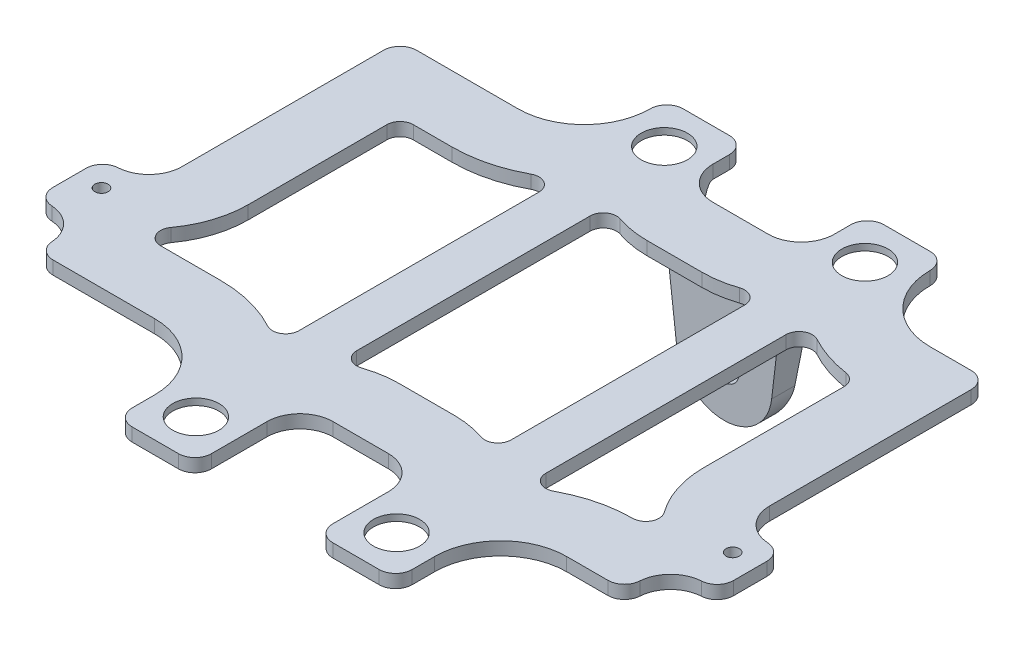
ISO-10303-21;
HEADER;
FILE_DESCRIPTION(('STEP AP214'),'2;1');
FILE_NAME('part.step','',(''),(''),'','','');
FILE_SCHEMA(('AUTOMOTIVE_DESIGN { 1 0 10303 214 1 1 1 1 }'));
ENDSEC;
DATA;
#1=APPLICATION_CONTEXT('core data for automotive mechanical design processes');
#2=APPLICATION_PROTOCOL_DEFINITION('international standard','automotive_design',2000,#1);
#3=PRODUCT_CONTEXT('',#1,'mechanical');
#4=PRODUCT('Part','Part','',(#3));
#5=PRODUCT_RELATED_PRODUCT_CATEGORY('part','',(#4));
#6=PRODUCT_DEFINITION_FORMATION('','',#4);
#7=PRODUCT_DEFINITION_CONTEXT('part definition',#1,'design');
#8=PRODUCT_DEFINITION('design','',#6,#7);
#9=PRODUCT_DEFINITION_SHAPE('','',#8);
#10=(LENGTH_UNIT() NAMED_UNIT(*) SI_UNIT(.MILLI.,.METRE.));
#11=(NAMED_UNIT(*) PLANE_ANGLE_UNIT() SI_UNIT($,.RADIAN.));
#12=(NAMED_UNIT(*) SI_UNIT($,.STERADIAN.) SOLID_ANGLE_UNIT());
#13=UNCERTAINTY_MEASURE_WITH_UNIT(LENGTH_MEASURE(1.E-05),#10,'distance_accuracy_value','');
#14=(GEOMETRIC_REPRESENTATION_CONTEXT(3) GLOBAL_UNCERTAINTY_ASSIGNED_CONTEXT((#13)) GLOBAL_UNIT_ASSIGNED_CONTEXT((#10,
#11,#12)) REPRESENTATION_CONTEXT('',''));
#15=CARTESIAN_POINT('',(0.,0.,0.));
#16=DIRECTION('',(0.,0.,1.));
#17=DIRECTION('',(1.,0.,0.));
#18=AXIS2_PLACEMENT_3D('',#15,#16,#17);
#19=CARTESIAN_POINT('',(46.99,-29.5285,-87.170200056));
#20=DIRECTION('',(0.,1.,0.));
#21=DIRECTION('',(0.,0.,1.));
#22=AXIS2_PLACEMENT_3D('',#19,#20,#21);
#23=CYLINDRICAL_SURFACE('',#22,4.445);
#24=CARTESIAN_POINT('',(46.99,2.54,-87.170200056));
#25=DIRECTION('',(0.,1.,0.));
#26=DIRECTION('',(0.,0.,1.));
#27=AXIS2_PLACEMENT_3D('',#24,#25,#26);
#28=CIRCLE('',#27,4.445);
#29=CARTESIAN_POINT('',(46.99,2.54,-82.725200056));
#30=VERTEX_POINT('',#29);
#31=EDGE_CURVE('E761',#30,#30,#28,.T.);
#32=ORIENTED_EDGE('',*,*,#31,.T.);
#33=EDGE_LOOP('',(#32));
#34=FACE_BOUND('',#33,.T.);
#35=CARTESIAN_POINT('',(46.99,1.27,-87.170200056));
#36=DIRECTION('',(0.,-1.,0.));
#37=DIRECTION('',(0.,0.,-1.));
#38=AXIS2_PLACEMENT_3D('',#35,#36,#37);
#39=CIRCLE('',#38,4.445);
#40=CARTESIAN_POINT('',(46.99,1.27,-91.615200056));
#41=VERTEX_POINT('',#40);
#42=EDGE_CURVE('E738',#41,#41,#39,.F.);
#43=ORIENTED_EDGE('',*,*,#42,.F.);
#44=EDGE_LOOP('',(#43));
#45=FACE_BOUND('',#44,.T.);
#46=ADVANCED_FACE('F45',(#34,#45),#23,.F.);
#47=CARTESIAN_POINT('',(85.5662499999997,-29.5285,2.870211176));
#48=DIRECTION('',(0.,1.,0.));
#49=DIRECTION('',(0.,0.,1.));
#50=AXIS2_PLACEMENT_3D('',#47,#48,#49);
#51=CYLINDRICAL_SURFACE('',#50,4.445);
#52=CARTESIAN_POINT('',(85.5662499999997,2.54,2.870211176));
#53=DIRECTION('',(0.,1.,0.));
#54=DIRECTION('',(0.,0.,1.));
#55=AXIS2_PLACEMENT_3D('',#52,#53,#54);
#56=CIRCLE('',#55,4.445);
#57=CARTESIAN_POINT('',(85.5662499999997,2.54,7.31521117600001));
#58=VERTEX_POINT('',#57);
#59=EDGE_CURVE('E758',#58,#58,#56,.T.);
#60=ORIENTED_EDGE('',*,*,#59,.T.);
#61=EDGE_LOOP('',(#60));
#62=FACE_BOUND('',#61,.T.);
#63=CARTESIAN_POINT('',(85.5662499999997,1.27,2.870211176));
#64=DIRECTION('',(0.,-1.,0.));
#65=DIRECTION('',(0.,0.,-1.));
#66=AXIS2_PLACEMENT_3D('',#63,#64,#65);
#67=CIRCLE('',#66,4.445);
#68=CARTESIAN_POINT('',(85.5662499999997,1.27,-1.574788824));
#69=VERTEX_POINT('',#68);
#70=EDGE_CURVE('E1206',#69,#69,#67,.F.);
#71=ORIENTED_EDGE('',*,*,#70,.F.);
#72=EDGE_LOOP('',(#71));
#73=FACE_BOUND('',#72,.T.);
#74=ADVANCED_FACE('F1460',(#62,#73),#51,.F.);
#75=CARTESIAN_POINT('',(46.99,-29.5285,2.870211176));
#76=DIRECTION('',(0.,1.,0.));
#77=DIRECTION('',(0.,0.,1.));
#78=AXIS2_PLACEMENT_3D('',#75,#76,#77);
#79=CYLINDRICAL_SURFACE('',#78,4.445);
#80=CARTESIAN_POINT('',(46.99,2.54,2.870211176));
#81=DIRECTION('',(0.,1.,0.));
#82=DIRECTION('',(0.,0.,-1.));
#83=AXIS2_PLACEMENT_3D('',#80,#81,#82);
#84=CIRCLE('',#83,4.445);
#85=CARTESIAN_POINT('',(46.99,2.54,-1.57478882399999));
#86=VERTEX_POINT('',#85);
#87=EDGE_CURVE('E762',#86,#86,#84,.T.);
#88=ORIENTED_EDGE('',*,*,#87,.T.);
#89=EDGE_LOOP('',(#88));
#90=FACE_BOUND('',#89,.T.);
#91=CARTESIAN_POINT('',(46.99,1.27,2.870211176));
#92=DIRECTION('',(0.,-1.,0.));
#93=DIRECTION('',(0.,0.,-1.));
#94=AXIS2_PLACEMENT_3D('',#91,#92,#93);
#95=CIRCLE('',#94,4.445);
#96=CARTESIAN_POINT('',(46.99,1.27,-1.57478882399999));
#97=VERTEX_POINT('',#96);
#98=EDGE_CURVE('E1203',#97,#97,#95,.F.);
#99=ORIENTED_EDGE('',*,*,#98,.F.);
#100=EDGE_LOOP('',(#99));
#101=FACE_BOUND('',#100,.T.);
#102=ADVANCED_FACE('F1466',(#90,#101),#79,.F.);
#103=CARTESIAN_POINT('',(85.5662499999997,-29.5285,-87.170200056));
#104=DIRECTION('',(0.,1.,0.));
#105=DIRECTION('',(0.,0.,1.));
#106=AXIS2_PLACEMENT_3D('',#103,#104,#105);
#107=CYLINDRICAL_SURFACE('',#106,4.445);
#108=CARTESIAN_POINT('',(85.5662499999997,2.54,-87.170200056));
#109=DIRECTION('',(0.,1.,0.));
#110=DIRECTION('',(0.,0.,-1.));
#111=AXIS2_PLACEMENT_3D('',#108,#109,#110);
#112=CIRCLE('',#111,4.445);
#113=CARTESIAN_POINT('',(85.5662499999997,2.54,-91.615200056));
#114=VERTEX_POINT('',#113);
#115=EDGE_CURVE('E757',#114,#114,#112,.T.);
#116=ORIENTED_EDGE('',*,*,#115,.T.);
#117=EDGE_LOOP('',(#116));
#118=FACE_BOUND('',#117,.T.);
#119=CARTESIAN_POINT('',(85.5662499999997,1.27,-87.170200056));
#120=DIRECTION('',(0.,-1.,0.));
#121=DIRECTION('',(0.,0.,-1.));
#122=AXIS2_PLACEMENT_3D('',#119,#120,#121);
#123=CIRCLE('',#122,4.445);
#124=CARTESIAN_POINT('',(85.5662499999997,1.27,-91.615200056));
#125=VERTEX_POINT('',#124);
#126=EDGE_CURVE('E725',#125,#125,#123,.F.);
#127=ORIENTED_EDGE('',*,*,#126,.F.);
#128=EDGE_LOOP('',(#127));
#129=FACE_BOUND('',#128,.T.);
#130=ADVANCED_FACE('F1472',(#118,#129),#107,.F.);
#131=CARTESIAN_POINT('',(116.957700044,-29.5275,-79.375));
#132=DIRECTION('',(-1.,0.,0.));
#133=DIRECTION('',(0.,0.,1.));
#134=AXIS2_PLACEMENT_3D('',#131,#132,#133);
#135=PLANE('',#134);
#136=DIRECTION('',(0.,0.,1.));
#137=VECTOR('',#136,1.);
#138=CARTESIAN_POINT('',(116.957700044,0.,0.));
#139=LINE('',#138,#137);
#140=CARTESIAN_POINT('',(116.957700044,0.,-76.2));
#141=VERTEX_POINT('',#140);
#142=CARTESIAN_POINT('',(116.957700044,0.,-37.465));
#143=VERTEX_POINT('',#142);
#144=EDGE_CURVE('E773',#141,#143,#139,.T.);
#145=ORIENTED_EDGE('',*,*,#144,.F.);
#146=DIRECTION('',(0.,-1.,0.));
#147=VECTOR('',#146,1.);
#148=CARTESIAN_POINT('',(116.957700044,-29.5275,-76.2));
#149=LINE('',#148,#147);
#150=CARTESIAN_POINT('',(116.957700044,2.54,-76.2));
#151=VERTEX_POINT('',#150);
#152=EDGE_CURVE('E1177',#141,#151,#149,.F.);
#153=ORIENTED_EDGE('',*,*,#152,.T.);
#154=DIRECTION('',(0.,0.,1.));
#155=VECTOR('',#154,1.);
#156=CARTESIAN_POINT('',(116.957700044,2.54,-79.375));
#157=LINE('',#156,#155);
#158=CARTESIAN_POINT('',(116.957700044,2.54,-37.465));
#159=VERTEX_POINT('',#158);
#160=EDGE_CURVE('E769',#151,#159,#157,.T.);
#161=ORIENTED_EDGE('',*,*,#160,.T.);
#162=DIRECTION('',(0.,1.,0.));
#163=VECTOR('',#162,1.);
#164=CARTESIAN_POINT('',(116.957700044,-29.5275,-37.465));
#165=LINE('',#164,#163);
#166=EDGE_CURVE('E898',#159,#143,#165,.F.);
#167=ORIENTED_EDGE('',*,*,#166,.T.);
#168=EDGE_LOOP('',(#145,#153,#161,#167));
#169=FACE_BOUND('',#168,.T.);
#170=ADVANCED_FACE('F1474',(#169),#135,.F.);
#171=CARTESIAN_POINT('',(3.99732499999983,0.,-9.52499999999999));
#172=DIRECTION('',(-1.,0.,0.));
#173=DIRECTION('',(0.,0.,1.));
#174=AXIS2_PLACEMENT_3D('',#171,#172,#173);
#175=PLANE('',#174);
#176=DIRECTION('',(0.,0.,1.));
#177=VECTOR('',#176,1.);
#178=CARTESIAN_POINT('',(3.99732499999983,2.54,-9.52499999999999));
#179=LINE('',#178,#177);
#180=CARTESIAN_POINT('',(3.99732499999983,2.54,-76.2));
#181=VERTEX_POINT('',#180);
#182=CARTESIAN_POINT('',(3.99732499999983,2.54,-37.465));
#183=VERTEX_POINT('',#182);
#184=EDGE_CURVE('E800',#181,#183,#179,.T.);
#185=ORIENTED_EDGE('',*,*,#184,.F.);
#186=DIRECTION('',(0.,1.,0.));
#187=VECTOR('',#186,1.);
#188=CARTESIAN_POINT('',(3.99732499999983,0.,-76.2));
#189=LINE('',#188,#187);
#190=CARTESIAN_POINT('',(3.99732499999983,0.,-76.2));
#191=VERTEX_POINT('',#190);
#192=EDGE_CURVE('E1156',#181,#191,#189,.F.);
#193=ORIENTED_EDGE('',*,*,#192,.T.);
#194=DIRECTION('',(0.,0.,1.));
#195=VECTOR('',#194,1.);
#196=CARTESIAN_POINT('',(3.99732499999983,0.,-9.52499999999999));
#197=LINE('',#196,#195);
#198=CARTESIAN_POINT('',(3.99732499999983,0.,-37.465));
#199=VERTEX_POINT('',#198);
#200=EDGE_CURVE('E801',#191,#199,#197,.T.);
#201=ORIENTED_EDGE('',*,*,#200,.T.);
#202=DIRECTION('',(0.,1.,0.));
#203=VECTOR('',#202,1.);
#204=CARTESIAN_POINT('',(3.99732499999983,2.54,-37.465));
#205=LINE('',#204,#203);
#206=EDGE_CURVE('E894',#199,#183,#205,.T.);
#207=ORIENTED_EDGE('',*,*,#206,.T.);
#208=EDGE_LOOP('',(#185,#193,#201,#207));
#209=FACE_BOUND('',#208,.T.);
#210=ADVANCED_FACE('F1477',(#209),#175,.T.);
#211=CARTESIAN_POINT('',(0.,2.54,0.));
#212=DIRECTION('',(0.,1.,0.));
#213=DIRECTION('',(0.,0.,1.));
#214=AXIS2_PLACEMENT_3D('',#211,#212,#213);
#215=PLANE('',#214);
#216=CARTESIAN_POINT('',(105.88625,2.54,-92.075));
#217=DIRECTION('',(0.,-1.,0.));
#218=DIRECTION('',(0.,0.,1.));
#219=AXIS2_PLACEMENT_3D('',#216,#217,#218);
#220=CIRCLE('',#219,25.4);
#221=CARTESIAN_POINT('',(102.096659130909,2.54,-66.9592877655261));
#222=VERTEX_POINT('',#221);
#223=CARTESIAN_POINT('',(93.7635227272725,2.54,-69.7546173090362));
#224=VERTEX_POINT('',#223);
#225=EDGE_CURVE('E670',#222,#224,#220,.T.);
#226=ORIENTED_EDGE('',*,*,#225,.F.);
#227=CARTESIAN_POINT('',(101.717700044,2.54,-64.4477165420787));
#228=DIRECTION('',(0.,1.,0.));
#229=DIRECTION('',(0.,0.,1.));
#230=AXIS2_PLACEMENT_3D('',#227,#228,#229);
#231=CIRCLE('',#230,2.54);
#232=CARTESIAN_POINT('',(104.257700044,2.54,-64.4477165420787));
#233=VERTEX_POINT('',#232);
#234=EDGE_CURVE('E637',#222,#233,#231,.F.);
#235=ORIENTED_EDGE('',*,*,#234,.T.);
#236=DIRECTION('',(0.,0.,-1.));
#237=VECTOR('',#236,1.);
#238=CARTESIAN_POINT('',(104.257700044,2.54,-37.465));
#239=LINE('',#238,#237);
#240=CARTESIAN_POINT('',(104.257700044,2.54,-37.465));
#241=VERTEX_POINT('',#240);
#242=EDGE_CURVE('E621',#241,#233,#239,.T.);
#243=ORIENTED_EDGE('',*,*,#242,.F.);
#244=CARTESIAN_POINT('',(123.307700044,2.54,-37.465));
#245=DIRECTION('',(0.,-1.,0.));
#246=DIRECTION('',(0.,0.,1.));
#247=AXIS2_PLACEMENT_3D('',#244,#245,#246);
#248=CIRCLE('',#247,19.05);
#249=CARTESIAN_POINT('',(107.902158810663,2.54,-26.2591176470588));
#250=VERTEX_POINT('',#249);
#251=EDGE_CURVE('E611',#250,#241,#248,.T.);
#252=ORIENTED_EDGE('',*,*,#251,.F.);
#253=CARTESIAN_POINT('',(105.848086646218,2.54,-24.765));
#254=DIRECTION('',(0.,1.,0.));
#255=DIRECTION('',(0.,0.,1.));
#256=AXIS2_PLACEMENT_3D('',#253,#254,#255);
#257=CIRCLE('',#256,2.54);
#258=CARTESIAN_POINT('',(107.902158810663,2.54,-23.2708823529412));
#259=VERTEX_POINT('',#258);
#260=EDGE_CURVE('E1342',#250,#259,#257,.F.);
#261=ORIENTED_EDGE('',*,*,#260,.T.);
#262=CARTESIAN_POINT('',(123.307700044,2.54,-12.065));
#263=DIRECTION('',(0.,-1.,0.));
#264=DIRECTION('',(0.,0.,1.));
#265=AXIS2_PLACEMENT_3D('',#262,#263,#264);
#266=CIRCLE('',#265,19.05);
#267=CARTESIAN_POINT('',(107.902142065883,2.54,-23.2708593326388));
#268=VERTEX_POINT('',#267);
#269=EDGE_CURVE('E622',#268,#259,#266,.T.);
#270=ORIENTED_EDGE('',*,*,#269,.F.);
#271=CARTESIAN_POINT('',(105.848067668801,2.54,-24.764973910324));
#272=DIRECTION('',(0.,1.,0.));
#273=DIRECTION('',(0.,0.,1.));
#274=AXIS2_PLACEMENT_3D('',#271,#272,#273);
#275=CIRCLE('',#274,2.54);
#276=CARTESIAN_POINT('',(105.851538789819,2.54,-22.2249762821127));
#277=VERTEX_POINT('',#276);
#278=EDGE_CURVE('E1336',#268,#277,#275,.F.);
#279=ORIENTED_EDGE('',*,*,#278,.T.);
#280=CARTESIAN_POINT('',(105.88625,2.54,3.175));
#281=DIRECTION('',(0.,-1.,0.));
#282=DIRECTION('',(0.,0.,1.));
#283=AXIS2_PLACEMENT_3D('',#280,#281,#282);
#284=CIRCLE('',#283,25.4);
#285=CARTESIAN_POINT('',(93.7635227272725,2.54,-19.1453826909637));
#286=VERTEX_POINT('',#285);
#287=EDGE_CURVE('E2732',#286,#277,#284,.T.);
#288=ORIENTED_EDGE('',*,*,#287,.F.);
#289=CARTESIAN_POINT('',(92.5512499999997,2.54,-21.3774209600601));
#290=DIRECTION('',(0.,1.,0.));
#291=DIRECTION('',(0.,0.,1.));
#292=AXIS2_PLACEMENT_3D('',#289,#290,#291);
#293=CIRCLE('',#292,2.54);
#294=CARTESIAN_POINT('',(90.0112499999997,2.54,-21.3774209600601));
#295=VERTEX_POINT('',#294);
#296=EDGE_CURVE('E1368',#286,#295,#293,.F.);
#297=ORIENTED_EDGE('',*,*,#296,.T.);
#298=DIRECTION('',(0.,0.,1.));
#299=VECTOR('',#298,1.);
#300=CARTESIAN_POINT('',(90.0112499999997,2.54,-72.2471313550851));
#301=LINE('',#300,#299);
#302=CARTESIAN_POINT('',(90.0112499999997,2.54,-67.5225790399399));
#303=VERTEX_POINT('',#302);
#304=EDGE_CURVE('E2729',#303,#295,#301,.T.);
#305=ORIENTED_EDGE('',*,*,#304,.F.);
#306=CARTESIAN_POINT('',(92.5512499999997,2.54,-67.5225790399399));
#307=DIRECTION('',(0.,1.,0.));
#308=DIRECTION('',(0.,0.,1.));
#309=AXIS2_PLACEMENT_3D('',#306,#307,#308);
#310=CIRCLE('',#309,2.54);
#311=EDGE_CURVE('E1356',#303,#224,#310,.F.);
#312=ORIENTED_EDGE('',*,*,#311,.T.);
#313=EDGE_LOOP('',(#226,#235,#243,#252,#261,#270,#279,#288,#297,#305,#312));
#314=FACE_BOUND('',#313,.T.);
#315=CARTESIAN_POINT('',(71.5962499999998,2.54,-88.9));
#316=DIRECTION('',(0.,-1.,0.));
#317=DIRECTION('',(0.,0.,1.));
#318=AXIS2_PLACEMENT_3D('',#315,#316,#317);
#319=CIRCLE('',#318,19.05);
#320=CARTESIAN_POINT('',(77.7594852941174,2.54,-70.8745449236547));
#321=VERTEX_POINT('',#320);
#322=CARTESIAN_POINT('',(71.5962499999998,2.54,-69.85));
#323=VERTEX_POINT('',#322);
#324=EDGE_CURVE('E644',#321,#323,#319,.T.);
#325=ORIENTED_EDGE('',*,*,#324,.F.);
#326=CARTESIAN_POINT('',(78.5812499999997,2.54,-68.4711509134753));
#327=DIRECTION('',(0.,1.,0.));
#328=DIRECTION('',(0.,0.,1.));
#329=AXIS2_PLACEMENT_3D('',#326,#327,#328);
#330=CIRCLE('',#329,2.54);
#331=CARTESIAN_POINT('',(81.1212499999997,2.54,-68.4711509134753));
#332=VERTEX_POINT('',#331);
#333=EDGE_CURVE('E1360',#321,#332,#330,.F.);
#334=ORIENTED_EDGE('',*,*,#333,.T.);
#335=DIRECTION('',(0.,0.,-1.));
#336=VECTOR('',#335,1.);
#337=CARTESIAN_POINT('',(81.1212499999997,2.54,-72.4022160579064));
#338=LINE('',#337,#336);
#339=CARTESIAN_POINT('',(81.1212499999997,2.54,-23.6038490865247));
#340=VERTEX_POINT('',#339);
#341=EDGE_CURVE('E664',#340,#332,#338,.T.);
#342=ORIENTED_EDGE('',*,*,#341,.F.);
#343=CARTESIAN_POINT('',(78.5812499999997,2.54,-23.6038490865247));
#344=DIRECTION('',(0.,1.,0.));
#345=DIRECTION('',(0.,0.,1.));
#346=AXIS2_PLACEMENT_3D('',#343,#344,#345);
#347=CIRCLE('',#346,2.54);
#348=CARTESIAN_POINT('',(77.7594852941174,2.54,-21.2004550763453));
#349=VERTEX_POINT('',#348);
#350=EDGE_CURVE('E1376',#340,#349,#347,.F.);
#351=ORIENTED_EDGE('',*,*,#350,.T.);
#352=CARTESIAN_POINT('',(71.5962499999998,2.54,-3.175));
#353=DIRECTION('',(0.,-1.,0.));
#354=DIRECTION('',(0.,0.,1.));
#355=AXIS2_PLACEMENT_3D('',#352,#353,#354);
#356=CIRCLE('',#355,19.05);
#357=CARTESIAN_POINT('',(71.5962499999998,2.54,-22.225));
#358=VERTEX_POINT('',#357);
#359=EDGE_CURVE('E661',#358,#349,#356,.T.);
#360=ORIENTED_EDGE('',*,*,#359,.F.);
#361=DIRECTION('',(1.,0.,0.));
#362=VECTOR('',#361,1.);
#363=CARTESIAN_POINT('',(60.96,2.54,-22.225));
#364=LINE('',#363,#362);
#365=CARTESIAN_POINT('',(60.96,2.54,-22.225));
#366=VERTEX_POINT('',#365);
#367=EDGE_CURVE('E658',#366,#358,#364,.T.);
#368=ORIENTED_EDGE('',*,*,#367,.F.);
#369=CARTESIAN_POINT('',(60.96,2.54,-3.175));
#370=DIRECTION('',(0.,-1.,0.));
#371=DIRECTION('',(0.,0.,1.));
#372=AXIS2_PLACEMENT_3D('',#369,#370,#371);
#373=CIRCLE('',#372,19.05);
#374=CARTESIAN_POINT('',(54.7967647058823,2.54,-21.2004550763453));
#375=VERTEX_POINT('',#374);
#376=EDGE_CURVE('E656',#375,#366,#373,.T.);
#377=ORIENTED_EDGE('',*,*,#376,.F.);
#378=CARTESIAN_POINT('',(53.975,2.54,-23.6038490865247));
#379=DIRECTION('',(0.,1.,0.));
#380=DIRECTION('',(0.,0.,1.));
#381=AXIS2_PLACEMENT_3D('',#378,#379,#380);
#382=CIRCLE('',#381,2.54);
#383=CARTESIAN_POINT('',(51.435,2.54,-23.6038490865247));
#384=VERTEX_POINT('',#383);
#385=EDGE_CURVE('E1372',#375,#384,#382,.F.);
#386=ORIENTED_EDGE('',*,*,#385,.T.);
#387=DIRECTION('',(0.,0.,1.));
#388=VECTOR('',#387,1.);
#389=CARTESIAN_POINT('',(51.435,2.54,-72.4022160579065));
#390=LINE('',#389,#388);
#391=CARTESIAN_POINT('',(51.435,2.54,-68.4711509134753));
#392=VERTEX_POINT('',#391);
#393=EDGE_CURVE('E653',#392,#384,#390,.T.);
#394=ORIENTED_EDGE('',*,*,#393,.F.);
#395=CARTESIAN_POINT('',(53.975,2.54,-68.4711509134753));
#396=DIRECTION('',(0.,1.,0.));
#397=DIRECTION('',(0.,0.,1.));
#398=AXIS2_PLACEMENT_3D('',#395,#396,#397);
#399=CIRCLE('',#398,2.54);
#400=CARTESIAN_POINT('',(54.7967647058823,2.54,-70.8745449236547));
#401=VERTEX_POINT('',#400);
#402=EDGE_CURVE('E1364',#392,#401,#399,.F.);
#403=ORIENTED_EDGE('',*,*,#402,.T.);
#404=CARTESIAN_POINT('',(60.9599999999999,2.54,-88.9));
#405=DIRECTION('',(0.,-1.,0.));
#406=DIRECTION('',(0.,0.,1.));
#407=AXIS2_PLACEMENT_3D('',#404,#405,#406);
#408=CIRCLE('',#407,19.05);
#409=CARTESIAN_POINT('',(60.9599999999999,2.54,-69.85));
#410=VERTEX_POINT('',#409);
#411=EDGE_CURVE('E650',#410,#401,#408,.T.);
#412=ORIENTED_EDGE('',*,*,#411,.F.);
#413=DIRECTION('',(-1.,0.,0.));
#414=VECTOR('',#413,1.);
#415=CARTESIAN_POINT('',(71.5962499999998,2.54,-69.85));
#416=LINE('',#415,#414);
#417=EDGE_CURVE('E646',#323,#410,#416,.T.);
#418=ORIENTED_EDGE('',*,*,#417,.F.);
#419=EDGE_LOOP('',(#325,#334,#342,#351,#360,#368,#377,#386,#394,#403,#412,#418));
#420=FACE_BOUND('',#419,.T.);
#421=CARTESIAN_POINT('',(26.67,2.54,-92.075));
#422=DIRECTION('',(0.,-1.,0.));
#423=DIRECTION('',(0.,0.,1.));
#424=AXIS2_PLACEMENT_3D('',#421,#422,#423);
#425=CIRCLE('',#424,25.4);
#426=CARTESIAN_POINT('',(38.7927272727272,2.54,-69.7546173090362));
#427=VERTEX_POINT('',#426);
#428=CARTESIAN_POINT('',(26.67,2.54,-66.675));
#429=VERTEX_POINT('',#428);
#430=EDGE_CURVE('E678',#427,#429,#425,.T.);
#431=ORIENTED_EDGE('',*,*,#430,.F.);
#432=CARTESIAN_POINT('',(40.005,2.54,-67.5225790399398));
#433=DIRECTION('',(0.,1.,0.));
#434=DIRECTION('',(0.,0.,1.));
#435=AXIS2_PLACEMENT_3D('',#432,#433,#434);
#436=CIRCLE('',#435,2.54);
#437=CARTESIAN_POINT('',(42.545,2.54,-67.5225790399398));
#438=VERTEX_POINT('',#437);
#439=EDGE_CURVE('E1387',#427,#438,#436,.F.);
#440=ORIENTED_EDGE('',*,*,#439,.T.);
#441=DIRECTION('',(0.,0.,-1.));
#442=VECTOR('',#441,1.);
#443=CARTESIAN_POINT('',(42.545,2.54,-72.247131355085));
#444=LINE('',#443,#442);
#445=CARTESIAN_POINT('',(42.545,2.54,-21.3774209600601));
#446=VERTEX_POINT('',#445);
#447=EDGE_CURVE('E693',#446,#438,#444,.T.);
#448=ORIENTED_EDGE('',*,*,#447,.F.);
#449=CARTESIAN_POINT('',(40.005,2.54,-21.3774209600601));
#450=DIRECTION('',(0.,1.,0.));
#451=DIRECTION('',(0.,0.,1.));
#452=AXIS2_PLACEMENT_3D('',#449,#450,#451);
#453=CIRCLE('',#452,2.54);
#454=CARTESIAN_POINT('',(38.7927272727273,2.54,-19.1453826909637));
#455=VERTEX_POINT('',#454);
#456=EDGE_CURVE('E1380',#446,#455,#453,.F.);
#457=ORIENTED_EDGE('',*,*,#456,.T.);
#458=CARTESIAN_POINT('',(26.67,2.54,3.17500000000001));
#459=DIRECTION('',(0.,-1.,0.));
#460=DIRECTION('',(0.,0.,1.));
#461=AXIS2_PLACEMENT_3D('',#458,#459,#460);
#462=CIRCLE('',#461,25.4);
#463=CARTESIAN_POINT('',(26.67,2.54,-22.225));
#464=VERTEX_POINT('',#463);
#465=EDGE_CURVE('E690',#464,#455,#462,.T.);
#466=ORIENTED_EDGE('',*,*,#465,.F.);
#467=DIRECTION('',(1.,0.,0.));
#468=VECTOR('',#467,1.);
#469=CARTESIAN_POINT('',(13.7618184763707,2.54,-22.225));
#470=LINE('',#469,#468);
#471=CARTESIAN_POINT('',(15.1069383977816,2.54,-22.225));
#472=VERTEX_POINT('',#471);
#473=EDGE_CURVE('E688',#472,#464,#470,.T.);
#474=ORIENTED_EDGE('',*,*,#473,.F.);
#475=CARTESIAN_POINT('',(15.1069383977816,2.54,-24.765));
#476=DIRECTION('',(0.,1.,0.));
#477=DIRECTION('',(0.,0.,1.));
#478=AXIS2_PLACEMENT_3D('',#475,#476,#477);
#479=CIRCLE('',#478,2.54);
#480=CARTESIAN_POINT('',(13.0528662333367,2.54,-23.2708823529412));
#481=VERTEX_POINT('',#480);
#482=EDGE_CURVE('E69',#472,#481,#479,.F.);
#483=ORIENTED_EDGE('',*,*,#482,.T.);
#484=CARTESIAN_POINT('',(15.1069383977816,2.54,-24.765));
#485=DIRECTION('',(0.,1.,0.));
#486=DIRECTION('',(0.,0.,1.));
#487=AXIS2_PLACEMENT_3D('',#484,#485,#486);
#488=CIRCLE('',#487,2.54);
#489=CARTESIAN_POINT('',(13.0528662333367,2.54,-26.2591176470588));
#490=VERTEX_POINT('',#489);
#491=EDGE_CURVE('E1384',#481,#490,#488,.F.);
#492=ORIENTED_EDGE('',*,*,#491,.T.);
#493=CARTESIAN_POINT('',(-2.35267500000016,2.54,-37.465));
#494=DIRECTION('',(0.,-1.,0.));
#495=DIRECTION('',(0.,0.,1.));
#496=AXIS2_PLACEMENT_3D('',#493,#494,#495);
#497=CIRCLE('',#496,19.05);
#498=CARTESIAN_POINT('',(16.6973249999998,2.54,-37.465));
#499=VERTEX_POINT('',#498);
#500=EDGE_CURVE('E685',#499,#490,#497,.T.);
#501=ORIENTED_EDGE('',*,*,#500,.F.);
#502=DIRECTION('',(0.,0.,1.));
#503=VECTOR('',#502,1.);
#504=CARTESIAN_POINT('',(16.6973249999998,2.54,-66.675));
#505=LINE('',#504,#503);
#506=CARTESIAN_POINT('',(16.6973249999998,2.54,-64.135));
#507=VERTEX_POINT('',#506);
#508=EDGE_CURVE('E683',#507,#499,#505,.T.);
#509=ORIENTED_EDGE('',*,*,#508,.F.);
#510=CARTESIAN_POINT('',(19.2373249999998,2.54,-64.135));
#511=DIRECTION('',(0.,1.,0.));
#512=DIRECTION('',(0.,0.,1.));
#513=AXIS2_PLACEMENT_3D('',#510,#511,#512);
#514=CIRCLE('',#513,2.54);
#515=CARTESIAN_POINT('',(19.2373249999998,2.54,-66.675));
#516=VERTEX_POINT('',#515);
#517=EDGE_CURVE('E54',#507,#516,#514,.F.);
#518=ORIENTED_EDGE('',*,*,#517,.T.);
#519=DIRECTION('',(-1.,0.,0.));
#520=VECTOR('',#519,1.);
#521=CARTESIAN_POINT('',(26.67,2.54,-66.675));
#522=LINE('',#521,#520);
#523=EDGE_CURVE('E680',#429,#516,#522,.T.);
#524=ORIENTED_EDGE('',*,*,#523,.F.);
#525=EDGE_LOOP('',(#431,#440,#448,#457,#466,#474,#483,#492,#501,#509,#518,#524));
#526=FACE_BOUND('',#525,.T.);
#527=ORIENTED_EDGE('',*,*,#115,.F.);
#528=EDGE_LOOP('',(#527));
#529=FACE_BOUND('',#528,.T.);
#530=ORIENTED_EDGE('',*,*,#87,.F.);
#531=EDGE_LOOP('',(#530));
#532=FACE_BOUND('',#531,.T.);
#533=ORIENTED_EDGE('',*,*,#59,.F.);
#534=EDGE_LOOP('',(#533));
#535=FACE_BOUND('',#534,.T.);
#536=ORIENTED_EDGE('',*,*,#31,.F.);
#537=EDGE_LOOP('',(#536));
#538=FACE_BOUND('',#537,.T.);
#539=DIRECTION('',(-1.,0.,0.));
#540=VECTOR('',#539,1.);
#541=CARTESIAN_POINT('',(119.85625,2.54,-9.525));
#542=LINE('',#541,#540);
#543=CARTESIAN_POINT('',(113.803890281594,2.54,-9.525));
#544=VERTEX_POINT('',#543);
#545=CARTESIAN_POINT('',(105.88625,2.54,-9.525));
#546=VERTEX_POINT('',#545);
#547=EDGE_CURVE('E863',#544,#546,#542,.T.);
#548=ORIENTED_EDGE('',*,*,#547,.F.);
#549=CARTESIAN_POINT('',(113.803890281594,2.54,-12.7));
#550=DIRECTION('',(0.,1.,0.));
#551=DIRECTION('',(0.,0.,1.));
#552=AXIS2_PLACEMENT_3D('',#549,#550,#551);
#553=CIRCLE('',#552,3.175);
#554=CARTESIAN_POINT('',(116.971826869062,2.54,-12.4883333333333));
#555=VERTEX_POINT('',#554);
#556=EDGE_CURVE('E1082',#544,#555,#553,.T.);
#557=ORIENTED_EDGE('',*,*,#556,.T.);
#558=CARTESIAN_POINT('',(123.307700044,2.54,-12.065));
#559=DIRECTION('',(0.,1.,0.));
#560=DIRECTION('',(0.,0.,1.));
#561=AXIS2_PLACEMENT_3D('',#558,#559,#560);
#562=CIRCLE('',#561,6.35);
#563=CARTESIAN_POINT('',(122.922316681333,2.54,-18.4032946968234));
#564=VERTEX_POINT('',#563);
#565=EDGE_CURVE('E937',#555,#564,#562,.F.);
#566=ORIENTED_EDGE('',*,*,#565,.T.);
#567=CARTESIAN_POINT('',(122.729625,2.54,-21.5724420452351));
#568=DIRECTION('',(0.,1.,0.));
#569=DIRECTION('',(0.,0.,1.));
#570=AXIS2_PLACEMENT_3D('',#567,#568,#569);
#571=CIRCLE('',#570,3.175);
#572=CARTESIAN_POINT('',(125.904625,2.54,-21.5724420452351));
#573=VERTEX_POINT('',#572);
#574=EDGE_CURVE('E1074',#564,#573,#571,.T.);
#575=ORIENTED_EDGE('',*,*,#574,.T.);
#576=DIRECTION('',(0.,0.,-1.));
#577=VECTOR('',#576,1.);
#578=CARTESIAN_POINT('',(125.904625,2.54,-31.115));
#579=LINE('',#578,#577);
#580=CARTESIAN_POINT('',(125.904625,2.54,-27.9575579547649));
#581=VERTEX_POINT('',#580);
#582=EDGE_CURVE('E733',#573,#581,#579,.T.);
#583=ORIENTED_EDGE('',*,*,#582,.T.);
#584=CARTESIAN_POINT('',(122.729625,2.54,-27.9575579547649));
#585=DIRECTION('',(0.,1.,0.));
#586=DIRECTION('',(0.,0.,1.));
#587=AXIS2_PLACEMENT_3D('',#584,#585,#586);
#588=CIRCLE('',#587,3.175);
#589=CARTESIAN_POINT('',(122.922316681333,2.54,-31.1267053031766));
#590=VERTEX_POINT('',#589);
#591=EDGE_CURVE('E1077',#581,#590,#588,.T.);
#592=ORIENTED_EDGE('',*,*,#591,.T.);
#593=CARTESIAN_POINT('',(123.307700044,2.54,-37.465));
#594=DIRECTION('',(0.,1.,0.));
#595=DIRECTION('',(0.,0.,1.));
#596=AXIS2_PLACEMENT_3D('',#593,#594,#595);
#597=CIRCLE('',#596,6.35);
#598=EDGE_CURVE('E945',#590,#159,#597,.F.);
#599=ORIENTED_EDGE('',*,*,#598,.T.);
#600=ORIENTED_EDGE('',*,*,#160,.F.);
#601=CARTESIAN_POINT('',(113.782700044,2.54,-76.2));
#602=DIRECTION('',(0.,1.,0.));
#603=DIRECTION('',(0.,0.,1.));
#604=AXIS2_PLACEMENT_3D('',#601,#602,#603);
#605=CIRCLE('',#604,3.175);
#606=CARTESIAN_POINT('',(113.782700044,2.54,-79.375));
#607=VERTEX_POINT('',#606);
#608=EDGE_CURVE('E1057',#151,#607,#605,.T.);
#609=ORIENTED_EDGE('',*,*,#608,.T.);
#610=DIRECTION('',(1.,0.,0.));
#611=VECTOR('',#610,1.);
#612=CARTESIAN_POINT('',(119.85625,2.54,-79.375));
#613=LINE('',#612,#611);
#614=CARTESIAN_POINT('',(105.88625,2.54,-79.375));
#615=VERTEX_POINT('',#614);
#616=EDGE_CURVE('E854',#615,#607,#613,.T.);
#617=ORIENTED_EDGE('',*,*,#616,.F.);
#618=CARTESIAN_POINT('',(105.88625,2.54,-92.075));
#619=DIRECTION('',(0.,1.,0.));
#620=DIRECTION('',(0.,0.,1.));
#621=AXIS2_PLACEMENT_3D('',#618,#619,#620);
#622=CIRCLE('',#621,12.7);
#623=CARTESIAN_POINT('',(93.1862499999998,2.54,-92.075));
#624=VERTEX_POINT('',#623);
#625=EDGE_CURVE('E1031',#615,#624,#622,.F.);
#626=ORIENTED_EDGE('',*,*,#625,.T.);
#627=CARTESIAN_POINT('',(90.0112499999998,2.54,-92.075));
#628=DIRECTION('',(0.,1.,0.));
#629=DIRECTION('',(0.,0.,1.));
#630=AXIS2_PLACEMENT_3D('',#627,#628,#629);
#631=CIRCLE('',#630,3.175);
#632=CARTESIAN_POINT('',(90.0112499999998,2.54,-95.25));
#633=VERTEX_POINT('',#632);
#634=EDGE_CURVE('E1062',#624,#633,#631,.T.);
#635=ORIENTED_EDGE('',*,*,#634,.T.);
#636=DIRECTION('',(-1.,0.,0.));
#637=VECTOR('',#636,1.);
#638=CARTESIAN_POINT('',(77.9462499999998,2.54,-95.25));
#639=LINE('',#638,#637);
#640=CARTESIAN_POINT('',(81.1212499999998,2.54,-95.25));
#641=VERTEX_POINT('',#640);
#642=EDGE_CURVE('E780',#633,#641,#639,.T.);
#643=ORIENTED_EDGE('',*,*,#642,.T.);
#644=CARTESIAN_POINT('',(81.1212499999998,2.54,-92.075));
#645=DIRECTION('',(0.,1.,0.));
#646=DIRECTION('',(0.,0.,1.));
#647=AXIS2_PLACEMENT_3D('',#644,#645,#646);
#648=CIRCLE('',#647,3.175);
#649=CARTESIAN_POINT('',(77.9462499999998,2.54,-92.075));
#650=VERTEX_POINT('',#649);
#651=EDGE_CURVE('E1060',#641,#650,#648,.T.);
#652=ORIENTED_EDGE('',*,*,#651,.T.);
#653=DIRECTION('',(0.,0.,-1.));
#654=VECTOR('',#653,1.);
#655=CARTESIAN_POINT('',(77.9462499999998,2.54,-88.9));
#656=LINE('',#655,#654);
#657=CARTESIAN_POINT('',(77.9462499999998,2.54,-88.9));
#658=VERTEX_POINT('',#657);
#659=EDGE_CURVE('E840',#658,#650,#656,.T.);
#660=ORIENTED_EDGE('',*,*,#659,.F.);
#661=CARTESIAN_POINT('',(71.5962499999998,2.54,-88.9));
#662=DIRECTION('',(0.,1.,0.));
#663=DIRECTION('',(0.,0.,1.));
#664=AXIS2_PLACEMENT_3D('',#661,#662,#663);
#665=CIRCLE('',#664,6.35);
#666=CARTESIAN_POINT('',(71.5962499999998,2.54,-82.55));
#667=VERTEX_POINT('',#666);
#668=EDGE_CURVE('E1535',#658,#667,#665,.F.);
#669=ORIENTED_EDGE('',*,*,#668,.T.);
#670=DIRECTION('',(1.,0.,0.));
#671=VECTOR('',#670,1.);
#672=CARTESIAN_POINT('',(54.6099999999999,2.54,-82.55));
#673=LINE('',#672,#671);
#674=CARTESIAN_POINT('',(60.96,2.54,-82.55));
#675=VERTEX_POINT('',#674);
#676=EDGE_CURVE('E815',#675,#667,#673,.T.);
#677=ORIENTED_EDGE('',*,*,#676,.F.);
#678=CARTESIAN_POINT('',(60.9599999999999,2.54,-88.9));
#679=DIRECTION('',(0.,1.,0.));
#680=DIRECTION('',(0.,0.,1.));
#681=AXIS2_PLACEMENT_3D('',#678,#679,#680);
#682=CIRCLE('',#681,6.35);
#683=CARTESIAN_POINT('',(54.6099999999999,2.54,-88.9));
#684=VERTEX_POINT('',#683);
#685=EDGE_CURVE('E2649',#675,#684,#682,.F.);
#686=ORIENTED_EDGE('',*,*,#685,.T.);
#687=DIRECTION('',(0.,0.,1.));
#688=VECTOR('',#687,1.);
#689=CARTESIAN_POINT('',(54.6099999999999,2.54,-88.9));
#690=LINE('',#689,#688);
#691=CARTESIAN_POINT('',(54.6099999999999,2.54,-92.075));
#692=VERTEX_POINT('',#691);
#693=EDGE_CURVE('E836',#692,#684,#690,.T.);
#694=ORIENTED_EDGE('',*,*,#693,.F.);
#695=CARTESIAN_POINT('',(51.4349999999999,2.54,-92.075));
#696=DIRECTION('',(0.,1.,0.));
#697=DIRECTION('',(0.,0.,1.));
#698=AXIS2_PLACEMENT_3D('',#695,#696,#697);
#699=CIRCLE('',#698,3.175);
#700=CARTESIAN_POINT('',(51.4349999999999,2.54,-95.25));
#701=VERTEX_POINT('',#700);
#702=EDGE_CURVE('E1064',#692,#701,#699,.T.);
#703=ORIENTED_EDGE('',*,*,#702,.T.);
#704=DIRECTION('',(-1.,0.,0.));
#705=VECTOR('',#704,1.);
#706=CARTESIAN_POINT('',(39.37,2.54,-95.25));
#707=LINE('',#706,#705);
#708=CARTESIAN_POINT('',(42.545,2.54,-95.25));
#709=VERTEX_POINT('',#708);
#710=EDGE_CURVE('E776',#701,#709,#707,.T.);
#711=ORIENTED_EDGE('',*,*,#710,.T.);
#712=CARTESIAN_POINT('',(42.545,2.54,-92.075));
#713=DIRECTION('',(0.,1.,0.));
#714=DIRECTION('',(0.,0.,1.));
#715=AXIS2_PLACEMENT_3D('',#712,#713,#714);
#716=CIRCLE('',#715,3.175);
#717=CARTESIAN_POINT('',(39.37,2.54,-92.0749999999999));
#718=VERTEX_POINT('',#717);
#719=EDGE_CURVE('E1066',#709,#718,#716,.T.);
#720=ORIENTED_EDGE('',*,*,#719,.T.);
#721=CARTESIAN_POINT('',(26.67,2.54,-92.075));
#722=DIRECTION('',(0.,1.,0.));
#723=DIRECTION('',(0.,0.,1.));
#724=AXIS2_PLACEMENT_3D('',#721,#722,#723);
#725=CIRCLE('',#724,12.7);
#726=CARTESIAN_POINT('',(26.67,2.54,-79.375));
#727=VERTEX_POINT('',#726);
#728=EDGE_CURVE('E1026',#718,#727,#725,.F.);
#729=ORIENTED_EDGE('',*,*,#728,.T.);
#730=DIRECTION('',(1.,0.,0.));
#731=VECTOR('',#730,1.);
#732=CARTESIAN_POINT('',(6.77544999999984,2.54,-79.375));
#733=LINE('',#732,#731);
#734=CARTESIAN_POINT('',(7.17232499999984,2.54,-79.375));
#735=VERTEX_POINT('',#734);
#736=EDGE_CURVE('E853',#735,#727,#733,.T.);
#737=ORIENTED_EDGE('',*,*,#736,.F.);
#738=CARTESIAN_POINT('',(7.17232499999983,2.54,-76.2));
#739=DIRECTION('',(0.,1.,0.));
#740=DIRECTION('',(0.,0.,1.));
#741=AXIS2_PLACEMENT_3D('',#738,#739,#740);
#742=CIRCLE('',#741,3.175);
#743=EDGE_CURVE('E1068',#735,#181,#742,.T.);
#744=ORIENTED_EDGE('',*,*,#743,.T.);
#745=ORIENTED_EDGE('',*,*,#184,.T.);
#746=CARTESIAN_POINT('',(-2.35267500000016,2.54,-37.465));
#747=DIRECTION('',(0.,1.,0.));
#748=DIRECTION('',(0.,0.,1.));
#749=AXIS2_PLACEMENT_3D('',#746,#747,#748);
#750=CIRCLE('',#749,6.35);
#751=CARTESIAN_POINT('',(-1.9672916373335,2.54,-31.1267053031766));
#752=VERTEX_POINT('',#751);
#753=EDGE_CURVE('E925',#183,#752,#750,.F.);
#754=ORIENTED_EDGE('',*,*,#753,.T.);
#755=CARTESIAN_POINT('',(-1.77459995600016,2.54,-27.9575579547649));
#756=DIRECTION('',(0.,1.,0.));
#757=DIRECTION('',(0.,0.,1.));
#758=AXIS2_PLACEMENT_3D('',#755,#756,#757);
#759=CIRCLE('',#758,3.175);
#760=CARTESIAN_POINT('',(-4.94959995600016,2.54,-27.9575579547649));
#761=VERTEX_POINT('',#760);
#762=EDGE_CURVE('E1072',#752,#761,#759,.T.);
#763=ORIENTED_EDGE('',*,*,#762,.T.);
#764=DIRECTION('',(0.,0.,1.));
#765=VECTOR('',#764,1.);
#766=CARTESIAN_POINT('',(-4.94959995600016,2.54,-31.115));
#767=LINE('',#766,#765);
#768=CARTESIAN_POINT('',(-4.94959995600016,2.54,-21.5724420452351));
#769=VERTEX_POINT('',#768);
#770=EDGE_CURVE('E750',#761,#769,#767,.T.);
#771=ORIENTED_EDGE('',*,*,#770,.T.);
#772=CARTESIAN_POINT('',(-1.77459995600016,2.54,-21.5724420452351));
#773=DIRECTION('',(0.,1.,0.));
#774=DIRECTION('',(0.,0.,1.));
#775=AXIS2_PLACEMENT_3D('',#772,#773,#774);
#776=CIRCLE('',#775,3.175);
#777=CARTESIAN_POINT('',(-1.9672916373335,2.54,-18.4032946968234));
#778=VERTEX_POINT('',#777);
#779=EDGE_CURVE('E1070',#769,#778,#776,.T.);
#780=ORIENTED_EDGE('',*,*,#779,.T.);
#781=CARTESIAN_POINT('',(-2.35267500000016,2.54,-12.065));
#782=DIRECTION('',(0.,1.,0.));
#783=DIRECTION('',(0.,0.,1.));
#784=AXIS2_PLACEMENT_3D('',#781,#782,#783);
#785=CIRCLE('',#784,6.35);
#786=CARTESIAN_POINT('',(3.98319817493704,2.54,-12.4883333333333));
#787=VERTEX_POINT('',#786);
#788=EDGE_CURVE('E931',#778,#787,#785,.F.);
#789=ORIENTED_EDGE('',*,*,#788,.T.);
#790=CARTESIAN_POINT('',(7.15113476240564,2.54,-12.7));
#791=DIRECTION('',(0.,1.,0.));
#792=DIRECTION('',(0.,0.,1.));
#793=AXIS2_PLACEMENT_3D('',#790,#791,#792);
#794=CIRCLE('',#793,3.175);
#795=CARTESIAN_POINT('',(7.15113476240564,2.54,-9.52499999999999));
#796=VERTEX_POINT('',#795);
#797=EDGE_CURVE('E1080',#787,#796,#794,.T.);
#798=ORIENTED_EDGE('',*,*,#797,.T.);
#799=DIRECTION('',(-1.,0.,0.));
#800=VECTOR('',#799,1.);
#801=CARTESIAN_POINT('',(39.37,2.54,-9.52499999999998));
#802=LINE('',#801,#800);
#803=CARTESIAN_POINT('',(26.67,2.54,-9.52499999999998));
#804=VERTEX_POINT('',#803);
#805=EDGE_CURVE('E870',#804,#796,#802,.T.);
#806=ORIENTED_EDGE('',*,*,#805,.F.);
#807=CARTESIAN_POINT('',(26.67,2.54,3.17500000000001));
#808=DIRECTION('',(0.,1.,0.));
#809=DIRECTION('',(0.,0.,1.));
#810=AXIS2_PLACEMENT_3D('',#807,#808,#809);
#811=CIRCLE('',#810,12.7);
#812=CARTESIAN_POINT('',(39.37,2.54,3.17500000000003));
#813=VERTEX_POINT('',#812);
#814=EDGE_CURVE('E1041',#804,#813,#811,.F.);
#815=ORIENTED_EDGE('',*,*,#814,.T.);
#816=DIRECTION('',(0.,0.,-1.));
#817=VECTOR('',#816,1.);
#818=CARTESIAN_POINT('',(39.37,2.54,0.));
#819=LINE('',#818,#817);
#820=CARTESIAN_POINT('',(39.37,2.54,7.490400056));
#821=VERTEX_POINT('',#820);
#822=EDGE_CURVE('E873',#821,#813,#819,.T.);
#823=ORIENTED_EDGE('',*,*,#822,.F.);
#824=CARTESIAN_POINT('',(42.545,2.54,7.49040005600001));
#825=DIRECTION('',(0.,1.,0.));
#826=DIRECTION('',(0.,0.,1.));
#827=AXIS2_PLACEMENT_3D('',#824,#825,#826);
#828=CIRCLE('',#827,3.175);
#829=CARTESIAN_POINT('',(42.545,2.54,10.665400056));
#830=VERTEX_POINT('',#829);
#831=EDGE_CURVE('E1049',#821,#830,#828,.T.);
#832=ORIENTED_EDGE('',*,*,#831,.T.);
#833=DIRECTION('',(1.,0.,0.));
#834=VECTOR('',#833,1.);
#835=CARTESIAN_POINT('',(39.37,2.54,10.665400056));
#836=LINE('',#835,#834);
#837=CARTESIAN_POINT('',(51.435,2.54,10.665400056));
#838=VERTEX_POINT('',#837);
#839=EDGE_CURVE('E794',#830,#838,#836,.T.);
#840=ORIENTED_EDGE('',*,*,#839,.T.);
#841=CARTESIAN_POINT('',(51.435,2.54,7.49040005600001));
#842=DIRECTION('',(0.,1.,0.));
#843=DIRECTION('',(0.,0.,1.));
#844=AXIS2_PLACEMENT_3D('',#841,#842,#843);
#845=CIRCLE('',#844,3.175);
#846=CARTESIAN_POINT('',(54.61,2.54,7.49040005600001));
#847=VERTEX_POINT('',#846);
#848=EDGE_CURVE('E1051',#838,#847,#845,.T.);
#849=ORIENTED_EDGE('',*,*,#848,.T.);
#850=DIRECTION('',(0.,0.,1.));
#851=VECTOR('',#850,1.);
#852=CARTESIAN_POINT('',(54.61,2.54,-9.525));
#853=LINE('',#852,#851);
#854=CARTESIAN_POINT('',(54.61,2.54,-3.175));
#855=VERTEX_POINT('',#854);
#856=EDGE_CURVE('E881',#855,#847,#853,.T.);
#857=ORIENTED_EDGE('',*,*,#856,.F.);
#858=CARTESIAN_POINT('',(60.96,2.54,-3.175));
#859=DIRECTION('',(0.,1.,0.));
#860=DIRECTION('',(0.,0.,1.));
#861=AXIS2_PLACEMENT_3D('',#858,#859,#860);
#862=CIRCLE('',#861,6.35);
#863=CARTESIAN_POINT('',(60.96,2.54,-9.525));
#864=VERTEX_POINT('',#863);
#865=EDGE_CURVE('E991',#855,#864,#862,.F.);
#866=ORIENTED_EDGE('',*,*,#865,.T.);
#867=DIRECTION('',(-1.,0.,0.));
#868=VECTOR('',#867,1.);
#869=CARTESIAN_POINT('',(77.9462499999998,2.54,-9.525));
#870=LINE('',#869,#868);
#871=CARTESIAN_POINT('',(71.5962499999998,2.54,-9.525));
#872=VERTEX_POINT('',#871);
#873=EDGE_CURVE('E887',#872,#864,#870,.T.);
#874=ORIENTED_EDGE('',*,*,#873,.F.);
#875=CARTESIAN_POINT('',(71.5962499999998,2.54,-3.175));
#876=DIRECTION('',(0.,1.,0.));
#877=DIRECTION('',(0.,0.,1.));
#878=AXIS2_PLACEMENT_3D('',#875,#876,#877);
#879=CIRCLE('',#878,6.35);
#880=CARTESIAN_POINT('',(77.9462499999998,2.54,-3.175));
#881=VERTEX_POINT('',#880);
#882=EDGE_CURVE('E997',#872,#881,#879,.F.);
#883=ORIENTED_EDGE('',*,*,#882,.T.);
#884=DIRECTION('',(0.,0.,-1.));
#885=VECTOR('',#884,1.);
#886=CARTESIAN_POINT('',(77.9462499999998,2.54,-9.525));
#887=LINE('',#886,#885);
#888=CARTESIAN_POINT('',(77.9462499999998,2.54,7.490400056));
#889=VERTEX_POINT('',#888);
#890=EDGE_CURVE('E845',#889,#881,#887,.T.);
#891=ORIENTED_EDGE('',*,*,#890,.F.);
#892=CARTESIAN_POINT('',(81.1212499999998,2.54,7.490400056));
#893=DIRECTION('',(0.,1.,0.));
#894=DIRECTION('',(0.,0.,1.));
#895=AXIS2_PLACEMENT_3D('',#892,#893,#894);
#896=CIRCLE('',#895,3.175);
#897=CARTESIAN_POINT('',(81.1212499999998,2.54,10.665400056));
#898=VERTEX_POINT('',#897);
#899=EDGE_CURVE('E1053',#889,#898,#896,.T.);
#900=ORIENTED_EDGE('',*,*,#899,.T.);
#901=DIRECTION('',(1.,0.,0.));
#902=VECTOR('',#901,1.);
#903=CARTESIAN_POINT('',(77.9462499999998,2.54,10.665400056));
#904=LINE('',#903,#902);
#905=CARTESIAN_POINT('',(90.0112499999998,2.54,10.665400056));
#906=VERTEX_POINT('',#905);
#907=EDGE_CURVE('E786',#898,#906,#904,.T.);
#908=ORIENTED_EDGE('',*,*,#907,.T.);
#909=CARTESIAN_POINT('',(90.0112499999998,2.54,7.490400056));
#910=DIRECTION('',(0.,1.,0.));
#911=DIRECTION('',(0.,0.,1.));
#912=AXIS2_PLACEMENT_3D('',#909,#910,#911);
#913=CIRCLE('',#912,3.175);
#914=CARTESIAN_POINT('',(93.1862499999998,2.54,7.490400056));
#915=VERTEX_POINT('',#914);
#916=EDGE_CURVE('E1055',#906,#915,#913,.T.);
#917=ORIENTED_EDGE('',*,*,#916,.T.);
#918=DIRECTION('',(0.,0.,1.));
#919=VECTOR('',#918,1.);
#920=CARTESIAN_POINT('',(93.1862499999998,2.54,0.));
#921=LINE('',#920,#919);
#922=CARTESIAN_POINT('',(93.1862499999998,2.54,3.17500000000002));
#923=VERTEX_POINT('',#922);
#924=EDGE_CURVE('E860',#923,#915,#921,.T.);
#925=ORIENTED_EDGE('',*,*,#924,.F.);
#926=CARTESIAN_POINT('',(105.88625,2.54,3.175));
#927=DIRECTION('',(0.,1.,0.));
#928=DIRECTION('',(0.,0.,1.));
#929=AXIS2_PLACEMENT_3D('',#926,#927,#928);
#930=CIRCLE('',#929,12.7);
#931=EDGE_CURVE('E1036',#923,#546,#930,.F.);
#932=ORIENTED_EDGE('',*,*,#931,.T.);
#933=EDGE_LOOP('',(#548,#557,#566,#575,#583,#592,#599,#600,#609,#617,#626,#635,#643,#652,#660,
#669,#677,#686,#694,#703,#711,#720,#729,#737,#744,#745,#754,#763,#771,#780,#789,#798,#806,#815,
#823,#832,#840,#849,#857,#866,#874,#883,#891,#900,#908,#917,#925,#932));
#934=FACE_BOUND('',#933,.T.);
#935=CARTESIAN_POINT('',(-0.187110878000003,2.54,-26.162));
#936=DIRECTION('',(0.,1.,0.));
#937=DIRECTION('',(0.,0.,1.));
#938=AXIS2_PLACEMENT_3D('',#935,#936,#937);
#939=CIRCLE('',#938,1.27);
#940=CARTESIAN_POINT('',(-0.187110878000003,2.54,-24.892));
#941=VERTEX_POINT('',#940);
#942=EDGE_CURVE('E745',#941,#941,#939,.T.);
#943=ORIENTED_EDGE('',*,*,#942,.F.);
#944=EDGE_LOOP('',(#943));
#945=FACE_BOUND('',#944,.T.);
#946=CARTESIAN_POINT('',(121.142114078,2.54,-26.162));
#947=DIRECTION('',(0.,1.,0.));
#948=DIRECTION('',(0.,0.,1.));
#949=AXIS2_PLACEMENT_3D('',#946,#947,#948);
#950=CIRCLE('',#949,1.26999999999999);
#951=CARTESIAN_POINT('',(121.142114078,2.54,-24.892));
#952=VERTEX_POINT('',#951);
#953=EDGE_CURVE('E734',#952,#952,#950,.T.);
#954=ORIENTED_EDGE('',*,*,#953,.F.);
#955=EDGE_LOOP('',(#954));
#956=FACE_BOUND('',#955,.T.);
#957=ADVANCED_FACE('F635',(#314,#420,#526,#529,#532,#535,#538,#934,#945,#956),#215,.T.);
#958=CARTESIAN_POINT('',(0.,0.,0.));
#959=DIRECTION('',(0.,1.,0.));
#960=DIRECTION('',(0.,0.,1.));
#961=AXIS2_PLACEMENT_3D('',#958,#959,#960);
#962=PLANE('',#961);
#963=DIRECTION('',(0.,0.,-1.));
#964=VECTOR('',#963,1.);
#965=CARTESIAN_POINT('',(104.257700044,0.,0.));
#966=LINE('',#965,#964);
#967=CARTESIAN_POINT('',(104.257700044,0.,-37.465));
#968=VERTEX_POINT('',#967);
#969=CARTESIAN_POINT('',(104.257700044,0.,-64.4477165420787));
#970=VERTEX_POINT('',#969);
#971=EDGE_CURVE('E630',#968,#970,#966,.T.);
#972=ORIENTED_EDGE('',*,*,#971,.T.);
#973=CARTESIAN_POINT('',(101.717700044,0.,-64.4477165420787));
#974=DIRECTION('',(0.,1.,0.));
#975=DIRECTION('',(0.,0.,1.));
#976=AXIS2_PLACEMENT_3D('',#973,#974,#975);
#977=CIRCLE('',#976,2.54);
#978=CARTESIAN_POINT('',(102.096659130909,0.,-66.9592877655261));
#979=VERTEX_POINT('',#978);
#980=EDGE_CURVE('E1353',#970,#979,#977,.T.);
#981=ORIENTED_EDGE('',*,*,#980,.T.);
#982=CARTESIAN_POINT('',(105.88625,0.,-92.075));
#983=DIRECTION('',(0.,1.,0.));
#984=DIRECTION('',(0.,0.,1.));
#985=AXIS2_PLACEMENT_3D('',#982,#983,#984);
#986=CIRCLE('',#985,25.4);
#987=CARTESIAN_POINT('',(93.7635227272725,0.,-69.7546173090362));
#988=VERTEX_POINT('',#987);
#989=EDGE_CURVE('E1263',#979,#988,#986,.F.);
#990=ORIENTED_EDGE('',*,*,#989,.T.);
#991=CARTESIAN_POINT('',(92.5512499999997,0.,-67.5225790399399));
#992=DIRECTION('',(0.,1.,0.));
#993=DIRECTION('',(0.,0.,1.));
#994=AXIS2_PLACEMENT_3D('',#991,#992,#993);
#995=CIRCLE('',#994,2.54);
#996=CARTESIAN_POINT('',(90.0112499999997,0.,-67.5225790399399));
#997=VERTEX_POINT('',#996);
#998=EDGE_CURVE('E1358',#988,#997,#995,.T.);
#999=ORIENTED_EDGE('',*,*,#998,.T.);
#1000=DIRECTION('',(0.,0.,1.));
#1001=VECTOR('',#1000,1.);
#1002=CARTESIAN_POINT('',(90.0112499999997,0.,0.));
#1003=LINE('',#1002,#1001);
#1004=CARTESIAN_POINT('',(90.0112499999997,0.,-21.3774209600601));
#1005=VERTEX_POINT('',#1004);
#1006=EDGE_CURVE('E1249',#997,#1005,#1003,.T.);
#1007=ORIENTED_EDGE('',*,*,#1006,.T.);
#1008=CARTESIAN_POINT('',(92.5512499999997,0.,-21.3774209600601));
#1009=DIRECTION('',(0.,1.,0.));
#1010=DIRECTION('',(0.,0.,1.));
#1011=AXIS2_PLACEMENT_3D('',#1008,#1009,#1010);
#1012=CIRCLE('',#1011,2.54);
#1013=CARTESIAN_POINT('',(93.7635227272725,0.,-19.1453826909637));
#1014=VERTEX_POINT('',#1013);
#1015=EDGE_CURVE('E1370',#1005,#1014,#1012,.T.);
#1016=ORIENTED_EDGE('',*,*,#1015,.T.);
#1017=CARTESIAN_POINT('',(105.88625,0.,3.175));
#1018=DIRECTION('',(0.,1.,0.));
#1019=DIRECTION('',(0.,0.,1.));
#1020=AXIS2_PLACEMENT_3D('',#1017,#1018,#1019);
#1021=CIRCLE('',#1020,25.4);
#1022=CARTESIAN_POINT('',(105.851538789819,0.,-22.2249762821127));
#1023=VERTEX_POINT('',#1022);
#1024=EDGE_CURVE('E1252',#1014,#1023,#1021,.F.);
#1025=ORIENTED_EDGE('',*,*,#1024,.T.);
#1026=CARTESIAN_POINT('',(105.848067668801,0.,-24.764973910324));
#1027=DIRECTION('',(0.,1.,0.));
#1028=DIRECTION('',(0.,0.,1.));
#1029=AXIS2_PLACEMENT_3D('',#1026,#1027,#1028);
#1030=CIRCLE('',#1029,2.54);
#1031=CARTESIAN_POINT('',(107.902142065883,0.,-23.2708593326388));
#1032=VERTEX_POINT('',#1031);
#1033=EDGE_CURVE('E1339',#1023,#1032,#1030,.T.);
#1034=ORIENTED_EDGE('',*,*,#1033,.T.);
#1035=CARTESIAN_POINT('',(123.307700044,0.,-12.065));
#1036=DIRECTION('',(0.,1.,0.));
#1037=DIRECTION('',(0.,0.,1.));
#1038=AXIS2_PLACEMENT_3D('',#1035,#1036,#1037);
#1039=CIRCLE('',#1038,19.05);
#1040=CARTESIAN_POINT('',(107.902158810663,0.,-23.2708823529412));
#1041=VERTEX_POINT('',#1040);
#1042=EDGE_CURVE('E1256',#1032,#1041,#1039,.F.);
#1043=ORIENTED_EDGE('',*,*,#1042,.T.);
#1044=CARTESIAN_POINT('',(105.848086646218,0.,-24.765));
#1045=DIRECTION('',(0.,1.,0.));
#1046=DIRECTION('',(0.,0.,1.));
#1047=AXIS2_PLACEMENT_3D('',#1044,#1045,#1046);
#1048=CIRCLE('',#1047,2.54);
#1049=CARTESIAN_POINT('',(107.902158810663,0.,-26.2591176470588));
#1050=VERTEX_POINT('',#1049);
#1051=EDGE_CURVE('E1345',#1041,#1050,#1048,.T.);
#1052=ORIENTED_EDGE('',*,*,#1051,.T.);
#1053=CARTESIAN_POINT('',(123.307700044,0.,-37.465));
#1054=DIRECTION('',(0.,1.,0.));
#1055=DIRECTION('',(0.,0.,1.));
#1056=AXIS2_PLACEMENT_3D('',#1053,#1054,#1055);
#1057=CIRCLE('',#1056,19.05);
#1058=EDGE_CURVE('E1260',#1050,#968,#1057,.F.);
#1059=ORIENTED_EDGE('',*,*,#1058,.T.);
#1060=EDGE_LOOP('',(#972,#981,#990,#999,#1007,#1016,#1025,#1034,#1043,#1052,#1059));
#1061=FACE_BOUND('',#1060,.T.);
#1062=CARTESIAN_POINT('',(71.5962499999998,0.,-3.175));
#1063=DIRECTION('',(0.,1.,0.));
#1064=DIRECTION('',(0.,0.,1.));
#1065=AXIS2_PLACEMENT_3D('',#1062,#1063,#1064);
#1066=CIRCLE('',#1065,19.05);
#1067=CARTESIAN_POINT('',(71.5962499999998,0.,-22.225));
#1068=VERTEX_POINT('',#1067);
#1069=CARTESIAN_POINT('',(77.7594852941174,0.,-21.2004550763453));
#1070=VERTEX_POINT('',#1069);
#1071=EDGE_CURVE('E1241',#1068,#1070,#1066,.F.);
#1072=ORIENTED_EDGE('',*,*,#1071,.T.);
#1073=CARTESIAN_POINT('',(78.5812499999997,0.,-23.6038490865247));
#1074=DIRECTION('',(0.,1.,0.));
#1075=DIRECTION('',(0.,0.,1.));
#1076=AXIS2_PLACEMENT_3D('',#1073,#1074,#1075);
#1077=CIRCLE('',#1076,2.54);
#1078=CARTESIAN_POINT('',(81.1212499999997,0.,-23.6038490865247));
#1079=VERTEX_POINT('',#1078);
#1080=EDGE_CURVE('E1378',#1070,#1079,#1077,.T.);
#1081=ORIENTED_EDGE('',*,*,#1080,.T.);
#1082=DIRECTION('',(0.,0.,-1.));
#1083=VECTOR('',#1082,1.);
#1084=CARTESIAN_POINT('',(81.1212499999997,0.,0.));
#1085=LINE('',#1084,#1083);
#1086=CARTESIAN_POINT('',(81.1212499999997,0.,-68.4711509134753));
#1087=VERTEX_POINT('',#1086);
#1088=EDGE_CURVE('E1244',#1079,#1087,#1085,.T.);
#1089=ORIENTED_EDGE('',*,*,#1088,.T.);
#1090=CARTESIAN_POINT('',(78.5812499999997,0.,-68.4711509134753));
#1091=DIRECTION('',(0.,1.,0.));
#1092=DIRECTION('',(0.,0.,1.));
#1093=AXIS2_PLACEMENT_3D('',#1090,#1091,#1092);
#1094=CIRCLE('',#1093,2.54);
#1095=CARTESIAN_POINT('',(77.7594852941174,0.,-70.8745449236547));
#1096=VERTEX_POINT('',#1095);
#1097=EDGE_CURVE('E1362',#1087,#1096,#1094,.T.);
#1098=ORIENTED_EDGE('',*,*,#1097,.T.);
#1099=CARTESIAN_POINT('',(71.5962499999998,0.,-88.9));
#1100=DIRECTION('',(0.,1.,0.));
#1101=DIRECTION('',(0.,0.,1.));
#1102=AXIS2_PLACEMENT_3D('',#1099,#1100,#1101);
#1103=CIRCLE('',#1102,19.05);
#1104=CARTESIAN_POINT('',(71.5962499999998,0.,-69.85));
#1105=VERTEX_POINT('',#1104);
#1106=EDGE_CURVE('E1247',#1096,#1105,#1103,.F.);
#1107=ORIENTED_EDGE('',*,*,#1106,.T.);
#1108=DIRECTION('',(-1.,0.,0.));
#1109=VECTOR('',#1108,1.);
#1110=CARTESIAN_POINT('',(0.,0.,-69.85));
#1111=LINE('',#1110,#1109);
#1112=CARTESIAN_POINT('',(60.9599999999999,0.,-69.85));
#1113=VERTEX_POINT('',#1112);
#1114=EDGE_CURVE('E1227',#1105,#1113,#1111,.T.);
#1115=ORIENTED_EDGE('',*,*,#1114,.T.);
#1116=CARTESIAN_POINT('',(60.9599999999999,0.,-88.9));
#1117=DIRECTION('',(0.,1.,0.));
#1118=DIRECTION('',(0.,0.,1.));
#1119=AXIS2_PLACEMENT_3D('',#1116,#1117,#1118);
#1120=CIRCLE('',#1119,19.05);
#1121=CARTESIAN_POINT('',(54.7967647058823,0.,-70.8745449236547));
#1122=VERTEX_POINT('',#1121);
#1123=EDGE_CURVE('E1230',#1113,#1122,#1120,.F.);
#1124=ORIENTED_EDGE('',*,*,#1123,.T.);
#1125=CARTESIAN_POINT('',(53.975,0.,-68.4711509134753));
#1126=DIRECTION('',(0.,1.,0.));
#1127=DIRECTION('',(0.,0.,1.));
#1128=AXIS2_PLACEMENT_3D('',#1125,#1126,#1127);
#1129=CIRCLE('',#1128,2.54);
#1130=CARTESIAN_POINT('',(51.435,0.,-68.4711509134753));
#1131=VERTEX_POINT('',#1130);
#1132=EDGE_CURVE('E1366',#1122,#1131,#1129,.T.);
#1133=ORIENTED_EDGE('',*,*,#1132,.T.);
#1134=DIRECTION('',(0.,0.,1.));
#1135=VECTOR('',#1134,1.);
#1136=CARTESIAN_POINT('',(51.435,0.,0.));
#1137=LINE('',#1136,#1135);
#1138=CARTESIAN_POINT('',(51.435,0.,-23.6038490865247));
#1139=VERTEX_POINT('',#1138);
#1140=EDGE_CURVE('E1233',#1131,#1139,#1137,.T.);
#1141=ORIENTED_EDGE('',*,*,#1140,.T.);
#1142=CARTESIAN_POINT('',(53.975,0.,-23.6038490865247));
#1143=DIRECTION('',(0.,1.,0.));
#1144=DIRECTION('',(0.,0.,1.));
#1145=AXIS2_PLACEMENT_3D('',#1142,#1143,#1144);
#1146=CIRCLE('',#1145,2.54);
#1147=CARTESIAN_POINT('',(54.7967647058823,0.,-21.2004550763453));
#1148=VERTEX_POINT('',#1147);
#1149=EDGE_CURVE('E1374',#1139,#1148,#1146,.T.);
#1150=ORIENTED_EDGE('',*,*,#1149,.T.);
#1151=CARTESIAN_POINT('',(60.96,0.,-3.175));
#1152=DIRECTION('',(0.,1.,0.));
#1153=DIRECTION('',(0.,0.,1.));
#1154=AXIS2_PLACEMENT_3D('',#1151,#1152,#1153);
#1155=CIRCLE('',#1154,19.05);
#1156=CARTESIAN_POINT('',(60.96,0.,-22.225));
#1157=VERTEX_POINT('',#1156);
#1158=EDGE_CURVE('E1236',#1148,#1157,#1155,.F.);
#1159=ORIENTED_EDGE('',*,*,#1158,.T.);
#1160=DIRECTION('',(1.,0.,0.));
#1161=VECTOR('',#1160,1.);
#1162=CARTESIAN_POINT('',(0.,0.,-22.225));
#1163=LINE('',#1162,#1161);
#1164=EDGE_CURVE('E1238',#1157,#1068,#1163,.T.);
#1165=ORIENTED_EDGE('',*,*,#1164,.T.);
#1166=EDGE_LOOP('',(#1072,#1081,#1089,#1098,#1107,#1115,#1124,#1133,#1141,#1150,#1159,#1165));
#1167=FACE_BOUND('',#1166,.T.);
#1168=CARTESIAN_POINT('',(26.67,0.,3.17500000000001));
#1169=DIRECTION('',(0.,1.,0.));
#1170=DIRECTION('',(0.,0.,1.));
#1171=AXIS2_PLACEMENT_3D('',#1168,#1169,#1170);
#1172=CIRCLE('',#1171,25.4);
#1173=CARTESIAN_POINT('',(26.67,0.,-22.225));
#1174=VERTEX_POINT('',#1173);
#1175=CARTESIAN_POINT('',(38.7927272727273,0.,-19.1453826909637));
#1176=VERTEX_POINT('',#1175);
#1177=EDGE_CURVE('E1219',#1174,#1176,#1172,.F.);
#1178=ORIENTED_EDGE('',*,*,#1177,.T.);
#1179=CARTESIAN_POINT('',(40.005,0.,-21.3774209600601));
#1180=DIRECTION('',(0.,1.,0.));
#1181=DIRECTION('',(0.,0.,1.));
#1182=AXIS2_PLACEMENT_3D('',#1179,#1180,#1181);
#1183=CIRCLE('',#1182,2.54);
#1184=CARTESIAN_POINT('',(42.545,0.,-21.3774209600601));
#1185=VERTEX_POINT('',#1184);
#1186=EDGE_CURVE('E1382',#1176,#1185,#1183,.T.);
#1187=ORIENTED_EDGE('',*,*,#1186,.T.);
#1188=DIRECTION('',(0.,0.,-1.));
#1189=VECTOR('',#1188,1.);
#1190=CARTESIAN_POINT('',(42.545,0.,0.));
#1191=LINE('',#1190,#1189);
#1192=CARTESIAN_POINT('',(42.545,0.,-67.5225790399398));
#1193=VERTEX_POINT('',#1192);
#1194=EDGE_CURVE('E1222',#1185,#1193,#1191,.T.);
#1195=ORIENTED_EDGE('',*,*,#1194,.T.);
#1196=CARTESIAN_POINT('',(40.005,0.,-67.5225790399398));
#1197=DIRECTION('',(0.,1.,0.));
#1198=DIRECTION('',(0.,0.,1.));
#1199=AXIS2_PLACEMENT_3D('',#1196,#1197,#1198);
#1200=CIRCLE('',#1199,2.54);
#1201=CARTESIAN_POINT('',(38.7927272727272,0.,-69.7546173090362));
#1202=VERTEX_POINT('',#1201);
#1203=EDGE_CURVE('E1389',#1193,#1202,#1200,.T.);
#1204=ORIENTED_EDGE('',*,*,#1203,.T.);
#1205=CARTESIAN_POINT('',(26.67,0.,-92.075));
#1206=DIRECTION('',(0.,1.,0.));
#1207=DIRECTION('',(0.,0.,1.));
#1208=AXIS2_PLACEMENT_3D('',#1205,#1206,#1207);
#1209=CIRCLE('',#1208,25.4);
#1210=CARTESIAN_POINT('',(26.67,0.,-66.675));
#1211=VERTEX_POINT('',#1210);
#1212=EDGE_CURVE('E1225',#1202,#1211,#1209,.F.);
#1213=ORIENTED_EDGE('',*,*,#1212,.T.);
#1214=DIRECTION('',(-1.,0.,0.));
#1215=VECTOR('',#1214,1.);
#1216=CARTESIAN_POINT('',(0.,0.,-66.675));
#1217=LINE('',#1216,#1215);
#1218=CARTESIAN_POINT('',(19.2373249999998,0.,-66.675));
#1219=VERTEX_POINT('',#1218);
#1220=EDGE_CURVE('E1200',#1211,#1219,#1217,.T.);
#1221=ORIENTED_EDGE('',*,*,#1220,.T.);
#1222=CARTESIAN_POINT('',(19.2373249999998,0.,-64.135));
#1223=DIRECTION('',(0.,1.,0.));
#1224=DIRECTION('',(0.,0.,1.));
#1225=AXIS2_PLACEMENT_3D('',#1222,#1223,#1224);
#1226=CIRCLE('',#1225,2.54);
#1227=CARTESIAN_POINT('',(16.6973249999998,0.,-64.135));
#1228=VERTEX_POINT('',#1227);
#1229=EDGE_CURVE('E11',#1219,#1228,#1226,.T.);
#1230=ORIENTED_EDGE('',*,*,#1229,.T.);
#1231=DIRECTION('',(0.,0.,1.));
#1232=VECTOR('',#1231,1.);
#1233=CARTESIAN_POINT('',(16.6973249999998,0.,0.));
#1234=LINE('',#1233,#1232);
#1235=CARTESIAN_POINT('',(16.6973249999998,0.,-37.465));
#1236=VERTEX_POINT('',#1235);
#1237=EDGE_CURVE('E1213',#1228,#1236,#1234,.T.);
#1238=ORIENTED_EDGE('',*,*,#1237,.T.);
#1239=CARTESIAN_POINT('',(-2.35267500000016,0.,-37.465));
#1240=DIRECTION('',(0.,1.,0.));
#1241=DIRECTION('',(0.,0.,1.));
#1242=AXIS2_PLACEMENT_3D('',#1239,#1240,#1241);
#1243=CIRCLE('',#1242,19.05);
#1244=CARTESIAN_POINT('',(13.0528662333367,0.,-26.2591176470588));
#1245=VERTEX_POINT('',#1244);
#1246=EDGE_CURVE('E1215',#1236,#1245,#1243,.F.);
#1247=ORIENTED_EDGE('',*,*,#1246,.T.);
#1248=CARTESIAN_POINT('',(15.1069383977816,0.,-24.765));
#1249=DIRECTION('',(0.,1.,0.));
#1250=DIRECTION('',(0.,0.,1.));
#1251=AXIS2_PLACEMENT_3D('',#1248,#1249,#1250);
#1252=CIRCLE('',#1251,2.54);
#1253=CARTESIAN_POINT('',(13.0528662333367,0.,-23.2708823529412));
#1254=VERTEX_POINT('',#1253);
#1255=EDGE_CURVE('E61',#1245,#1254,#1252,.T.);
#1256=ORIENTED_EDGE('',*,*,#1255,.T.);
#1257=CARTESIAN_POINT('',(15.1069383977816,0.,-24.765));
#1258=DIRECTION('',(0.,1.,0.));
#1259=DIRECTION('',(0.,0.,1.));
#1260=AXIS2_PLACEMENT_3D('',#1257,#1258,#1259);
#1261=CIRCLE('',#1260,2.54);
#1262=CARTESIAN_POINT('',(15.1069383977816,0.,-22.225));
#1263=VERTEX_POINT('',#1262);
#1264=EDGE_CURVE('E1349',#1254,#1263,#1261,.T.);
#1265=ORIENTED_EDGE('',*,*,#1264,.T.);
#1266=DIRECTION('',(1.,0.,0.));
#1267=VECTOR('',#1266,1.);
#1268=CARTESIAN_POINT('',(0.,0.,-22.225));
#1269=LINE('',#1268,#1267);
#1270=EDGE_CURVE('E1217',#1263,#1174,#1269,.T.);
#1271=ORIENTED_EDGE('',*,*,#1270,.T.);
#1272=EDGE_LOOP('',(#1178,#1187,#1195,#1204,#1213,#1221,#1230,#1238,#1247,#1256,#1265,#1271));
#1273=FACE_BOUND('',#1272,.T.);
#1274=CARTESIAN_POINT('',(46.99,0.,-87.170200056));
#1275=DIRECTION('',(0.,-1.,0.));
#1276=DIRECTION('',(0.,0.,-1.));
#1277=AXIS2_PLACEMENT_3D('',#1274,#1275,#1276);
#1278=CIRCLE('',#1277,7.493);
#1279=CARTESIAN_POINT('',(46.99,0.,-94.663200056));
#1280=VERTEX_POINT('',#1279);
#1281=EDGE_CURVE('E632',#1280,#1280,#1278,.T.);
#1282=ORIENTED_EDGE('',*,*,#1281,.F.);
#1283=EDGE_LOOP('',(#1282));
#1284=FACE_BOUND('',#1283,.T.);
#1285=CARTESIAN_POINT('',(85.5662499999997,0.,-87.170200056));
#1286=DIRECTION('',(0.,-1.,0.));
#1287=DIRECTION('',(0.,0.,-1.));
#1288=AXIS2_PLACEMENT_3D('',#1285,#1286,#1287);
#1289=CIRCLE('',#1288,7.493);
#1290=CARTESIAN_POINT('',(85.5662499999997,0.,-94.663200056));
#1291=VERTEX_POINT('',#1290);
#1292=EDGE_CURVE('E714',#1291,#1291,#1289,.T.);
#1293=ORIENTED_EDGE('',*,*,#1292,.F.);
#1294=EDGE_LOOP('',(#1293));
#1295=FACE_BOUND('',#1294,.T.);
#1296=CARTESIAN_POINT('',(85.5662499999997,0.,2.870211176));
#1297=DIRECTION('',(0.,-1.,0.));
#1298=DIRECTION('',(0.,0.,-1.));
#1299=AXIS2_PLACEMENT_3D('',#1296,#1297,#1298);
#1300=CIRCLE('',#1299,7.493);
#1301=CARTESIAN_POINT('',(85.5662499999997,0.,-4.622788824));
#1302=VERTEX_POINT('',#1301);
#1303=EDGE_CURVE('E708',#1302,#1302,#1300,.T.);
#1304=ORIENTED_EDGE('',*,*,#1303,.F.);
#1305=EDGE_LOOP('',(#1304));
#1306=FACE_BOUND('',#1305,.T.);
#1307=CARTESIAN_POINT('',(46.99,0.,2.870211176));
#1308=DIRECTION('',(0.,-1.,0.));
#1309=DIRECTION('',(0.,0.,-1.));
#1310=AXIS2_PLACEMENT_3D('',#1307,#1308,#1309);
#1311=CIRCLE('',#1310,7.493);
#1312=CARTESIAN_POINT('',(46.99,0.,-4.622788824));
#1313=VERTEX_POINT('',#1312);
#1314=EDGE_CURVE('E707',#1313,#1313,#1311,.T.);
#1315=ORIENTED_EDGE('',*,*,#1314,.F.);
#1316=EDGE_LOOP('',(#1315));
#1317=FACE_BOUND('',#1316,.T.);
#1318=CARTESIAN_POINT('',(123.307700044,0.,-12.065));
#1319=DIRECTION('',(0.,1.,0.));
#1320=DIRECTION('',(0.,0.,1.));
#1321=AXIS2_PLACEMENT_3D('',#1318,#1319,#1320);
#1322=CIRCLE('',#1321,6.35);
#1323=CARTESIAN_POINT('',(122.922316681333,0.,-18.4032946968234));
#1324=VERTEX_POINT('',#1323);
#1325=CARTESIAN_POINT('',(116.971826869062,0.,-12.4883333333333));
#1326=VERTEX_POINT('',#1325);
#1327=EDGE_CURVE('E941',#1324,#1326,#1322,.T.);
#1328=ORIENTED_EDGE('',*,*,#1327,.T.);
#1329=CARTESIAN_POINT('',(113.803890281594,0.,-12.7));
#1330=DIRECTION('',(0.,1.,0.));
#1331=DIRECTION('',(0.,0.,1.));
#1332=AXIS2_PLACEMENT_3D('',#1329,#1330,#1331);
#1333=CIRCLE('',#1332,3.175);
#1334=CARTESIAN_POINT('',(113.803890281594,0.,-9.525));
#1335=VERTEX_POINT('',#1334);
#1336=EDGE_CURVE('E1125',#1326,#1335,#1333,.F.);
#1337=ORIENTED_EDGE('',*,*,#1336,.T.);
#1338=DIRECTION('',(-1.,0.,0.));
#1339=VECTOR('',#1338,1.);
#1340=CARTESIAN_POINT('',(119.85625,0.,-9.525));
#1341=LINE('',#1340,#1339);
#1342=CARTESIAN_POINT('',(105.88625,0.,-9.525));
#1343=VERTEX_POINT('',#1342);
#1344=EDGE_CURVE('E858',#1335,#1343,#1341,.T.);
#1345=ORIENTED_EDGE('',*,*,#1344,.T.);
#1346=CARTESIAN_POINT('',(105.88625,0.,3.175));
#1347=DIRECTION('',(0.,1.,0.));
#1348=DIRECTION('',(0.,0.,1.));
#1349=AXIS2_PLACEMENT_3D('',#1346,#1347,#1348);
#1350=CIRCLE('',#1349,12.7);
#1351=CARTESIAN_POINT('',(93.1862499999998,0.,3.17500000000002));
#1352=VERTEX_POINT('',#1351);
#1353=EDGE_CURVE('E1039',#1343,#1352,#1350,.T.);
#1354=ORIENTED_EDGE('',*,*,#1353,.T.);
#1355=DIRECTION('',(0.,0.,1.));
#1356=VECTOR('',#1355,1.);
#1357=CARTESIAN_POINT('',(93.1862499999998,0.,0.));
#1358=LINE('',#1357,#1356);
#1359=CARTESIAN_POINT('',(93.1862499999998,0.,7.490400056));
#1360=VERTEX_POINT('',#1359);
#1361=EDGE_CURVE('E857',#1352,#1360,#1358,.T.);
#1362=ORIENTED_EDGE('',*,*,#1361,.T.);
#1363=CARTESIAN_POINT('',(90.0112499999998,0.,7.490400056));
#1364=DIRECTION('',(0.,1.,0.));
#1365=DIRECTION('',(0.,0.,1.));
#1366=AXIS2_PLACEMENT_3D('',#1363,#1364,#1365);
#1367=CIRCLE('',#1366,3.175);
#1368=CARTESIAN_POINT('',(90.0112499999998,0.,10.665400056));
#1369=VERTEX_POINT('',#1368);
#1370=EDGE_CURVE('E1098',#1360,#1369,#1367,.F.);
#1371=ORIENTED_EDGE('',*,*,#1370,.T.);
#1372=DIRECTION('',(-1.,0.,0.));
#1373=VECTOR('',#1372,1.);
#1374=CARTESIAN_POINT('',(77.9462499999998,0.,10.665400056));
#1375=LINE('',#1374,#1373);
#1376=CARTESIAN_POINT('',(81.1212499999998,0.,10.665400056));
#1377=VERTEX_POINT('',#1376);
#1378=EDGE_CURVE('E791',#1369,#1377,#1375,.T.);
#1379=ORIENTED_EDGE('',*,*,#1378,.T.);
#1380=CARTESIAN_POINT('',(81.1212499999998,0.,7.490400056));
#1381=DIRECTION('',(0.,1.,0.));
#1382=DIRECTION('',(0.,0.,1.));
#1383=AXIS2_PLACEMENT_3D('',#1380,#1381,#1382);
#1384=CIRCLE('',#1383,3.175);
#1385=CARTESIAN_POINT('',(77.9462499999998,0.,7.490400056));
#1386=VERTEX_POINT('',#1385);
#1387=EDGE_CURVE('E1096',#1377,#1386,#1384,.F.);
#1388=ORIENTED_EDGE('',*,*,#1387,.T.);
#1389=DIRECTION('',(0.,0.,-1.));
#1390=VECTOR('',#1389,1.);
#1391=CARTESIAN_POINT('',(77.9462499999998,0.,-9.525));
#1392=LINE('',#1391,#1390);
#1393=CARTESIAN_POINT('',(77.9462499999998,0.,-3.175));
#1394=VERTEX_POINT('',#1393);
#1395=EDGE_CURVE('E878',#1386,#1394,#1392,.T.);
#1396=ORIENTED_EDGE('',*,*,#1395,.T.);
#1397=CARTESIAN_POINT('',(71.5962499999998,0.,-3.175));
#1398=DIRECTION('',(0.,1.,0.));
#1399=DIRECTION('',(0.,0.,1.));
#1400=AXIS2_PLACEMENT_3D('',#1397,#1398,#1399);
#1401=CIRCLE('',#1400,6.35);
#1402=CARTESIAN_POINT('',(71.5962499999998,0.,-9.525));
#1403=VERTEX_POINT('',#1402);
#1404=EDGE_CURVE('E1000',#1394,#1403,#1401,.T.);
#1405=ORIENTED_EDGE('',*,*,#1404,.T.);
#1406=DIRECTION('',(-1.,0.,0.));
#1407=VECTOR('',#1406,1.);
#1408=CARTESIAN_POINT('',(77.9462499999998,0.,-9.525));
#1409=LINE('',#1408,#1407);
#1410=CARTESIAN_POINT('',(60.96,0.,-9.525));
#1411=VERTEX_POINT('',#1410);
#1412=EDGE_CURVE('E880',#1403,#1411,#1409,.T.);
#1413=ORIENTED_EDGE('',*,*,#1412,.T.);
#1414=CARTESIAN_POINT('',(60.96,0.,-3.175));
#1415=DIRECTION('',(0.,1.,0.));
#1416=DIRECTION('',(0.,0.,1.));
#1417=AXIS2_PLACEMENT_3D('',#1414,#1415,#1416);
#1418=CIRCLE('',#1417,6.35);
#1419=CARTESIAN_POINT('',(54.61,0.,-3.175));
#1420=VERTEX_POINT('',#1419);
#1421=EDGE_CURVE('E995',#1411,#1420,#1418,.T.);
#1422=ORIENTED_EDGE('',*,*,#1421,.T.);
#1423=DIRECTION('',(0.,0.,1.));
#1424=VECTOR('',#1423,1.);
#1425=CARTESIAN_POINT('',(54.61,0.,-9.525));
#1426=LINE('',#1425,#1424);
#1427=CARTESIAN_POINT('',(54.61,0.,7.49040005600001));
#1428=VERTEX_POINT('',#1427);
#1429=EDGE_CURVE('E875',#1420,#1428,#1426,.T.);
#1430=ORIENTED_EDGE('',*,*,#1429,.T.);
#1431=CARTESIAN_POINT('',(51.435,0.,7.49040005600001));
#1432=DIRECTION('',(0.,1.,0.));
#1433=DIRECTION('',(0.,0.,1.));
#1434=AXIS2_PLACEMENT_3D('',#1431,#1432,#1433);
#1435=CIRCLE('',#1434,3.175);
#1436=CARTESIAN_POINT('',(51.435,0.,10.665400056));
#1437=VERTEX_POINT('',#1436);
#1438=EDGE_CURVE('E1094',#1428,#1437,#1435,.F.);
#1439=ORIENTED_EDGE('',*,*,#1438,.T.);
#1440=DIRECTION('',(-1.,0.,0.));
#1441=VECTOR('',#1440,1.);
#1442=CARTESIAN_POINT('',(39.37,0.,10.665400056));
#1443=LINE('',#1442,#1441);
#1444=CARTESIAN_POINT('',(42.545,0.,10.665400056));
#1445=VERTEX_POINT('',#1444);
#1446=EDGE_CURVE('E797',#1437,#1445,#1443,.T.);
#1447=ORIENTED_EDGE('',*,*,#1446,.T.);
#1448=CARTESIAN_POINT('',(42.545,0.,7.49040005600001));
#1449=DIRECTION('',(0.,1.,0.));
#1450=DIRECTION('',(0.,0.,1.));
#1451=AXIS2_PLACEMENT_3D('',#1448,#1449,#1450);
#1452=CIRCLE('',#1451,3.175);
#1453=CARTESIAN_POINT('',(39.37,0.,7.490400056));
#1454=VERTEX_POINT('',#1453);
#1455=EDGE_CURVE('E1092',#1445,#1454,#1452,.F.);
#1456=ORIENTED_EDGE('',*,*,#1455,.T.);
#1457=DIRECTION('',(0.,0.,-1.));
#1458=VECTOR('',#1457,1.);
#1459=CARTESIAN_POINT('',(39.37,0.,0.));
#1460=LINE('',#1459,#1458);
#1461=CARTESIAN_POINT('',(39.37,0.,3.17500000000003));
#1462=VERTEX_POINT('',#1461);
#1463=EDGE_CURVE('E868',#1454,#1462,#1460,.T.);
#1464=ORIENTED_EDGE('',*,*,#1463,.T.);
#1465=CARTESIAN_POINT('',(26.67,0.,3.17500000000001));
#1466=DIRECTION('',(0.,1.,0.));
#1467=DIRECTION('',(0.,0.,1.));
#1468=AXIS2_PLACEMENT_3D('',#1465,#1466,#1467);
#1469=CIRCLE('',#1468,12.7);
#1470=CARTESIAN_POINT('',(26.67,0.,-9.52499999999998));
#1471=VERTEX_POINT('',#1470);
#1472=EDGE_CURVE('E1044',#1462,#1471,#1469,.T.);
#1473=ORIENTED_EDGE('',*,*,#1472,.T.);
#1474=DIRECTION('',(-1.,0.,0.));
#1475=VECTOR('',#1474,1.);
#1476=CARTESIAN_POINT('',(39.37,0.,-9.52499999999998));
#1477=LINE('',#1476,#1475);
#1478=CARTESIAN_POINT('',(7.15113476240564,0.,-9.52499999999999));
#1479=VERTEX_POINT('',#1478);
#1480=EDGE_CURVE('E865',#1471,#1479,#1477,.T.);
#1481=ORIENTED_EDGE('',*,*,#1480,.T.);
#1482=CARTESIAN_POINT('',(7.15113476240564,0.,-12.7));
#1483=DIRECTION('',(0.,1.,0.));
#1484=DIRECTION('',(0.,0.,1.));
#1485=AXIS2_PLACEMENT_3D('',#1482,#1483,#1484);
#1486=CIRCLE('',#1485,3.175);
#1487=CARTESIAN_POINT('',(3.98319817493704,0.,-12.4883333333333));
#1488=VERTEX_POINT('',#1487);
#1489=EDGE_CURVE('E1123',#1479,#1488,#1486,.F.);
#1490=ORIENTED_EDGE('',*,*,#1489,.T.);
#1491=CARTESIAN_POINT('',(-2.35267500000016,0.,-12.065));
#1492=DIRECTION('',(0.,1.,0.));
#1493=DIRECTION('',(0.,0.,1.));
#1494=AXIS2_PLACEMENT_3D('',#1491,#1492,#1493);
#1495=CIRCLE('',#1494,6.35);
#1496=CARTESIAN_POINT('',(-1.9672916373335,0.,-18.4032946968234));
#1497=VERTEX_POINT('',#1496);
#1498=EDGE_CURVE('E934',#1488,#1497,#1495,.T.);
#1499=ORIENTED_EDGE('',*,*,#1498,.T.);
#1500=CARTESIAN_POINT('',(-1.77459995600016,0.,-21.5724420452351));
#1501=DIRECTION('',(0.,1.,0.));
#1502=DIRECTION('',(0.,0.,1.));
#1503=AXIS2_PLACEMENT_3D('',#1500,#1501,#1502);
#1504=CIRCLE('',#1503,3.175);
#1505=CARTESIAN_POINT('',(-4.94959995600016,0.,-21.5724420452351));
#1506=VERTEX_POINT('',#1505);
#1507=EDGE_CURVE('E1113',#1497,#1506,#1504,.F.);
#1508=ORIENTED_EDGE('',*,*,#1507,.T.);
#1509=DIRECTION('',(0.,0.,-1.));
#1510=VECTOR('',#1509,1.);
#1511=CARTESIAN_POINT('',(-4.94959995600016,0.,-31.115));
#1512=LINE('',#1511,#1510);
#1513=CARTESIAN_POINT('',(-4.94959995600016,0.,-27.9575579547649));
#1514=VERTEX_POINT('',#1513);
#1515=EDGE_CURVE('E746',#1506,#1514,#1512,.T.);
#1516=ORIENTED_EDGE('',*,*,#1515,.T.);
#1517=CARTESIAN_POINT('',(-1.77459995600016,0.,-27.9575579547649));
#1518=DIRECTION('',(0.,1.,0.));
#1519=DIRECTION('',(0.,0.,1.));
#1520=AXIS2_PLACEMENT_3D('',#1517,#1518,#1519);
#1521=CIRCLE('',#1520,3.175);
#1522=CARTESIAN_POINT('',(-1.9672916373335,0.,-31.1267053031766));
#1523=VERTEX_POINT('',#1522);
#1524=EDGE_CURVE('E1115',#1514,#1523,#1521,.F.);
#1525=ORIENTED_EDGE('',*,*,#1524,.T.);
#1526=CARTESIAN_POINT('',(-2.35267500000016,0.,-37.465));
#1527=DIRECTION('',(0.,1.,0.));
#1528=DIRECTION('',(0.,0.,1.));
#1529=AXIS2_PLACEMENT_3D('',#1526,#1527,#1528);
#1530=CIRCLE('',#1529,6.35);
#1531=EDGE_CURVE('E928',#1523,#199,#1530,.T.);
#1532=ORIENTED_EDGE('',*,*,#1531,.T.);
#1533=ORIENTED_EDGE('',*,*,#200,.F.);
#1534=CARTESIAN_POINT('',(7.17232499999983,0.,-76.2));
#1535=DIRECTION('',(0.,1.,0.));
#1536=DIRECTION('',(0.,0.,1.));
#1537=AXIS2_PLACEMENT_3D('',#1534,#1535,#1536);
#1538=CIRCLE('',#1537,3.175);
#1539=CARTESIAN_POINT('',(7.17232499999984,0.,-79.375));
#1540=VERTEX_POINT('',#1539);
#1541=EDGE_CURVE('E1111',#191,#1540,#1538,.F.);
#1542=ORIENTED_EDGE('',*,*,#1541,.T.);
#1543=DIRECTION('',(1.,0.,0.));
#1544=VECTOR('',#1543,1.);
#1545=CARTESIAN_POINT('',(6.77544999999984,0.,-79.375));
#1546=LINE('',#1545,#1544);
#1547=CARTESIAN_POINT('',(26.67,0.,-79.375));
#1548=VERTEX_POINT('',#1547);
#1549=EDGE_CURVE('E892',#1540,#1548,#1546,.T.);
#1550=ORIENTED_EDGE('',*,*,#1549,.T.);
#1551=CARTESIAN_POINT('',(26.67,0.,-92.075));
#1552=DIRECTION('',(0.,1.,0.));
#1553=DIRECTION('',(0.,0.,1.));
#1554=AXIS2_PLACEMENT_3D('',#1551,#1552,#1553);
#1555=CIRCLE('',#1554,12.7);
#1556=CARTESIAN_POINT('',(39.37,0.,-92.0749999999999));
#1557=VERTEX_POINT('',#1556);
#1558=EDGE_CURVE('E1029',#1548,#1557,#1555,.T.);
#1559=ORIENTED_EDGE('',*,*,#1558,.T.);
#1560=CARTESIAN_POINT('',(42.545,0.,-92.075));
#1561=DIRECTION('',(0.,1.,0.));
#1562=DIRECTION('',(0.,0.,1.));
#1563=AXIS2_PLACEMENT_3D('',#1560,#1561,#1562);
#1564=CIRCLE('',#1563,3.175);
#1565=CARTESIAN_POINT('',(42.545,0.,-95.25));
#1566=VERTEX_POINT('',#1565);
#1567=EDGE_CURVE('E1109',#1557,#1566,#1564,.F.);
#1568=ORIENTED_EDGE('',*,*,#1567,.T.);
#1569=DIRECTION('',(1.,0.,0.));
#1570=VECTOR('',#1569,1.);
#1571=CARTESIAN_POINT('',(39.37,0.,-95.25));
#1572=LINE('',#1571,#1570);
#1573=CARTESIAN_POINT('',(51.4349999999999,0.,-95.25));
#1574=VERTEX_POINT('',#1573);
#1575=EDGE_CURVE('E777',#1566,#1574,#1572,.T.);
#1576=ORIENTED_EDGE('',*,*,#1575,.T.);
#1577=CARTESIAN_POINT('',(51.4349999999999,0.,-92.075));
#1578=DIRECTION('',(0.,1.,0.));
#1579=DIRECTION('',(0.,0.,1.));
#1580=AXIS2_PLACEMENT_3D('',#1577,#1578,#1579);
#1581=CIRCLE('',#1580,3.175);
#1582=CARTESIAN_POINT('',(54.6099999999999,0.,-92.075));
#1583=VERTEX_POINT('',#1582);
#1584=EDGE_CURVE('E1107',#1574,#1583,#1581,.F.);
#1585=ORIENTED_EDGE('',*,*,#1584,.T.);
#1586=DIRECTION('',(0.,0.,1.));
#1587=VECTOR('',#1586,1.);
#1588=CARTESIAN_POINT('',(54.6099999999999,0.,-88.9));
#1589=LINE('',#1588,#1587);
#1590=CARTESIAN_POINT('',(54.61,0.,-88.9));
#1591=VERTEX_POINT('',#1590);
#1592=EDGE_CURVE('E837',#1583,#1591,#1589,.T.);
#1593=ORIENTED_EDGE('',*,*,#1592,.T.);
#1594=DIRECTION('',(0.,0.,1.));
#1595=VECTOR('',#1594,1.);
#1596=CARTESIAN_POINT('',(54.61,0.,-82.55));
#1597=LINE('',#1596,#1595);
#1598=CARTESIAN_POINT('',(54.6099999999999,0.,-79.375));
#1599=VERTEX_POINT('',#1598);
#1600=EDGE_CURVE('E819',#1591,#1599,#1597,.T.);
#1601=ORIENTED_EDGE('',*,*,#1600,.T.);
#1602=DIRECTION('',(1.,0.,0.));
#1603=VECTOR('',#1602,1.);
#1604=CARTESIAN_POINT('',(54.6099999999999,0.,-79.375));
#1605=LINE('',#1604,#1603);
#1606=CARTESIAN_POINT('',(77.9462499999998,0.,-79.375));
#1607=VERTEX_POINT('',#1606);
#1608=EDGE_CURVE('E839',#1599,#1607,#1605,.T.);
#1609=ORIENTED_EDGE('',*,*,#1608,.T.);
#1610=DIRECTION('',(0.,0.,-1.));
#1611=VECTOR('',#1610,1.);
#1612=CARTESIAN_POINT('',(77.9462499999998,0.,-88.9));
#1613=LINE('',#1612,#1611);
#1614=CARTESIAN_POINT('',(77.9462499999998,0.,-88.9));
#1615=VERTEX_POINT('',#1614);
#1616=EDGE_CURVE('E843',#1607,#1615,#1613,.T.);
#1617=ORIENTED_EDGE('',*,*,#1616,.T.);
#1618=CARTESIAN_POINT('',(77.9462499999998,0.,-92.075));
#1619=VERTEX_POINT('',#1618);
#1620=EDGE_CURVE('E842',#1615,#1619,#1613,.T.);
#1621=ORIENTED_EDGE('',*,*,#1620,.T.);
#1622=CARTESIAN_POINT('',(81.1212499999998,0.,-92.075));
#1623=DIRECTION('',(0.,1.,0.));
#1624=DIRECTION('',(0.,0.,1.));
#1625=AXIS2_PLACEMENT_3D('',#1622,#1623,#1624);
#1626=CIRCLE('',#1625,3.175);
#1627=CARTESIAN_POINT('',(81.1212499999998,0.,-95.25));
#1628=VERTEX_POINT('',#1627);
#1629=EDGE_CURVE('E1103',#1619,#1628,#1626,.F.);
#1630=ORIENTED_EDGE('',*,*,#1629,.T.);
#1631=DIRECTION('',(1.,0.,0.));
#1632=VECTOR('',#1631,1.);
#1633=CARTESIAN_POINT('',(77.9462499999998,0.,-95.25));
#1634=LINE('',#1633,#1632);
#1635=CARTESIAN_POINT('',(90.0112499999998,0.,-95.25));
#1636=VERTEX_POINT('',#1635);
#1637=EDGE_CURVE('E783',#1628,#1636,#1634,.T.);
#1638=ORIENTED_EDGE('',*,*,#1637,.T.);
#1639=CARTESIAN_POINT('',(90.0112499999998,0.,-92.075));
#1640=DIRECTION('',(0.,1.,0.));
#1641=DIRECTION('',(0.,0.,1.));
#1642=AXIS2_PLACEMENT_3D('',#1639,#1640,#1641);
#1643=CIRCLE('',#1642,3.175);
#1644=CARTESIAN_POINT('',(93.1862499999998,0.,-92.075));
#1645=VERTEX_POINT('',#1644);
#1646=EDGE_CURVE('E1105',#1636,#1645,#1643,.F.);
#1647=ORIENTED_EDGE('',*,*,#1646,.T.);
#1648=CARTESIAN_POINT('',(105.88625,0.,-92.075));
#1649=DIRECTION('',(0.,1.,0.));
#1650=DIRECTION('',(0.,0.,1.));
#1651=AXIS2_PLACEMENT_3D('',#1648,#1649,#1650);
#1652=CIRCLE('',#1651,12.7);
#1653=CARTESIAN_POINT('',(105.88625,0.,-79.375));
#1654=VERTEX_POINT('',#1653);
#1655=EDGE_CURVE('E1034',#1645,#1654,#1652,.T.);
#1656=ORIENTED_EDGE('',*,*,#1655,.T.);
#1657=DIRECTION('',(1.,0.,0.));
#1658=VECTOR('',#1657,1.);
#1659=CARTESIAN_POINT('',(119.85625,0.,-79.375));
#1660=LINE('',#1659,#1658);
#1661=CARTESIAN_POINT('',(113.782700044,0.,-79.375));
#1662=VERTEX_POINT('',#1661);
#1663=EDGE_CURVE('E849',#1654,#1662,#1660,.T.);
#1664=ORIENTED_EDGE('',*,*,#1663,.T.);
#1665=CARTESIAN_POINT('',(113.782700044,0.,-76.2));
#1666=DIRECTION('',(0.,1.,0.));
#1667=DIRECTION('',(0.,0.,1.));
#1668=AXIS2_PLACEMENT_3D('',#1665,#1666,#1667);
#1669=CIRCLE('',#1668,3.175);
#1670=EDGE_CURVE('E1100',#1662,#141,#1669,.F.);
#1671=ORIENTED_EDGE('',*,*,#1670,.T.);
#1672=ORIENTED_EDGE('',*,*,#144,.T.);
#1673=CARTESIAN_POINT('',(123.307700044,0.,-37.465));
#1674=DIRECTION('',(0.,1.,0.));
#1675=DIRECTION('',(0.,0.,1.));
#1676=AXIS2_PLACEMENT_3D('',#1673,#1674,#1675);
#1677=CIRCLE('',#1676,6.35);
#1678=CARTESIAN_POINT('',(122.922316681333,0.,-31.1267053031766));
#1679=VERTEX_POINT('',#1678);
#1680=EDGE_CURVE('E948',#143,#1679,#1677,.T.);
#1681=ORIENTED_EDGE('',*,*,#1680,.T.);
#1682=CARTESIAN_POINT('',(122.729625,0.,-27.9575579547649));
#1683=DIRECTION('',(0.,1.,0.));
#1684=DIRECTION('',(0.,0.,1.));
#1685=AXIS2_PLACEMENT_3D('',#1682,#1683,#1684);
#1686=CIRCLE('',#1685,3.175);
#1687=CARTESIAN_POINT('',(125.904625,0.,-27.9575579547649));
#1688=VERTEX_POINT('',#1687);
#1689=EDGE_CURVE('E1120',#1679,#1688,#1686,.F.);
#1690=ORIENTED_EDGE('',*,*,#1689,.T.);
#1691=DIRECTION('',(0.,0.,1.));
#1692=VECTOR('',#1691,1.);
#1693=CARTESIAN_POINT('',(125.904625,0.,-31.115));
#1694=LINE('',#1693,#1692);
#1695=CARTESIAN_POINT('',(125.904625,0.,-21.5724420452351));
#1696=VERTEX_POINT('',#1695);
#1697=EDGE_CURVE('E728',#1688,#1696,#1694,.T.);
#1698=ORIENTED_EDGE('',*,*,#1697,.T.);
#1699=CARTESIAN_POINT('',(122.729625,0.,-21.5724420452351));
#1700=DIRECTION('',(0.,1.,0.));
#1701=DIRECTION('',(0.,0.,1.));
#1702=AXIS2_PLACEMENT_3D('',#1699,#1700,#1701);
#1703=CIRCLE('',#1702,3.175);
#1704=EDGE_CURVE('E1117',#1696,#1324,#1703,.F.);
#1705=ORIENTED_EDGE('',*,*,#1704,.T.);
#1706=EDGE_LOOP('',(#1328,#1337,#1345,#1354,#1362,#1371,#1379,#1388,#1396,#1405,#1413,#1422,
#1430,#1439,#1447,#1456,#1464,#1473,#1481,#1490,#1499,#1508,#1516,#1525,#1532,#1533,#1542,#1550,
#1559,#1568,#1576,#1585,#1593,#1601,#1609,#1617,#1621,#1630,#1638,#1647,#1656,#1664,#1671,#1672,
#1681,#1690,#1698,#1705));
#1707=FACE_BOUND('',#1706,.T.);
#1708=CARTESIAN_POINT('',(-0.187110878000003,0.,-26.162));
#1709=DIRECTION('',(0.,1.,0.));
#1710=DIRECTION('',(0.,0.,1.));
#1711=AXIS2_PLACEMENT_3D('',#1708,#1709,#1710);
#1712=CIRCLE('',#1711,1.27);
#1713=CARTESIAN_POINT('',(-0.187110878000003,0.,-24.892));
#1714=VERTEX_POINT('',#1713);
#1715=EDGE_CURVE('E749',#1714,#1714,#1712,.F.);
#1716=ORIENTED_EDGE('',*,*,#1715,.F.);
#1717=EDGE_LOOP('',(#1716));
#1718=FACE_BOUND('',#1717,.T.);
#1719=CARTESIAN_POINT('',(121.142114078,0.,-26.162));
#1720=DIRECTION('',(0.,1.,0.));
#1721=DIRECTION('',(0.,0.,1.));
#1722=AXIS2_PLACEMENT_3D('',#1719,#1720,#1721);
#1723=CIRCLE('',#1722,1.26999999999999);
#1724=CARTESIAN_POINT('',(121.142114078,0.,-24.892));
#1725=VERTEX_POINT('',#1724);
#1726=EDGE_CURVE('E732',#1725,#1725,#1723,.F.);
#1727=ORIENTED_EDGE('',*,*,#1726,.F.);
#1728=EDGE_LOOP('',(#1727));
#1729=FACE_BOUND('',#1728,.T.);
#1730=ADVANCED_FACE('F1405',(#1061,#1167,#1273,#1284,#1295,#1306,#1317,#1707,#1718,#1729),#962,.F.);
#1731=CARTESIAN_POINT('',(6.77544999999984,0.,-79.375));
#1732=DIRECTION('',(0.,0.,1.));
#1733=DIRECTION('',(1.,0.,0.));
#1734=AXIS2_PLACEMENT_3D('',#1731,#1732,#1733);
#1735=PLANE('',#1734);
#1736=ORIENTED_EDGE('',*,*,#1549,.F.);
#1737=DIRECTION('',(0.,1.,0.));
#1738=VECTOR('',#1737,1.);
#1739=CARTESIAN_POINT('',(7.17232499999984,2.54,-79.375));
#1740=LINE('',#1739,#1738);
#1741=EDGE_CURVE('E1153',#1540,#735,#1740,.T.);
#1742=ORIENTED_EDGE('',*,*,#1741,.T.);
#1743=ORIENTED_EDGE('',*,*,#736,.T.);
#1744=DIRECTION('',(0.,1.,0.));
#1745=VECTOR('',#1744,1.);
#1746=CARTESIAN_POINT('',(26.67,0.,-79.375));
#1747=LINE('',#1746,#1745);
#1748=EDGE_CURVE('E1005',#727,#1548,#1747,.F.);
#1749=ORIENTED_EDGE('',*,*,#1748,.T.);
#1750=EDGE_LOOP('',(#1736,#1742,#1743,#1749));
#1751=FACE_BOUND('',#1750,.T.);
#1752=ADVANCED_FACE('F1705',(#1751),#1735,.F.);
#1753=CARTESIAN_POINT('',(54.6099999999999,0.,-88.9));
#1754=DIRECTION('',(-1.,0.,0.));
#1755=DIRECTION('',(0.,0.,1.));
#1756=AXIS2_PLACEMENT_3D('',#1753,#1754,#1755);
#1757=PLANE('',#1756);
#1758=ORIENTED_EDGE('',*,*,#1592,.F.);
#1759=DIRECTION('',(0.,1.,0.));
#1760=VECTOR('',#1759,1.);
#1761=CARTESIAN_POINT('',(54.6099999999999,2.54,-92.075));
#1762=LINE('',#1761,#1760);
#1763=EDGE_CURVE('E1163',#1583,#692,#1762,.T.);
#1764=ORIENTED_EDGE('',*,*,#1763,.T.);
#1765=ORIENTED_EDGE('',*,*,#693,.T.);
#1766=DIRECTION('',(0.,1.,0.));
#1767=VECTOR('',#1766,1.);
#1768=CARTESIAN_POINT('',(54.6099999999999,0.,-88.9));
#1769=LINE('',#1768,#1767);
#1770=EDGE_CURVE('E911',#684,#1591,#1769,.F.);
#1771=ORIENTED_EDGE('',*,*,#1770,.T.);
#1772=EDGE_LOOP('',(#1758,#1764,#1765,#1771));
#1773=FACE_BOUND('',#1772,.T.);
#1774=ADVANCED_FACE('F2453',(#1773),#1757,.F.);
#1775=CARTESIAN_POINT('',(77.9462499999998,0.,-88.9));
#1776=DIRECTION('',(1.,0.,0.));
#1777=DIRECTION('',(0.,0.,-1.));
#1778=AXIS2_PLACEMENT_3D('',#1775,#1776,#1777);
#1779=PLANE('',#1778);
#1780=ORIENTED_EDGE('',*,*,#659,.T.);
#1781=DIRECTION('',(0.,1.,0.));
#1782=VECTOR('',#1781,1.);
#1783=CARTESIAN_POINT('',(77.9462499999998,0.,-92.075));
#1784=LINE('',#1783,#1782);
#1785=EDGE_CURVE('E1171',#650,#1619,#1784,.F.);
#1786=ORIENTED_EDGE('',*,*,#1785,.T.);
#1787=ORIENTED_EDGE('',*,*,#1620,.F.);
#1788=DIRECTION('',(0.,-1.,0.));
#1789=VECTOR('',#1788,1.);
#1790=CARTESIAN_POINT('',(77.9462499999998,0.,-88.9));
#1791=LINE('',#1790,#1789);
#1792=EDGE_CURVE('E909',#1615,#658,#1791,.F.);
#1793=ORIENTED_EDGE('',*,*,#1792,.T.);
#1794=EDGE_LOOP('',(#1780,#1786,#1787,#1793));
#1795=FACE_BOUND('',#1794,.T.);
#1796=ADVANCED_FACE('F1540',(#1795),#1779,.F.);
#1797=CARTESIAN_POINT('',(77.9462499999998,0.,-9.525));
#1798=DIRECTION('',(1.,0.,0.));
#1799=DIRECTION('',(0.,0.,-1.));
#1800=AXIS2_PLACEMENT_3D('',#1797,#1798,#1799);
#1801=PLANE('',#1800);
#1802=ORIENTED_EDGE('',*,*,#1395,.F.);
#1803=DIRECTION('',(0.,1.,0.));
#1804=VECTOR('',#1803,1.);
#1805=CARTESIAN_POINT('',(77.9462499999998,2.54,7.490400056));
#1806=LINE('',#1805,#1804);
#1807=EDGE_CURVE('E1187',#1386,#889,#1806,.T.);
#1808=ORIENTED_EDGE('',*,*,#1807,.T.);
#1809=ORIENTED_EDGE('',*,*,#890,.T.);
#1810=DIRECTION('',(0.,1.,0.));
#1811=VECTOR('',#1810,1.);
#1812=CARTESIAN_POINT('',(77.9462499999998,0.,-3.175));
#1813=LINE('',#1812,#1811);
#1814=EDGE_CURVE('E922',#881,#1394,#1813,.F.);
#1815=ORIENTED_EDGE('',*,*,#1814,.T.);
#1816=EDGE_LOOP('',(#1802,#1808,#1809,#1815));
#1817=FACE_BOUND('',#1816,.T.);
#1818=ADVANCED_FACE('F1624',(#1817),#1801,.F.);
#1819=CARTESIAN_POINT('',(54.61,0.,-9.525));
#1820=DIRECTION('',(-1.,0.,0.));
#1821=DIRECTION('',(0.,0.,1.));
#1822=AXIS2_PLACEMENT_3D('',#1819,#1820,#1821);
#1823=PLANE('',#1822);
#1824=ORIENTED_EDGE('',*,*,#856,.T.);
#1825=DIRECTION('',(0.,1.,0.));
#1826=VECTOR('',#1825,1.);
#1827=CARTESIAN_POINT('',(54.61,0.,7.49040005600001));
#1828=LINE('',#1827,#1826);
#1829=EDGE_CURVE('E1195',#847,#1428,#1828,.F.);
#1830=ORIENTED_EDGE('',*,*,#1829,.T.);
#1831=ORIENTED_EDGE('',*,*,#1429,.F.);
#1832=DIRECTION('',(0.,1.,0.));
#1833=VECTOR('',#1832,1.);
#1834=CARTESIAN_POINT('',(54.61,2.54,-3.175));
#1835=LINE('',#1834,#1833);
#1836=EDGE_CURVE('E914',#1420,#855,#1835,.T.);
#1837=ORIENTED_EDGE('',*,*,#1836,.T.);
#1838=EDGE_LOOP('',(#1824,#1830,#1831,#1837));
#1839=FACE_BOUND('',#1838,.T.);
#1840=ADVANCED_FACE('F1642',(#1839),#1823,.F.);
#1841=CARTESIAN_POINT('',(77.9462499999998,0.,-9.525));
#1842=DIRECTION('',(0.,0.,-1.));
#1843=DIRECTION('',(-1.,0.,0.));
#1844=AXIS2_PLACEMENT_3D('',#1841,#1842,#1843);
#1845=PLANE('',#1844);
#1846=ORIENTED_EDGE('',*,*,#873,.T.);
#1847=DIRECTION('',(0.,1.,0.));
#1848=VECTOR('',#1847,1.);
#1849=CARTESIAN_POINT('',(60.96,0.,-9.525));
#1850=LINE('',#1849,#1848);
#1851=EDGE_CURVE('E920',#864,#1411,#1850,.F.);
#1852=ORIENTED_EDGE('',*,*,#1851,.T.);
#1853=ORIENTED_EDGE('',*,*,#1412,.F.);
#1854=DIRECTION('',(0.,1.,0.));
#1855=VECTOR('',#1854,1.);
#1856=CARTESIAN_POINT('',(71.5962499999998,2.54,-9.525));
#1857=LINE('',#1856,#1855);
#1858=EDGE_CURVE('E917',#1403,#872,#1857,.T.);
#1859=ORIENTED_EDGE('',*,*,#1858,.T.);
#1860=EDGE_LOOP('',(#1846,#1852,#1853,#1859));
#1861=FACE_BOUND('',#1860,.T.);
#1862=ADVANCED_FACE('F1634',(#1861),#1845,.F.);
#1863=CARTESIAN_POINT('',(39.37,0.,0.));
#1864=DIRECTION('',(1.,0.,0.));
#1865=DIRECTION('',(0.,0.,-1.));
#1866=AXIS2_PLACEMENT_3D('',#1863,#1864,#1865);
#1867=PLANE('',#1866);
#1868=ORIENTED_EDGE('',*,*,#1463,.F.);
#1869=DIRECTION('',(0.,1.,0.));
#1870=VECTOR('',#1869,1.);
#1871=CARTESIAN_POINT('',(39.37,2.54,7.490400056));
#1872=LINE('',#1871,#1870);
#1873=EDGE_CURVE('E1197',#1454,#821,#1872,.T.);
#1874=ORIENTED_EDGE('',*,*,#1873,.T.);
#1875=ORIENTED_EDGE('',*,*,#822,.T.);
#1876=DIRECTION('',(0.,1.,0.));
#1877=VECTOR('',#1876,1.);
#1878=CARTESIAN_POINT('',(39.37,0.,3.17500000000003));
#1879=LINE('',#1878,#1877);
#1880=EDGE_CURVE('E1023',#813,#1462,#1879,.F.);
#1881=ORIENTED_EDGE('',*,*,#1880,.T.);
#1882=EDGE_LOOP('',(#1868,#1874,#1875,#1881));
#1883=FACE_BOUND('',#1882,.T.);
#1884=ADVANCED_FACE('F1657',(#1883),#1867,.F.);
#1885=CARTESIAN_POINT('',(39.37,0.,-9.52499999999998));
#1886=DIRECTION('',(0.,0.,-1.));
#1887=DIRECTION('',(-1.,0.,0.));
#1888=AXIS2_PLACEMENT_3D('',#1885,#1886,#1887);
#1889=PLANE('',#1888);
#1890=ORIENTED_EDGE('',*,*,#805,.T.);
#1891=DIRECTION('',(0.,-1.,0.));
#1892=VECTOR('',#1891,1.);
#1893=CARTESIAN_POINT('',(7.15113476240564,0.,-9.52499999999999));
#1894=LINE('',#1893,#1892);
#1895=EDGE_CURVE('E1133',#796,#1479,#1894,.T.);
#1896=ORIENTED_EDGE('',*,*,#1895,.T.);
#1897=ORIENTED_EDGE('',*,*,#1480,.F.);
#1898=DIRECTION('',(0.,1.,0.));
#1899=VECTOR('',#1898,1.);
#1900=CARTESIAN_POINT('',(26.67,2.54,-9.52499999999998));
#1901=LINE('',#1900,#1899);
#1902=EDGE_CURVE('E1020',#1471,#804,#1901,.T.);
#1903=ORIENTED_EDGE('',*,*,#1902,.T.);
#1904=EDGE_LOOP('',(#1890,#1896,#1897,#1903));
#1905=FACE_BOUND('',#1904,.T.);
#1906=ADVANCED_FACE('F1667',(#1905),#1889,.F.);
#1907=CARTESIAN_POINT('',(93.1862499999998,0.,0.));
#1908=DIRECTION('',(-1.,0.,0.));
#1909=DIRECTION('',(0.,0.,1.));
#1910=AXIS2_PLACEMENT_3D('',#1907,#1908,#1909);
#1911=PLANE('',#1910);
#1912=ORIENTED_EDGE('',*,*,#924,.T.);
#1913=DIRECTION('',(0.,1.,0.));
#1914=VECTOR('',#1913,1.);
#1915=CARTESIAN_POINT('',(93.1862499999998,0.,7.490400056));
#1916=LINE('',#1915,#1914);
#1917=EDGE_CURVE('E1185',#915,#1360,#1916,.F.);
#1918=ORIENTED_EDGE('',*,*,#1917,.T.);
#1919=ORIENTED_EDGE('',*,*,#1361,.F.);
#1920=DIRECTION('',(0.,1.,0.));
#1921=VECTOR('',#1920,1.);
#1922=CARTESIAN_POINT('',(93.1862499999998,2.54,3.17500000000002));
#1923=LINE('',#1922,#1921);
#1924=EDGE_CURVE('E1014',#1352,#923,#1923,.T.);
#1925=ORIENTED_EDGE('',*,*,#1924,.T.);
#1926=EDGE_LOOP('',(#1912,#1918,#1919,#1925));
#1927=FACE_BOUND('',#1926,.T.);
#1928=ADVANCED_FACE('F1610',(#1927),#1911,.F.);
#1929=CARTESIAN_POINT('',(119.85625,0.,-9.525));
#1930=DIRECTION('',(0.,0.,-1.));
#1931=DIRECTION('',(-1.,0.,0.));
#1932=AXIS2_PLACEMENT_3D('',#1929,#1930,#1931);
#1933=PLANE('',#1932);
#1934=ORIENTED_EDGE('',*,*,#1344,.F.);
#1935=DIRECTION('',(0.,1.,0.));
#1936=VECTOR('',#1935,1.);
#1937=CARTESIAN_POINT('',(113.803890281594,0.,-9.525));
#1938=LINE('',#1937,#1936);
#1939=EDGE_CURVE('E1046',#1335,#544,#1938,.T.);
#1940=ORIENTED_EDGE('',*,*,#1939,.T.);
#1941=ORIENTED_EDGE('',*,*,#547,.T.);
#1942=DIRECTION('',(0.,1.,0.));
#1943=VECTOR('',#1942,1.);
#1944=CARTESIAN_POINT('',(105.88625,0.,-9.525));
#1945=LINE('',#1944,#1943);
#1946=EDGE_CURVE('E1017',#546,#1343,#1945,.F.);
#1947=ORIENTED_EDGE('',*,*,#1946,.T.);
#1948=EDGE_LOOP('',(#1934,#1940,#1941,#1947));
#1949=FACE_BOUND('',#1948,.T.);
#1950=ADVANCED_FACE('F1600',(#1949),#1933,.F.);
#1951=CARTESIAN_POINT('',(119.85625,0.,-79.375));
#1952=DIRECTION('',(0.,0.,1.));
#1953=DIRECTION('',(1.,0.,0.));
#1954=AXIS2_PLACEMENT_3D('',#1951,#1952,#1953);
#1955=PLANE('',#1954);
#1956=ORIENTED_EDGE('',*,*,#616,.T.);
#1957=DIRECTION('',(0.,-1.,0.));
#1958=VECTOR('',#1957,1.);
#1959=CARTESIAN_POINT('',(113.782700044,0.,-79.375));
#1960=LINE('',#1959,#1958);
#1961=EDGE_CURVE('E1173',#607,#1662,#1960,.T.);
#1962=ORIENTED_EDGE('',*,*,#1961,.T.);
#1963=ORIENTED_EDGE('',*,*,#1663,.F.);
#1964=DIRECTION('',(0.,1.,0.));
#1965=VECTOR('',#1964,1.);
#1966=CARTESIAN_POINT('',(105.88625,2.54,-79.375));
#1967=LINE('',#1966,#1965);
#1968=EDGE_CURVE('E1008',#1654,#615,#1967,.T.);
#1969=ORIENTED_EDGE('',*,*,#1968,.T.);
#1970=EDGE_LOOP('',(#1956,#1962,#1963,#1969));
#1971=FACE_BOUND('',#1970,.T.);
#1972=ADVANCED_FACE('F1511',(#1971),#1955,.F.);
#1973=CARTESIAN_POINT('',(66.2781249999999,-20.32,-79.375));
#1974=DIRECTION('',(0.,0.,-1.));
#1975=DIRECTION('',(-1.,0.,0.));
#1976=AXIS2_PLACEMENT_3D('',#1973,#1974,#1975);
#1977=PLANE('',#1976);
#1978=CARTESIAN_POINT('',(66.2781249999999,-20.32,-79.375));
#1979=DIRECTION('',(0.,0.,-1.));
#1980=DIRECTION('',(-1.,0.,0.));
#1981=AXIS2_PLACEMENT_3D('',#1978,#1979,#1980);
#1982=CIRCLE('',#1981,2.8575);
#1983=CARTESIAN_POINT('',(63.4206249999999,-20.32,-79.375));
#1984=VERTEX_POINT('',#1983);
#1985=EDGE_CURVE('E803',#1984,#1984,#1982,.T.);
#1986=ORIENTED_EDGE('',*,*,#1985,.T.);
#1987=EDGE_LOOP('',(#1986));
#1988=FACE_BOUND('',#1987,.T.);
#1989=DIRECTION('',(-0.117140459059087,-0.993115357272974,0.));
#1990=VECTOR('',#1989,1.);
#1991=CARTESIAN_POINT('',(77.9462499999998,0.,-79.375));
#1992=LINE('',#1991,#1990);
#1993=CARTESIAN_POINT('',(75.4222346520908,-21.3985707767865,-79.375));
#1994=VERTEX_POINT('',#1993);
#1995=EDGE_CURVE('E808',#1607,#1994,#1992,.T.);
#1996=ORIENTED_EDGE('',*,*,#1995,.F.);
#1997=ORIENTED_EDGE('',*,*,#1608,.F.);
#1998=DIRECTION('',(-0.117140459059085,0.993115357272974,0.));
#1999=VECTOR('',#1998,1.);
#2000=CARTESIAN_POINT('',(54.61,0.,-79.375));
#2001=LINE('',#2000,#1999);
#2002=CARTESIAN_POINT('',(57.134015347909,-21.3985707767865,-79.375));
#2003=VERTEX_POINT('',#2002);
#2004=EDGE_CURVE('E816',#2003,#1599,#2001,.T.);
#2005=ORIENTED_EDGE('',*,*,#2004,.F.);
#2006=CARTESIAN_POINT('',(66.2781249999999,-20.32,-79.375));
#2007=DIRECTION('',(0.,0.,-1.));
#2008=DIRECTION('',(-1.,0.,0.));
#2009=AXIS2_PLACEMENT_3D('',#2006,#2007,#2008);
#2010=CIRCLE('',#2009,9.20749999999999);
#2011=EDGE_CURVE('E823',#1994,#2003,#2010,.T.);
#2012=ORIENTED_EDGE('',*,*,#2011,.F.);
#2013=EDGE_LOOP('',(#1996,#1997,#2005,#2012));
#2014=FACE_BOUND('',#2013,.T.);
#2015=ADVANCED_FACE('F1508',(#1988,#2014),#1977,.F.);
#2016=CARTESIAN_POINT('',(66.2781249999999,-20.32,-82.55));
#2017=DIRECTION('',(0.,0.,-1.));
#2018=DIRECTION('',(-1.,0.,0.));
#2019=AXIS2_PLACEMENT_3D('',#2016,#2017,#2018);
#2020=PLANE('',#2019);
#2021=ORIENTED_EDGE('',*,*,#676,.T.);
#2022=DIRECTION('',(0.,-1.,0.));
#2023=VECTOR('',#2022,1.);
#2024=CARTESIAN_POINT('',(71.5962499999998,-20.32,-82.55));
#2025=LINE('',#2024,#2023);
#2026=CARTESIAN_POINT('',(71.5962499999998,-27.8363556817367,-82.55));
#2027=VERTEX_POINT('',#2026);
#2028=EDGE_CURVE('E905',#667,#2027,#2025,.T.);
#2029=ORIENTED_EDGE('',*,*,#2028,.T.);
#2030=CARTESIAN_POINT('',(66.2781249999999,-20.32,-82.55));
#2031=DIRECTION('',(0.,0.,-1.));
#2032=DIRECTION('',(-1.,0.,0.));
#2033=AXIS2_PLACEMENT_3D('',#2030,#2031,#2032);
#2034=CIRCLE('',#2033,9.20749999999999);
#2035=CARTESIAN_POINT('',(60.96,-27.8363556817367,-82.55));
#2036=VERTEX_POINT('',#2035);
#2037=EDGE_CURVE('E811',#2027,#2036,#2034,.T.);
#2038=ORIENTED_EDGE('',*,*,#2037,.T.);
#2039=DIRECTION('',(0.,1.,0.));
#2040=VECTOR('',#2039,1.);
#2041=CARTESIAN_POINT('',(60.96,-20.32,-82.55));
#2042=LINE('',#2041,#2040);
#2043=EDGE_CURVE('E902',#2036,#675,#2042,.T.);
#2044=ORIENTED_EDGE('',*,*,#2043,.T.);
#2045=EDGE_LOOP('',(#2021,#2029,#2038,#2044));
#2046=FACE_BOUND('',#2045,.T.);
#2047=CARTESIAN_POINT('',(66.2781249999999,-20.32,-82.55));
#2048=DIRECTION('',(0.,0.,-1.));
#2049=DIRECTION('',(-1.,0.,0.));
#2050=AXIS2_PLACEMENT_3D('',#2047,#2048,#2049);
#2051=CIRCLE('',#2050,2.8575);
#2052=CARTESIAN_POINT('',(63.4206249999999,-20.32,-82.55));
#2053=VERTEX_POINT('',#2052);
#2054=EDGE_CURVE('E805',#2053,#2053,#2051,.T.);
#2055=ORIENTED_EDGE('',*,*,#2054,.F.);
#2056=EDGE_LOOP('',(#2055));
#2057=FACE_BOUND('',#2056,.T.);
#2058=ADVANCED_FACE('F1504',(#2046,#2057),#2020,.T.);
#2059=CARTESIAN_POINT('',(77.9462499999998,0.,-82.55));
#2060=DIRECTION('',(-0.993115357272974,0.117140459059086,0.));
#2061=DIRECTION('',(-0.117140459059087,-0.993115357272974,0.));
#2062=AXIS2_PLACEMENT_3D('',#2059,#2060,#2061);
#2063=PLANE('',#2062);
#2064=ORIENTED_EDGE('',*,*,#1995,.T.);
#2065=DIRECTION('',(0.,0.,1.));
#2066=VECTOR('',#2065,1.);
#2067=CARTESIAN_POINT('',(75.4222346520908,-21.3985707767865,-82.55));
#2068=LINE('',#2067,#2066);
#2069=CARTESIAN_POINT('',(75.4222346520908,-21.3985707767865,-83.8320278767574));
#2070=VERTEX_POINT('',#2069);
#2071=EDGE_CURVE('E832',#2070,#1994,#2068,.T.);
#2072=ORIENTED_EDGE('',*,*,#2071,.F.);
#2073=CARTESIAN_POINT('',(71.5962499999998,-53.8352211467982,-88.9));
#2074=DIRECTION('',(-0.993115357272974,0.117140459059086,0.));
#2075=DIRECTION('',(-0.117140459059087,-0.993115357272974,0.));
#2076=AXIS2_PLACEMENT_3D('',#2073,#2074,#2075);
#2077=ELLIPSE('',#2076,54.2084267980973,6.35);
#2078=EDGE_CURVE('E962',#2070,#1615,#2077,.T.);
#2079=ORIENTED_EDGE('',*,*,#2078,.T.);
#2080=ORIENTED_EDGE('',*,*,#1616,.F.);
#2081=EDGE_LOOP('',(#2064,#2072,#2079,#2080));
#2082=FACE_BOUND('',#2081,.T.);
#2083=ADVANCED_FACE('F1507',(#2082),#2063,.F.);
#2084=CARTESIAN_POINT('',(66.2781249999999,-20.32,-82.55));
#2085=DIRECTION('',(0.,0.,1.));
#2086=DIRECTION('',(1.,0.,0.));
#2087=AXIS2_PLACEMENT_3D('',#2084,#2085,#2086);
#2088=CYLINDRICAL_SURFACE('',#2087,9.20749999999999);
#2089=ORIENTED_EDGE('',*,*,#2011,.T.);
#2090=DIRECTION('',(0.,0.,1.));
#2091=VECTOR('',#2090,1.);
#2092=CARTESIAN_POINT('',(57.134015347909,-21.3985707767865,-82.55));
#2093=LINE('',#2092,#2091);
#2094=CARTESIAN_POINT('',(57.134015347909,-21.3985707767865,-83.8320278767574));
#2095=VERTEX_POINT('',#2094);
#2096=EDGE_CURVE('E829',#2095,#2003,#2093,.T.);
#2097=ORIENTED_EDGE('',*,*,#2096,.F.);
#2098=CARTESIAN_POINT('',(57.134015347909,-21.3985707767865,-83.8320278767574));
#2099=CARTESIAN_POINT('',(57.1498404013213,-21.5327477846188,-83.8200910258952));
#2100=CARTESIAN_POINT('',(57.1685960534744,-21.6663564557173,-83.8060372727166));
#2101=CARTESIAN_POINT('',(57.2118593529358,-21.9321424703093,-83.7741159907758));
#2102=CARTESIAN_POINT('',(57.2363653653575,-22.0643202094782,-83.7562495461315));
#2103=CARTESIAN_POINT('',(57.3182620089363,-22.4579022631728,-83.6976197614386));
#2104=CARTESIAN_POINT('',(57.3840894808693,-22.7168443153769,-83.6517795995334));
#2105=CARTESIAN_POINT('',(57.5374761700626,-23.2269405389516,-83.5504887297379));
#2106=CARTESIAN_POINT('',(57.6250935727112,-23.4780717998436,-83.4950124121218));
#2107=CARTESIAN_POINT('',(57.8212057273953,-23.9708790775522,-83.3788172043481));
#2108=CARTESIAN_POINT('',(57.9297077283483,-24.2125517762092,-83.3180964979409));
#2109=CARTESIAN_POINT('',(58.155698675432,-24.6629910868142,-83.2014922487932));
#2110=CARTESIAN_POINT('',(58.2713559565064,-24.8727032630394,-83.1456968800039));
#2111=CARTESIAN_POINT('',(58.5189401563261,-25.2829114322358,-83.0363799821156));
#2112=CARTESIAN_POINT('',(58.6508657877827,-25.4834081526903,-82.9828582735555));
#2113=CARTESIAN_POINT('',(58.9301370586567,-25.8735969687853,-82.881350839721));
#2114=CARTESIAN_POINT('',(59.0774182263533,-26.0633294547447,-82.8333436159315));
#2115=CARTESIAN_POINT('',(59.3873612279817,-26.4317404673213,-82.7457132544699));
#2116=CARTESIAN_POINT('',(59.5500168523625,-26.6104234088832,-82.7060867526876));
#2117=CARTESIAN_POINT('',(59.9091951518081,-26.9748665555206,-82.6345838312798));
#2118=CARTESIAN_POINT('',(60.1074715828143,-27.1591911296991,-82.6040658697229));
#2119=CARTESIAN_POINT('',(60.4176680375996,-27.4229317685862,-82.5723432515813));
#2120=CARTESIAN_POINT('',(60.5234041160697,-27.5088676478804,-82.5641093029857));
#2121=CARTESIAN_POINT('',(60.7388248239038,-27.6761422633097,-82.5529361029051));
#2122=CARTESIAN_POINT('',(60.8485119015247,-27.7574780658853,-82.5500001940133));
#2123=CARTESIAN_POINT('',(60.96,-27.8363556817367,-82.55));
#2124=B_SPLINE_CURVE_WITH_KNOTS('',3,(#2098,#2099,#2100,#2101,#2102,#2103,#2104,#2105,#2106,
#2107,#2108,#2109,#2110,#2111,#2112,#2113,#2114,#2115,#2116,#2117,#2118,#2119,#2120,#2121,#2122,
#2123),.UNSPECIFIED.,.F.,.F.,(4,2,2,2,2,2,2,2,2,2,2,2,4),(0.,0.406790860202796,
0.813466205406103,1.62534028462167,2.43940602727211,3.25375483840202,3.99077697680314,
4.7277408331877,5.4617263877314,6.19541675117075,7.0109877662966,7.42028637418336,
7.82984312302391),.UNSPECIFIED.);
#2125=EDGE_CURVE('E984',#2095,#2036,#2124,.T.);
#2126=ORIENTED_EDGE('',*,*,#2125,.T.);
#2127=ORIENTED_EDGE('',*,*,#2037,.F.);
#2128=CARTESIAN_POINT('',(71.5962499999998,-27.8363556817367,-82.55));
#2129=CARTESIAN_POINT('',(71.7801620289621,-27.7062839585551,-82.5499955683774));
#2130=CARTESIAN_POINT('',(71.9590989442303,-27.5695023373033,-82.5579853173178));
#2131=CARTESIAN_POINT('',(72.3055856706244,-27.2840399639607,-82.5873546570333));
#2132=CARTESIAN_POINT('',(72.4731538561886,-27.1353793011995,-82.6087120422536));
#2133=CARTESIAN_POINT('',(72.7951689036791,-26.8281124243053,-82.6620836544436));
#2134=CARTESIAN_POINT('',(72.9496846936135,-26.6695672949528,-82.6940368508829));
#2135=CARTESIAN_POINT('',(73.2461159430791,-26.342776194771,-82.7661825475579));
#2136=CARTESIAN_POINT('',(73.38802604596,-26.174526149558,-82.8063785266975));
#2137=CARTESIAN_POINT('',(73.6579564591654,-25.8303266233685,-82.8923540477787));
#2138=CARTESIAN_POINT('',(73.7860560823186,-25.6544302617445,-82.9380981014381));
#2139=CARTESIAN_POINT('',(74.0290880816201,-25.294710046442,-83.0330743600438));
#2140=CARTESIAN_POINT('',(74.1440219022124,-25.1108870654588,-83.0823061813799));
#2141=CARTESIAN_POINT('',(74.3606289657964,-24.7356722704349,-83.1820510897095));
#2142=CARTESIAN_POINT('',(74.4622889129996,-24.5442731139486,-83.2325654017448));
#2143=CARTESIAN_POINT('',(74.6519696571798,-24.1545467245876,-83.3325436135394));
#2144=CARTESIAN_POINT('',(74.7399898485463,-23.9562191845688,-83.3820074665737));
#2145=CARTESIAN_POINT('',(74.8960872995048,-23.5679645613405,-83.4740279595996));
#2146=CARTESIAN_POINT('',(74.9651553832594,-23.3784930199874,-83.5168250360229));
#2147=CARTESIAN_POINT('',(75.0909391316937,-22.9945399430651,-83.5976206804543));
#2148=CARTESIAN_POINT('',(75.1476584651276,-22.8000599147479,-83.6356206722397));
#2149=CARTESIAN_POINT('',(75.2483954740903,-22.4065165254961,-83.7049906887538));
#2150=CARTESIAN_POINT('',(75.2924054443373,-22.2074504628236,-83.7363566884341));
#2151=CARTESIAN_POINT('',(75.3672981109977,-21.8055592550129,-83.7908213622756));
#2152=CARTESIAN_POINT('',(75.398168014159,-21.6027306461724,-83.8139119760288));
#2153=CARTESIAN_POINT('',(75.4222346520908,-21.3985707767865,-83.8320278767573));
#2154=B_SPLINE_CURVE_WITH_KNOTS('',3,(#2128,#2129,#2130,#2131,#2132,#2133,#2134,#2135,#2136,
#2137,#2138,#2139,#2140,#2141,#2142,#2143,#2144,#2145,#2146,#2147,#2148,#2149,#2150,#2151,#2152,
#2153),.UNSPECIFIED.,.F.,.F.,(4,2,2,2,2,2,2,2,2,2,2,2,4),(0.,0.675218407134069,1.34931814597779,
2.0196007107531,2.69016675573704,3.35664976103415,4.02305957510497,4.69013186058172,
5.35723375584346,5.97525353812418,6.59308945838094,7.21129917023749,7.83010940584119),.UNSPECIFIED.);
#2155=EDGE_CURVE('E952',#2027,#2070,#2154,.T.);
#2156=ORIENTED_EDGE('',*,*,#2155,.T.);
#2157=ORIENTED_EDGE('',*,*,#2071,.T.);
#2158=EDGE_LOOP('',(#2089,#2097,#2126,#2127,#2156,#2157));
#2159=FACE_BOUND('',#2158,.T.);
#2160=ADVANCED_FACE('F964',(#2159),#2088,.T.);
#2161=CARTESIAN_POINT('',(54.61,0.,-82.55));
#2162=DIRECTION('',(0.993115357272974,0.117140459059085,0.));
#2163=DIRECTION('',(-0.117140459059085,0.993115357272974,0.));
#2164=AXIS2_PLACEMENT_3D('',#2161,#2162,#2163);
#2165=PLANE('',#2164);
#2166=ORIENTED_EDGE('',*,*,#2004,.T.);
#2167=ORIENTED_EDGE('',*,*,#1600,.F.);
#2168=CARTESIAN_POINT('',(60.9599999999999,-53.8352211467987,-88.9));
#2169=DIRECTION('',(0.993115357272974,0.117140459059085,0.));
#2170=DIRECTION('',(-0.117140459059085,0.993115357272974,0.));
#2171=AXIS2_PLACEMENT_3D('',#2168,#2169,#2170);
#2172=ELLIPSE('',#2171,54.208426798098,6.35);
#2173=EDGE_CURVE('E992',#1591,#2095,#2172,.T.);
#2174=ORIENTED_EDGE('',*,*,#2173,.T.);
#2175=ORIENTED_EDGE('',*,*,#2096,.T.);
#2176=EDGE_LOOP('',(#2166,#2167,#2174,#2175));
#2177=FACE_BOUND('',#2176,.T.);
#2178=ADVANCED_FACE('F1502',(#2177),#2165,.F.);
#2179=CARTESIAN_POINT('',(66.2781249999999,-20.32,-82.55));
#2180=DIRECTION('',(0.,0.,1.));
#2181=DIRECTION('',(1.,0.,0.));
#2182=AXIS2_PLACEMENT_3D('',#2179,#2180,#2181);
#2183=CYLINDRICAL_SURFACE('',#2182,2.8575);
#2184=ORIENTED_EDGE('',*,*,#2054,.T.);
#2185=EDGE_LOOP('',(#2184));
#2186=FACE_BOUND('',#2185,.T.);
#2187=ORIENTED_EDGE('',*,*,#1985,.F.);
#2188=EDGE_LOOP('',(#2187));
#2189=FACE_BOUND('',#2188,.T.);
#2190=ADVANCED_FACE('F1495',(#2186,#2189),#2183,.F.);
#2191=CARTESIAN_POINT('',(39.37,-18.601299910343,10.665400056));
#2192=DIRECTION('',(0.,0.,1.));
#2193=DIRECTION('',(1.,0.,0.));
#2194=AXIS2_PLACEMENT_3D('',#2191,#2192,#2193);
#2195=PLANE('',#2194);
#2196=ORIENTED_EDGE('',*,*,#1446,.F.);
#2197=DIRECTION('',(0.,1.,0.));
#2198=VECTOR('',#2197,1.);
#2199=CARTESIAN_POINT('',(51.435,2.54,10.665400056));
#2200=LINE('',#2199,#2198);
#2201=EDGE_CURVE('E1192',#1437,#838,#2200,.T.);
#2202=ORIENTED_EDGE('',*,*,#2201,.T.);
#2203=ORIENTED_EDGE('',*,*,#839,.F.);
#2204=DIRECTION('',(0.,1.,0.));
#2205=VECTOR('',#2204,1.);
#2206=CARTESIAN_POINT('',(42.545,0.,10.665400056));
#2207=LINE('',#2206,#2205);
#2208=EDGE_CURVE('E1190',#830,#1445,#2207,.F.);
#2209=ORIENTED_EDGE('',*,*,#2208,.T.);
#2210=EDGE_LOOP('',(#2196,#2202,#2203,#2209));
#2211=FACE_BOUND('',#2210,.T.);
#2212=ADVANCED_FACE('F1491',(#2211),#2195,.T.);
#2213=CARTESIAN_POINT('',(77.9462499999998,-18.601299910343,10.665400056));
#2214=DIRECTION('',(0.,0.,1.));
#2215=DIRECTION('',(1.,0.,0.));
#2216=AXIS2_PLACEMENT_3D('',#2213,#2214,#2215);
#2217=PLANE('',#2216);
#2218=ORIENTED_EDGE('',*,*,#1378,.F.);
#2219=DIRECTION('',(0.,1.,0.));
#2220=VECTOR('',#2219,1.);
#2221=CARTESIAN_POINT('',(90.0112499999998,2.54,10.665400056));
#2222=LINE('',#2221,#2220);
#2223=EDGE_CURVE('E1182',#1369,#906,#2222,.T.);
#2224=ORIENTED_EDGE('',*,*,#2223,.T.);
#2225=ORIENTED_EDGE('',*,*,#907,.F.);
#2226=DIRECTION('',(0.,1.,0.));
#2227=VECTOR('',#2226,1.);
#2228=CARTESIAN_POINT('',(81.1212499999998,0.,10.665400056));
#2229=LINE('',#2228,#2227);
#2230=EDGE_CURVE('E1180',#898,#1377,#2229,.F.);
#2231=ORIENTED_EDGE('',*,*,#2230,.T.);
#2232=EDGE_LOOP('',(#2218,#2224,#2225,#2231));
#2233=FACE_BOUND('',#2232,.T.);
#2234=ADVANCED_FACE('F1487',(#2233),#2217,.T.);
#2235=CARTESIAN_POINT('',(77.9462499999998,-18.601299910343,-95.25));
#2236=DIRECTION('',(0.,0.,-1.));
#2237=DIRECTION('',(-1.,0.,0.));
#2238=AXIS2_PLACEMENT_3D('',#2235,#2236,#2237);
#2239=PLANE('',#2238);
#2240=ORIENTED_EDGE('',*,*,#642,.F.);
#2241=DIRECTION('',(0.,1.,0.));
#2242=VECTOR('',#2241,1.);
#2243=CARTESIAN_POINT('',(90.0112499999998,0.,-95.25));
#2244=LINE('',#2243,#2242);
#2245=EDGE_CURVE('E1169',#633,#1636,#2244,.F.);
#2246=ORIENTED_EDGE('',*,*,#2245,.T.);
#2247=ORIENTED_EDGE('',*,*,#1637,.F.);
#2248=DIRECTION('',(0.,1.,0.));
#2249=VECTOR('',#2248,1.);
#2250=CARTESIAN_POINT('',(81.1212499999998,2.54,-95.25));
#2251=LINE('',#2250,#2249);
#2252=EDGE_CURVE('E1166',#1628,#641,#2251,.T.);
#2253=ORIENTED_EDGE('',*,*,#2252,.T.);
#2254=EDGE_LOOP('',(#2240,#2246,#2247,#2253));
#2255=FACE_BOUND('',#2254,.T.);
#2256=ADVANCED_FACE('F1483',(#2255),#2239,.T.);
#2257=CARTESIAN_POINT('',(39.37,-18.601299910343,-95.25));
#2258=DIRECTION('',(0.,0.,-1.));
#2259=DIRECTION('',(-1.,0.,0.));
#2260=AXIS2_PLACEMENT_3D('',#2257,#2258,#2259);
#2261=PLANE('',#2260);
#2262=ORIENTED_EDGE('',*,*,#1575,.F.);
#2263=DIRECTION('',(0.,1.,0.));
#2264=VECTOR('',#2263,1.);
#2265=CARTESIAN_POINT('',(42.545,2.54,-95.25));
#2266=LINE('',#2265,#2264);
#2267=EDGE_CURVE('E1160',#1566,#709,#2266,.T.);
#2268=ORIENTED_EDGE('',*,*,#2267,.T.);
#2269=ORIENTED_EDGE('',*,*,#710,.F.);
#2270=DIRECTION('',(0.,1.,0.));
#2271=VECTOR('',#2270,1.);
#2272=CARTESIAN_POINT('',(51.4349999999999,0.,-95.25));
#2273=LINE('',#2272,#2271);
#2274=EDGE_CURVE('E1158',#701,#1574,#2273,.F.);
#2275=ORIENTED_EDGE('',*,*,#2274,.T.);
#2276=EDGE_LOOP('',(#2262,#2268,#2269,#2275));
#2277=FACE_BOUND('',#2276,.T.);
#2278=ADVANCED_FACE('F1479',(#2277),#2261,.T.);
#2279=CARTESIAN_POINT('',(-4.94959995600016,-15.5350399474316,-31.115));
#2280=DIRECTION('',(-1.,0.,0.));
#2281=DIRECTION('',(0.,0.,1.));
#2282=AXIS2_PLACEMENT_3D('',#2279,#2280,#2281);
#2283=PLANE('',#2282);
#2284=ORIENTED_EDGE('',*,*,#770,.F.);
#2285=DIRECTION('',(0.,1.,0.));
#2286=VECTOR('',#2285,1.);
#2287=CARTESIAN_POINT('',(-4.94959995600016,0.,-27.9575579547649));
#2288=LINE('',#2287,#2286);
#2289=EDGE_CURVE('E1151',#761,#1514,#2288,.F.);
#2290=ORIENTED_EDGE('',*,*,#2289,.T.);
#2291=ORIENTED_EDGE('',*,*,#1515,.F.);
#2292=DIRECTION('',(0.,1.,0.));
#2293=VECTOR('',#2292,1.);
#2294=CARTESIAN_POINT('',(-4.94959995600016,2.54,-21.5724420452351));
#2295=LINE('',#2294,#2293);
#2296=EDGE_CURVE('E1148',#1506,#769,#2295,.T.);
#2297=ORIENTED_EDGE('',*,*,#2296,.T.);
#2298=EDGE_LOOP('',(#2284,#2290,#2291,#2297));
#2299=FACE_BOUND('',#2298,.T.);
#2300=ADVANCED_FACE('F1482',(#2299),#2283,.T.);
#2301=CARTESIAN_POINT('',(-0.187110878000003,-15.5350399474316,-26.162));
#2302=DIRECTION('',(0.,1.,0.));
#2303=DIRECTION('',(0.,0.,1.));
#2304=AXIS2_PLACEMENT_3D('',#2301,#2302,#2303);
#2305=CYLINDRICAL_SURFACE('',#2304,1.27);
#2306=ORIENTED_EDGE('',*,*,#1715,.T.);
#2307=EDGE_LOOP('',(#2306));
#2308=FACE_BOUND('',#2307,.T.);
#2309=ORIENTED_EDGE('',*,*,#942,.T.);
#2310=EDGE_LOOP('',(#2309));
#2311=FACE_BOUND('',#2310,.T.);
#2312=ADVANCED_FACE('F2345',(#2308,#2311),#2305,.F.);
#2313=CARTESIAN_POINT('',(125.904625,-15.5350399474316,-31.115));
#2314=DIRECTION('',(1.,0.,0.));
#2315=DIRECTION('',(0.,0.,-1.));
#2316=AXIS2_PLACEMENT_3D('',#2313,#2314,#2315);
#2317=PLANE('',#2316);
#2318=ORIENTED_EDGE('',*,*,#1697,.F.);
#2319=DIRECTION('',(0.,-1.,0.));
#2320=VECTOR('',#2319,1.);
#2321=CARTESIAN_POINT('',(125.904625,2.54,-27.9575579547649));
#2322=LINE('',#2321,#2320);
#2323=EDGE_CURVE('E1138',#1688,#581,#2322,.F.);
#2324=ORIENTED_EDGE('',*,*,#2323,.T.);
#2325=ORIENTED_EDGE('',*,*,#582,.F.);
#2326=DIRECTION('',(0.,-1.,0.));
#2327=VECTOR('',#2326,1.);
#2328=CARTESIAN_POINT('',(125.904625,0.,-21.5724420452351));
#2329=LINE('',#2328,#2327);
#2330=EDGE_CURVE('E1135',#573,#1696,#2329,.T.);
#2331=ORIENTED_EDGE('',*,*,#2330,.T.);
#2332=EDGE_LOOP('',(#2318,#2324,#2325,#2331));
#2333=FACE_BOUND('',#2332,.T.);
#2334=ADVANCED_FACE('F1583',(#2333),#2317,.T.);
#2335=CARTESIAN_POINT('',(121.142114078,-15.5350399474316,-26.162));
#2336=DIRECTION('',(0.,1.,0.));
#2337=DIRECTION('',(0.,0.,1.));
#2338=AXIS2_PLACEMENT_3D('',#2335,#2336,#2337);
#2339=CYLINDRICAL_SURFACE('',#2338,1.26999999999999);
#2340=ORIENTED_EDGE('',*,*,#1726,.T.);
#2341=EDGE_LOOP('',(#2340));
#2342=FACE_BOUND('',#2341,.T.);
#2343=ORIENTED_EDGE('',*,*,#953,.T.);
#2344=EDGE_LOOP('',(#2343));
#2345=FACE_BOUND('',#2344,.T.);
#2346=ADVANCED_FACE('F2334',(#2342,#2345),#2339,.F.);
#2347=CARTESIAN_POINT('',(-2.35267500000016,0.,-37.465));
#2348=DIRECTION('',(0.,-1.,0.));
#2349=DIRECTION('',(0.,0.,-1.));
#2350=AXIS2_PLACEMENT_3D('',#2347,#2348,#2349);
#2351=CYLINDRICAL_SURFACE('',#2350,6.35);
#2352=ORIENTED_EDGE('',*,*,#1531,.F.);
#2353=DIRECTION('',(0.,-1.,0.));
#2354=VECTOR('',#2353,1.);
#2355=CARTESIAN_POINT('',(-1.9672916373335,0.,-31.1267053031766));
#2356=LINE('',#2355,#2354);
#2357=EDGE_CURVE('E1145',#1523,#752,#2356,.F.);
#2358=ORIENTED_EDGE('',*,*,#2357,.T.);
#2359=ORIENTED_EDGE('',*,*,#753,.F.);
#2360=ORIENTED_EDGE('',*,*,#206,.F.);
#2361=EDGE_LOOP('',(#2352,#2358,#2359,#2360));
#2362=FACE_BOUND('',#2361,.T.);
#2363=ADVANCED_FACE('F1694',(#2362),#2351,.F.);
#2364=CARTESIAN_POINT('',(-2.35267500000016,-15.5350399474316,-12.065));
#2365=DIRECTION('',(0.,-1.,0.));
#2366=DIRECTION('',(0.,0.,-1.));
#2367=AXIS2_PLACEMENT_3D('',#2364,#2365,#2366);
#2368=CYLINDRICAL_SURFACE('',#2367,6.35);
#2369=ORIENTED_EDGE('',*,*,#1498,.F.);
#2370=DIRECTION('',(0.,-1.,0.));
#2371=VECTOR('',#2370,1.);
#2372=CARTESIAN_POINT('',(3.98319817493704,-15.5350399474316,-12.4883333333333));
#2373=LINE('',#2372,#2371);
#2374=EDGE_CURVE('E1130',#1488,#787,#2373,.F.);
#2375=ORIENTED_EDGE('',*,*,#2374,.T.);
#2376=ORIENTED_EDGE('',*,*,#788,.F.);
#2377=DIRECTION('',(0.,-1.,0.));
#2378=VECTOR('',#2377,1.);
#2379=CARTESIAN_POINT('',(-1.9672916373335,-15.5350399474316,-18.4032946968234));
#2380=LINE('',#2379,#2378);
#2381=EDGE_CURVE('E1128',#778,#1497,#2380,.T.);
#2382=ORIENTED_EDGE('',*,*,#2381,.T.);
#2383=EDGE_LOOP('',(#2369,#2375,#2376,#2382));
#2384=FACE_BOUND('',#2383,.T.);
#2385=ADVANCED_FACE('F1676',(#2384),#2368,.F.);
#2386=CARTESIAN_POINT('',(123.307700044,-29.5275,-12.065));
#2387=DIRECTION('',(0.,1.,0.));
#2388=DIRECTION('',(0.,0.,1.));
#2389=AXIS2_PLACEMENT_3D('',#2386,#2387,#2388);
#2390=CYLINDRICAL_SURFACE('',#2389,6.35);
#2391=ORIENTED_EDGE('',*,*,#565,.F.);
#2392=DIRECTION('',(0.,1.,0.));
#2393=VECTOR('',#2392,1.);
#2394=CARTESIAN_POINT('',(116.971826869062,-29.5275,-12.4883333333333));
#2395=LINE('',#2394,#2393);
#2396=EDGE_CURVE('E1089',#555,#1326,#2395,.F.);
#2397=ORIENTED_EDGE('',*,*,#2396,.T.);
#2398=ORIENTED_EDGE('',*,*,#1327,.F.);
#2399=DIRECTION('',(0.,1.,0.));
#2400=VECTOR('',#2399,1.);
#2401=CARTESIAN_POINT('',(122.922316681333,-29.5275,-18.4032946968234));
#2402=LINE('',#2401,#2400);
#2403=EDGE_CURVE('E1085',#1324,#564,#2402,.T.);
#2404=ORIENTED_EDGE('',*,*,#2403,.T.);
#2405=EDGE_LOOP('',(#2391,#2397,#2398,#2404));
#2406=FACE_BOUND('',#2405,.T.);
#2407=ADVANCED_FACE('F1592',(#2406),#2390,.F.);
#2408=CARTESIAN_POINT('',(123.307700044,-15.5350399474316,-37.465));
#2409=DIRECTION('',(0.,1.,0.));
#2410=DIRECTION('',(0.,0.,1.));
#2411=AXIS2_PLACEMENT_3D('',#2408,#2409,#2410);
#2412=CYLINDRICAL_SURFACE('',#2411,6.35);
#2413=ORIENTED_EDGE('',*,*,#598,.F.);
#2414=DIRECTION('',(0.,1.,0.));
#2415=VECTOR('',#2414,1.);
#2416=CARTESIAN_POINT('',(122.922316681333,-15.5350399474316,-31.1267053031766));
#2417=LINE('',#2416,#2415);
#2418=EDGE_CURVE('E1142',#590,#1679,#2417,.F.);
#2419=ORIENTED_EDGE('',*,*,#2418,.T.);
#2420=ORIENTED_EDGE('',*,*,#1680,.F.);
#2421=ORIENTED_EDGE('',*,*,#166,.F.);
#2422=EDGE_LOOP('',(#2413,#2419,#2420,#2421));
#2423=FACE_BOUND('',#2422,.T.);
#2424=ADVANCED_FACE('F974',(#2423),#2412,.F.);
#2425=CARTESIAN_POINT('',(71.5962499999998,-20.32,-88.9));
#2426=DIRECTION('',(0.,-1.,0.));
#2427=DIRECTION('',(0.,0.,-1.));
#2428=AXIS2_PLACEMENT_3D('',#2425,#2426,#2427);
#2429=CYLINDRICAL_SURFACE('',#2428,6.35);
#2430=ORIENTED_EDGE('',*,*,#668,.F.);
#2431=ORIENTED_EDGE('',*,*,#1792,.F.);
#2432=ORIENTED_EDGE('',*,*,#2078,.F.);
#2433=ORIENTED_EDGE('',*,*,#2155,.F.);
#2434=ORIENTED_EDGE('',*,*,#2028,.F.);
#2435=EDGE_LOOP('',(#2430,#2431,#2432,#2433,#2434));
#2436=FACE_BOUND('',#2435,.T.);
#2437=ADVANCED_FACE('F968',(#2436),#2429,.F.);
#2438=CARTESIAN_POINT('',(60.9599999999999,-20.32,-88.9));
#2439=DIRECTION('',(0.,1.,0.));
#2440=DIRECTION('',(0.,0.,1.));
#2441=AXIS2_PLACEMENT_3D('',#2438,#2439,#2440);
#2442=CYLINDRICAL_SURFACE('',#2441,6.35);
#2443=ORIENTED_EDGE('',*,*,#2173,.F.);
#2444=ORIENTED_EDGE('',*,*,#1770,.F.);
#2445=ORIENTED_EDGE('',*,*,#685,.F.);
#2446=ORIENTED_EDGE('',*,*,#2043,.F.);
#2447=ORIENTED_EDGE('',*,*,#2125,.F.);
#2448=EDGE_LOOP('',(#2443,#2444,#2445,#2446,#2447));
#2449=FACE_BOUND('',#2448,.T.);
#2450=ADVANCED_FACE('F973',(#2449),#2442,.F.);
#2451=CARTESIAN_POINT('',(60.96,0.,-3.175));
#2452=DIRECTION('',(0.,-1.,0.));
#2453=DIRECTION('',(0.,0.,-1.));
#2454=AXIS2_PLACEMENT_3D('',#2451,#2452,#2453);
#2455=CYLINDRICAL_SURFACE('',#2454,6.35);
#2456=ORIENTED_EDGE('',*,*,#1421,.F.);
#2457=ORIENTED_EDGE('',*,*,#1851,.F.);
#2458=ORIENTED_EDGE('',*,*,#865,.F.);
#2459=ORIENTED_EDGE('',*,*,#1836,.F.);
#2460=EDGE_LOOP('',(#2456,#2457,#2458,#2459));
#2461=FACE_BOUND('',#2460,.T.);
#2462=ADVANCED_FACE('F980',(#2461),#2455,.F.);
#2463=CARTESIAN_POINT('',(71.5962499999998,0.,-3.175));
#2464=DIRECTION('',(0.,-1.,0.));
#2465=DIRECTION('',(0.,0.,-1.));
#2466=AXIS2_PLACEMENT_3D('',#2463,#2464,#2465);
#2467=CYLINDRICAL_SURFACE('',#2466,6.35);
#2468=ORIENTED_EDGE('',*,*,#1404,.F.);
#2469=ORIENTED_EDGE('',*,*,#1814,.F.);
#2470=ORIENTED_EDGE('',*,*,#882,.F.);
#2471=ORIENTED_EDGE('',*,*,#1858,.F.);
#2472=EDGE_LOOP('',(#2468,#2469,#2470,#2471));
#2473=FACE_BOUND('',#2472,.T.);
#2474=ADVANCED_FACE('F1630',(#2473),#2467,.F.);
#2475=CARTESIAN_POINT('',(26.67,0.,-92.075));
#2476=DIRECTION('',(0.,-1.,0.));
#2477=DIRECTION('',(0.,0.,-1.));
#2478=AXIS2_PLACEMENT_3D('',#2475,#2476,#2477);
#2479=CYLINDRICAL_SURFACE('',#2478,12.7);
#2480=ORIENTED_EDGE('',*,*,#1558,.F.);
#2481=ORIENTED_EDGE('',*,*,#1748,.F.);
#2482=ORIENTED_EDGE('',*,*,#728,.F.);
#2483=DIRECTION('',(0.,1.,0.));
#2484=VECTOR('',#2483,1.);
#2485=CARTESIAN_POINT('',(39.37,2.54,-92.0749999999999));
#2486=LINE('',#2485,#2484);
#2487=EDGE_CURVE('E1002',#1557,#718,#2486,.T.);
#2488=ORIENTED_EDGE('',*,*,#2487,.F.);
#2489=EDGE_LOOP('',(#2480,#2481,#2482,#2488));
#2490=FACE_BOUND('',#2489,.T.);
#2491=ADVANCED_FACE('F1711',(#2490),#2479,.F.);
#2492=CARTESIAN_POINT('',(105.88625,0.,-92.075));
#2493=DIRECTION('',(0.,-1.,0.));
#2494=DIRECTION('',(0.,0.,-1.));
#2495=AXIS2_PLACEMENT_3D('',#2492,#2493,#2494);
#2496=CYLINDRICAL_SURFACE('',#2495,12.7);
#2497=ORIENTED_EDGE('',*,*,#1655,.F.);
#2498=DIRECTION('',(0.,1.,0.));
#2499=VECTOR('',#2498,1.);
#2500=CARTESIAN_POINT('',(93.1862499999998,0.,-92.075));
#2501=LINE('',#2500,#2499);
#2502=EDGE_CURVE('E1011',#624,#1645,#2501,.F.);
#2503=ORIENTED_EDGE('',*,*,#2502,.F.);
#2504=ORIENTED_EDGE('',*,*,#625,.F.);
#2505=ORIENTED_EDGE('',*,*,#1968,.F.);
#2506=EDGE_LOOP('',(#2497,#2503,#2504,#2505));
#2507=FACE_BOUND('',#2506,.T.);
#2508=ADVANCED_FACE('F1559',(#2507),#2496,.F.);
#2509=CARTESIAN_POINT('',(105.88625,0.,3.175));
#2510=DIRECTION('',(0.,-1.,0.));
#2511=DIRECTION('',(0.,0.,-1.));
#2512=AXIS2_PLACEMENT_3D('',#2509,#2510,#2511);
#2513=CYLINDRICAL_SURFACE('',#2512,12.7);
#2514=ORIENTED_EDGE('',*,*,#1353,.F.);
#2515=ORIENTED_EDGE('',*,*,#1946,.F.);
#2516=ORIENTED_EDGE('',*,*,#931,.F.);
#2517=ORIENTED_EDGE('',*,*,#1924,.F.);
#2518=EDGE_LOOP('',(#2514,#2515,#2516,#2517));
#2519=FACE_BOUND('',#2518,.T.);
#2520=ADVANCED_FACE('F1606',(#2519),#2513,.F.);
#2521=CARTESIAN_POINT('',(26.67,0.,3.17500000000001));
#2522=DIRECTION('',(0.,-1.,0.));
#2523=DIRECTION('',(0.,0.,-1.));
#2524=AXIS2_PLACEMENT_3D('',#2521,#2522,#2523);
#2525=CYLINDRICAL_SURFACE('',#2524,12.7);
#2526=ORIENTED_EDGE('',*,*,#1472,.F.);
#2527=ORIENTED_EDGE('',*,*,#1880,.F.);
#2528=ORIENTED_EDGE('',*,*,#814,.F.);
#2529=ORIENTED_EDGE('',*,*,#1902,.F.);
#2530=EDGE_LOOP('',(#2526,#2527,#2528,#2529));
#2531=FACE_BOUND('',#2530,.T.);
#2532=ADVANCED_FACE('F1663',(#2531),#2525,.F.);
#2533=CARTESIAN_POINT('',(113.803890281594,-29.5275,-12.7));
#2534=DIRECTION('',(0.,1.,0.));
#2535=DIRECTION('',(0.,0.,1.));
#2536=AXIS2_PLACEMENT_3D('',#2533,#2534,#2535);
#2537=CYLINDRICAL_SURFACE('',#2536,3.175);
#2538=ORIENTED_EDGE('',*,*,#1336,.F.);
#2539=ORIENTED_EDGE('',*,*,#2396,.F.);
#2540=ORIENTED_EDGE('',*,*,#556,.F.);
#2541=ORIENTED_EDGE('',*,*,#1939,.F.);
#2542=EDGE_LOOP('',(#2538,#2539,#2540,#2541));
#2543=FACE_BOUND('',#2542,.T.);
#2544=ADVANCED_FACE('F1598',(#2543),#2537,.T.);
#2545=CARTESIAN_POINT('',(7.15113476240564,-15.5350399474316,-12.7));
#2546=DIRECTION('',(0.,-1.,0.));
#2547=DIRECTION('',(0.,0.,-1.));
#2548=AXIS2_PLACEMENT_3D('',#2545,#2546,#2547);
#2549=CYLINDRICAL_SURFACE('',#2548,3.175);
#2550=ORIENTED_EDGE('',*,*,#1489,.F.);
#2551=ORIENTED_EDGE('',*,*,#1895,.F.);
#2552=ORIENTED_EDGE('',*,*,#797,.F.);
#2553=ORIENTED_EDGE('',*,*,#2374,.F.);
#2554=EDGE_LOOP('',(#2550,#2551,#2552,#2553));
#2555=FACE_BOUND('',#2554,.T.);
#2556=ADVANCED_FACE('F1671',(#2555),#2549,.T.);
#2557=CARTESIAN_POINT('',(122.729625,-15.5350399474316,-27.9575579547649));
#2558=DIRECTION('',(0.,1.,0.));
#2559=DIRECTION('',(0.,0.,1.));
#2560=AXIS2_PLACEMENT_3D('',#2557,#2558,#2559);
#2561=CYLINDRICAL_SURFACE('',#2560,3.175);
#2562=ORIENTED_EDGE('',*,*,#1689,.F.);
#2563=ORIENTED_EDGE('',*,*,#2418,.F.);
#2564=ORIENTED_EDGE('',*,*,#591,.F.);
#2565=ORIENTED_EDGE('',*,*,#2323,.F.);
#2566=EDGE_LOOP('',(#2562,#2563,#2564,#2565));
#2567=FACE_BOUND('',#2566,.T.);
#2568=ADVANCED_FACE('F1580',(#2567),#2561,.T.);
#2569=CARTESIAN_POINT('',(122.729625,-29.5275,-21.5724420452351));
#2570=DIRECTION('',(0.,1.,0.));
#2571=DIRECTION('',(0.,0.,1.));
#2572=AXIS2_PLACEMENT_3D('',#2569,#2570,#2571);
#2573=CYLINDRICAL_SURFACE('',#2572,3.175);
#2574=ORIENTED_EDGE('',*,*,#1704,.F.);
#2575=ORIENTED_EDGE('',*,*,#2330,.F.);
#2576=ORIENTED_EDGE('',*,*,#574,.F.);
#2577=ORIENTED_EDGE('',*,*,#2403,.F.);
#2578=EDGE_LOOP('',(#2574,#2575,#2576,#2577));
#2579=FACE_BOUND('',#2578,.T.);
#2580=ADVANCED_FACE('F1589',(#2579),#2573,.T.);
#2581=CARTESIAN_POINT('',(-1.77459995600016,0.,-27.9575579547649));
#2582=DIRECTION('',(0.,-1.,0.));
#2583=DIRECTION('',(0.,0.,-1.));
#2584=AXIS2_PLACEMENT_3D('',#2581,#2582,#2583);
#2585=CYLINDRICAL_SURFACE('',#2584,3.175);
#2586=ORIENTED_EDGE('',*,*,#1524,.F.);
#2587=ORIENTED_EDGE('',*,*,#2289,.F.);
#2588=ORIENTED_EDGE('',*,*,#762,.F.);
#2589=ORIENTED_EDGE('',*,*,#2357,.F.);
#2590=EDGE_LOOP('',(#2586,#2587,#2588,#2589));
#2591=FACE_BOUND('',#2590,.T.);
#2592=ADVANCED_FACE('F1688',(#2591),#2585,.T.);
#2593=CARTESIAN_POINT('',(-1.77459995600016,-15.5350399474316,-21.5724420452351));
#2594=DIRECTION('',(0.,-1.,0.));
#2595=DIRECTION('',(0.,0.,-1.));
#2596=AXIS2_PLACEMENT_3D('',#2593,#2594,#2595);
#2597=CYLINDRICAL_SURFACE('',#2596,3.175);
#2598=ORIENTED_EDGE('',*,*,#1507,.F.);
#2599=ORIENTED_EDGE('',*,*,#2381,.F.);
#2600=ORIENTED_EDGE('',*,*,#779,.F.);
#2601=ORIENTED_EDGE('',*,*,#2296,.F.);
#2602=EDGE_LOOP('',(#2598,#2599,#2600,#2601));
#2603=FACE_BOUND('',#2602,.T.);
#2604=ADVANCED_FACE('F1680',(#2603),#2597,.T.);
#2605=CARTESIAN_POINT('',(7.17232499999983,0.,-76.2));
#2606=DIRECTION('',(0.,-1.,0.));
#2607=DIRECTION('',(0.,0.,-1.));
#2608=AXIS2_PLACEMENT_3D('',#2605,#2606,#2607);
#2609=CYLINDRICAL_SURFACE('',#2608,3.175);
#2610=ORIENTED_EDGE('',*,*,#1541,.F.);
#2611=ORIENTED_EDGE('',*,*,#192,.F.);
#2612=ORIENTED_EDGE('',*,*,#743,.F.);
#2613=ORIENTED_EDGE('',*,*,#1741,.F.);
#2614=EDGE_LOOP('',(#2610,#2611,#2612,#2613));
#2615=FACE_BOUND('',#2614,.T.);
#2616=ADVANCED_FACE('F1702',(#2615),#2609,.T.);
#2617=CARTESIAN_POINT('',(42.545,-18.601299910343,-92.075));
#2618=DIRECTION('',(0.,-1.,0.));
#2619=DIRECTION('',(0.,0.,-1.));
#2620=AXIS2_PLACEMENT_3D('',#2617,#2618,#2619);
#2621=CYLINDRICAL_SURFACE('',#2620,3.175);
#2622=ORIENTED_EDGE('',*,*,#1567,.F.);
#2623=ORIENTED_EDGE('',*,*,#2487,.T.);
#2624=ORIENTED_EDGE('',*,*,#719,.F.);
#2625=ORIENTED_EDGE('',*,*,#2267,.F.);
#2626=EDGE_LOOP('',(#2622,#2623,#2624,#2625));
#2627=FACE_BOUND('',#2626,.T.);
#2628=ADVANCED_FACE('F1719',(#2627),#2621,.T.);
#2629=CARTESIAN_POINT('',(51.4349999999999,0.,-92.075));
#2630=DIRECTION('',(0.,-1.,0.));
#2631=DIRECTION('',(0.,0.,-1.));
#2632=AXIS2_PLACEMENT_3D('',#2629,#2630,#2631);
#2633=CYLINDRICAL_SURFACE('',#2632,3.175);
#2634=ORIENTED_EDGE('',*,*,#1584,.F.);
#2635=ORIENTED_EDGE('',*,*,#2274,.F.);
#2636=ORIENTED_EDGE('',*,*,#702,.F.);
#2637=ORIENTED_EDGE('',*,*,#1763,.F.);
#2638=EDGE_LOOP('',(#2634,#2635,#2636,#2637));
#2639=FACE_BOUND('',#2638,.T.);
#2640=ADVANCED_FACE('F1721',(#2639),#2633,.T.);
#2641=CARTESIAN_POINT('',(90.0112499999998,0.,-92.075));
#2642=DIRECTION('',(0.,-1.,0.));
#2643=DIRECTION('',(0.,0.,-1.));
#2644=AXIS2_PLACEMENT_3D('',#2641,#2642,#2643);
#2645=CYLINDRICAL_SURFACE('',#2644,3.175);
#2646=ORIENTED_EDGE('',*,*,#1646,.F.);
#2647=ORIENTED_EDGE('',*,*,#2245,.F.);
#2648=ORIENTED_EDGE('',*,*,#634,.F.);
#2649=ORIENTED_EDGE('',*,*,#2502,.T.);
#2650=EDGE_LOOP('',(#2646,#2647,#2648,#2649));
#2651=FACE_BOUND('',#2650,.T.);
#2652=ADVANCED_FACE('F1556',(#2651),#2645,.T.);
#2653=CARTESIAN_POINT('',(81.1212499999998,-18.601299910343,-92.075));
#2654=DIRECTION('',(0.,-1.,0.));
#2655=DIRECTION('',(0.,0.,-1.));
#2656=AXIS2_PLACEMENT_3D('',#2653,#2654,#2655);
#2657=CYLINDRICAL_SURFACE('',#2656,3.175);
#2658=ORIENTED_EDGE('',*,*,#1629,.F.);
#2659=ORIENTED_EDGE('',*,*,#1785,.F.);
#2660=ORIENTED_EDGE('',*,*,#651,.F.);
#2661=ORIENTED_EDGE('',*,*,#2252,.F.);
#2662=EDGE_LOOP('',(#2658,#2659,#2660,#2661));
#2663=FACE_BOUND('',#2662,.T.);
#2664=ADVANCED_FACE('F1550',(#2663),#2657,.T.);
#2665=CARTESIAN_POINT('',(113.782700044,0.,-76.2));
#2666=DIRECTION('',(0.,-1.,0.));
#2667=DIRECTION('',(0.,0.,-1.));
#2668=AXIS2_PLACEMENT_3D('',#2665,#2666,#2667);
#2669=CYLINDRICAL_SURFACE('',#2668,3.175);
#2670=ORIENTED_EDGE('',*,*,#608,.F.);
#2671=ORIENTED_EDGE('',*,*,#152,.F.);
#2672=ORIENTED_EDGE('',*,*,#1670,.F.);
#2673=ORIENTED_EDGE('',*,*,#1961,.F.);
#2674=EDGE_LOOP('',(#2670,#2671,#2672,#2673));
#2675=FACE_BOUND('',#2674,.T.);
#2676=ADVANCED_FACE('F1567',(#2675),#2669,.T.);
#2677=CARTESIAN_POINT('',(90.0112499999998,-18.601299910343,7.490400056));
#2678=DIRECTION('',(0.,-1.,0.));
#2679=DIRECTION('',(0.,0.,-1.));
#2680=AXIS2_PLACEMENT_3D('',#2677,#2678,#2679);
#2681=CYLINDRICAL_SURFACE('',#2680,3.175);
#2682=ORIENTED_EDGE('',*,*,#1370,.F.);
#2683=ORIENTED_EDGE('',*,*,#1917,.F.);
#2684=ORIENTED_EDGE('',*,*,#916,.F.);
#2685=ORIENTED_EDGE('',*,*,#2223,.F.);
#2686=EDGE_LOOP('',(#2682,#2683,#2684,#2685));
#2687=FACE_BOUND('',#2686,.T.);
#2688=ADVANCED_FACE('F1613',(#2687),#2681,.T.);
#2689=CARTESIAN_POINT('',(81.1212499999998,0.,7.490400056));
#2690=DIRECTION('',(0.,-1.,0.));
#2691=DIRECTION('',(0.,0.,-1.));
#2692=AXIS2_PLACEMENT_3D('',#2689,#2690,#2691);
#2693=CYLINDRICAL_SURFACE('',#2692,3.175);
#2694=ORIENTED_EDGE('',*,*,#1387,.F.);
#2695=ORIENTED_EDGE('',*,*,#2230,.F.);
#2696=ORIENTED_EDGE('',*,*,#899,.F.);
#2697=ORIENTED_EDGE('',*,*,#1807,.F.);
#2698=EDGE_LOOP('',(#2694,#2695,#2696,#2697));
#2699=FACE_BOUND('',#2698,.T.);
#2700=ADVANCED_FACE('F1620',(#2699),#2693,.T.);
#2701=CARTESIAN_POINT('',(51.435,-18.601299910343,7.49040005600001));
#2702=DIRECTION('',(0.,-1.,0.));
#2703=DIRECTION('',(0.,0.,-1.));
#2704=AXIS2_PLACEMENT_3D('',#2701,#2702,#2703);
#2705=CYLINDRICAL_SURFACE('',#2704,3.175);
#2706=ORIENTED_EDGE('',*,*,#1438,.F.);
#2707=ORIENTED_EDGE('',*,*,#1829,.F.);
#2708=ORIENTED_EDGE('',*,*,#848,.F.);
#2709=ORIENTED_EDGE('',*,*,#2201,.F.);
#2710=EDGE_LOOP('',(#2706,#2707,#2708,#2709));
#2711=FACE_BOUND('',#2710,.T.);
#2712=ADVANCED_FACE('F1646',(#2711),#2705,.T.);
#2713=CARTESIAN_POINT('',(42.545,0.,7.49040005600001));
#2714=DIRECTION('',(0.,-1.,0.));
#2715=DIRECTION('',(0.,0.,-1.));
#2716=AXIS2_PLACEMENT_3D('',#2713,#2714,#2715);
#2717=CYLINDRICAL_SURFACE('',#2716,3.175);
#2718=ORIENTED_EDGE('',*,*,#1455,.F.);
#2719=ORIENTED_EDGE('',*,*,#2208,.F.);
#2720=ORIENTED_EDGE('',*,*,#831,.F.);
#2721=ORIENTED_EDGE('',*,*,#1873,.F.);
#2722=EDGE_LOOP('',(#2718,#2719,#2720,#2721));
#2723=FACE_BOUND('',#2722,.T.);
#2724=ADVANCED_FACE('F1653',(#2723),#2717,.T.);
#2725=CARTESIAN_POINT('',(85.5662499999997,1.27,-87.170200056));
#2726=DIRECTION('',(0.,-1.,0.));
#2727=DIRECTION('',(0.,0.,-1.));
#2728=AXIS2_PLACEMENT_3D('',#2725,#2726,#2727);
#2729=PLANE('',#2728);
#2730=CARTESIAN_POINT('',(85.5662499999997,1.27,-87.170200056));
#2731=DIRECTION('',(0.,-1.,0.));
#2732=DIRECTION('',(0.,0.,-1.));
#2733=AXIS2_PLACEMENT_3D('',#2730,#2731,#2732);
#2734=CIRCLE('',#2733,7.493);
#2735=CARTESIAN_POINT('',(85.5662499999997,1.27,-94.663200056));
#2736=VERTEX_POINT('',#2735);
#2737=EDGE_CURVE('E711',#2736,#2736,#2734,.T.);
#2738=ORIENTED_EDGE('',*,*,#2737,.T.);
#2739=EDGE_LOOP('',(#2738));
#2740=FACE_BOUND('',#2739,.T.);
#2741=ORIENTED_EDGE('',*,*,#126,.T.);
#2742=EDGE_LOOP('',(#2741));
#2743=FACE_BOUND('',#2742,.T.);
#2744=ADVANCED_FACE('F1746',(#2740,#2743),#2729,.T.);
#2745=CARTESIAN_POINT('',(85.5662499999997,1.27,-87.170200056));
#2746=DIRECTION('',(0.,-1.,0.));
#2747=DIRECTION('',(0.,0.,-1.));
#2748=AXIS2_PLACEMENT_3D('',#2745,#2746,#2747);
#2749=CYLINDRICAL_SURFACE('',#2748,7.493);
#2750=ORIENTED_EDGE('',*,*,#2737,.F.);
#2751=EDGE_LOOP('',(#2750));
#2752=FACE_BOUND('',#2751,.T.);
#2753=ORIENTED_EDGE('',*,*,#1292,.T.);
#2754=EDGE_LOOP('',(#2753));
#2755=FACE_BOUND('',#2754,.T.);
#2756=ADVANCED_FACE('F2131',(#2752,#2755),#2749,.F.);
#2757=CARTESIAN_POINT('',(46.99,1.27,2.870211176));
#2758=DIRECTION('',(0.,-1.,0.));
#2759=DIRECTION('',(0.,0.,-1.));
#2760=AXIS2_PLACEMENT_3D('',#2757,#2758,#2759);
#2761=PLANE('',#2760);
#2762=CARTESIAN_POINT('',(46.99,1.27,2.870211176));
#2763=DIRECTION('',(0.,-1.,0.));
#2764=DIRECTION('',(0.,0.,-1.));
#2765=AXIS2_PLACEMENT_3D('',#2762,#2763,#2764);
#2766=CIRCLE('',#2765,7.493);
#2767=CARTESIAN_POINT('',(46.99,1.27,-4.622788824));
#2768=VERTEX_POINT('',#2767);
#2769=EDGE_CURVE('E722',#2768,#2768,#2766,.T.);
#2770=ORIENTED_EDGE('',*,*,#2769,.T.);
#2771=EDGE_LOOP('',(#2770));
#2772=FACE_BOUND('',#2771,.T.);
#2773=ORIENTED_EDGE('',*,*,#98,.T.);
#2774=EDGE_LOOP('',(#2773));
#2775=FACE_BOUND('',#2774,.T.);
#2776=ADVANCED_FACE('F2121',(#2772,#2775),#2761,.T.);
#2777=CARTESIAN_POINT('',(46.99,1.27,2.870211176));
#2778=DIRECTION('',(0.,-1.,0.));
#2779=DIRECTION('',(0.,0.,-1.));
#2780=AXIS2_PLACEMENT_3D('',#2777,#2778,#2779);
#2781=CYLINDRICAL_SURFACE('',#2780,7.493);
#2782=ORIENTED_EDGE('',*,*,#2769,.F.);
#2783=EDGE_LOOP('',(#2782));
#2784=FACE_BOUND('',#2783,.T.);
#2785=ORIENTED_EDGE('',*,*,#1314,.T.);
#2786=EDGE_LOOP('',(#2785));
#2787=FACE_BOUND('',#2786,.T.);
#2788=ADVANCED_FACE('F2112',(#2784,#2787),#2781,.F.);
#2789=CARTESIAN_POINT('',(85.5662499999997,1.27,2.870211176));
#2790=DIRECTION('',(0.,-1.,0.));
#2791=DIRECTION('',(0.,0.,-1.));
#2792=AXIS2_PLACEMENT_3D('',#2789,#2790,#2791);
#2793=PLANE('',#2792);
#2794=CARTESIAN_POINT('',(85.5662499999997,1.27,2.870211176));
#2795=DIRECTION('',(0.,-1.,0.));
#2796=DIRECTION('',(0.,0.,-1.));
#2797=AXIS2_PLACEMENT_3D('',#2794,#2795,#2796);
#2798=CIRCLE('',#2797,7.493);
#2799=CARTESIAN_POINT('',(85.5662499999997,1.27,-4.622788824));
#2800=VERTEX_POINT('',#2799);
#2801=EDGE_CURVE('E704',#2800,#2800,#2798,.T.);
#2802=ORIENTED_EDGE('',*,*,#2801,.T.);
#2803=EDGE_LOOP('',(#2802));
#2804=FACE_BOUND('',#2803,.T.);
#2805=ORIENTED_EDGE('',*,*,#70,.T.);
#2806=EDGE_LOOP('',(#2805));
#2807=FACE_BOUND('',#2806,.T.);
#2808=ADVANCED_FACE('F2102',(#2804,#2807),#2793,.T.);
#2809=CARTESIAN_POINT('',(85.5662499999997,1.27,2.870211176));
#2810=DIRECTION('',(0.,-1.,0.));
#2811=DIRECTION('',(0.,0.,-1.));
#2812=AXIS2_PLACEMENT_3D('',#2809,#2810,#2811);
#2813=CYLINDRICAL_SURFACE('',#2812,7.493);
#2814=ORIENTED_EDGE('',*,*,#2801,.F.);
#2815=EDGE_LOOP('',(#2814));
#2816=FACE_BOUND('',#2815,.T.);
#2817=ORIENTED_EDGE('',*,*,#1303,.T.);
#2818=EDGE_LOOP('',(#2817));
#2819=FACE_BOUND('',#2818,.T.);
#2820=ADVANCED_FACE('F2092',(#2816,#2819),#2813,.F.);
#2821=CARTESIAN_POINT('',(46.99,1.27,-87.170200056));
#2822=DIRECTION('',(0.,-1.,0.));
#2823=DIRECTION('',(0.,0.,-1.));
#2824=AXIS2_PLACEMENT_3D('',#2821,#2822,#2823);
#2825=PLANE('',#2824);
#2826=CARTESIAN_POINT('',(46.99,1.27,-87.170200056));
#2827=DIRECTION('',(0.,-1.,0.));
#2828=DIRECTION('',(0.,0.,-1.));
#2829=AXIS2_PLACEMENT_3D('',#2826,#2827,#2828);
#2830=CIRCLE('',#2829,7.493);
#2831=CARTESIAN_POINT('',(46.99,1.27,-94.663200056));
#2832=VERTEX_POINT('',#2831);
#2833=EDGE_CURVE('E717',#2832,#2832,#2830,.T.);
#2834=ORIENTED_EDGE('',*,*,#2833,.T.);
#2835=EDGE_LOOP('',(#2834));
#2836=FACE_BOUND('',#2835,.T.);
#2837=ORIENTED_EDGE('',*,*,#42,.T.);
#2838=EDGE_LOOP('',(#2837));
#2839=FACE_BOUND('',#2838,.T.);
#2840=ADVANCED_FACE('F1454',(#2836,#2839),#2825,.T.);
#2841=CARTESIAN_POINT('',(46.99,1.27,-87.170200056));
#2842=DIRECTION('',(0.,-1.,0.));
#2843=DIRECTION('',(0.,0.,-1.));
#2844=AXIS2_PLACEMENT_3D('',#2841,#2842,#2843);
#2845=CYLINDRICAL_SURFACE('',#2844,7.493);
#2846=ORIENTED_EDGE('',*,*,#2833,.F.);
#2847=EDGE_LOOP('',(#2846));
#2848=FACE_BOUND('',#2847,.T.);
#2849=ORIENTED_EDGE('',*,*,#1281,.T.);
#2850=EDGE_LOOP('',(#2849));
#2851=FACE_BOUND('',#2850,.T.);
#2852=ADVANCED_FACE('F1447',(#2848,#2851),#2845,.F.);
#2853=CARTESIAN_POINT('',(26.67,-29.5275,-92.075));
#2854=DIRECTION('',(0.,1.,0.));
#2855=DIRECTION('',(0.,0.,1.));
#2856=AXIS2_PLACEMENT_3D('',#2853,#2854,#2855);
#2857=CYLINDRICAL_SURFACE('',#2856,25.4);
#2858=ORIENTED_EDGE('',*,*,#1212,.F.);
#2859=DIRECTION('',(0.,1.,0.));
#2860=VECTOR('',#2859,1.);
#2861=CARTESIAN_POINT('',(38.7927272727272,-29.5275,-69.7546173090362));
#2862=LINE('',#2861,#2860);
#2863=EDGE_CURVE('E1328',#1202,#427,#2862,.T.);
#2864=ORIENTED_EDGE('',*,*,#2863,.T.);
#2865=ORIENTED_EDGE('',*,*,#430,.T.);
#2866=DIRECTION('',(0.,1.,0.));
#2867=VECTOR('',#2866,1.);
#2868=CARTESIAN_POINT('',(26.67,-29.5275,-66.675));
#2869=LINE('',#2868,#2867);
#2870=EDGE_CURVE('E696',#1211,#429,#2869,.T.);
#2871=ORIENTED_EDGE('',*,*,#2870,.F.);
#2872=EDGE_LOOP('',(#2858,#2864,#2865,#2871));
#2873=FACE_BOUND('',#2872,.T.);
#2874=ADVANCED_FACE('F1445',(#2873),#2857,.T.);
#2875=CARTESIAN_POINT('',(42.545,-29.5275,-72.247131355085));
#2876=DIRECTION('',(1.,0.,0.));
#2877=DIRECTION('',(0.,0.,-1.));
#2878=AXIS2_PLACEMENT_3D('',#2875,#2876,#2877);
#2879=PLANE('',#2878);
#2880=ORIENTED_EDGE('',*,*,#1194,.F.);
#2881=DIRECTION('',(0.,-1.,0.));
#2882=VECTOR('',#2881,1.);
#2883=CARTESIAN_POINT('',(42.545,2.54,-21.3774209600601));
#2884=LINE('',#2883,#2882);
#2885=EDGE_CURVE('E1321',#1185,#446,#2884,.F.);
#2886=ORIENTED_EDGE('',*,*,#2885,.T.);
#2887=ORIENTED_EDGE('',*,*,#447,.T.);
#2888=DIRECTION('',(0.,-1.,0.));
#2889=VECTOR('',#2888,1.);
#2890=CARTESIAN_POINT('',(42.545,0.,-67.5225790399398));
#2891=LINE('',#2890,#2889);
#2892=EDGE_CURVE('E1319',#438,#1193,#2891,.T.);
#2893=ORIENTED_EDGE('',*,*,#2892,.T.);
#2894=EDGE_LOOP('',(#2880,#2886,#2887,#2893));
#2895=FACE_BOUND('',#2894,.T.);
#2896=ADVANCED_FACE('F1437',(#2895),#2879,.F.);
#2897=CARTESIAN_POINT('',(26.67,-29.5275,3.17500000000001));
#2898=DIRECTION('',(0.,1.,0.));
#2899=DIRECTION('',(0.,0.,1.));
#2900=AXIS2_PLACEMENT_3D('',#2897,#2898,#2899);
#2901=CYLINDRICAL_SURFACE('',#2900,25.4);
#2902=ORIENTED_EDGE('',*,*,#465,.T.);
#2903=DIRECTION('',(0.,1.,0.));
#2904=VECTOR('',#2903,1.);
#2905=CARTESIAN_POINT('',(38.7927272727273,-29.5275,-19.1453826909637));
#2906=LINE('',#2905,#2904);
#2907=EDGE_CURVE('E1324',#455,#1176,#2906,.F.);
#2908=ORIENTED_EDGE('',*,*,#2907,.T.);
#2909=ORIENTED_EDGE('',*,*,#1177,.F.);
#2910=DIRECTION('',(0.,1.,0.));
#2911=VECTOR('',#2910,1.);
#2912=CARTESIAN_POINT('',(26.67,-29.5275,-22.225));
#2913=LINE('',#2912,#2911);
#2914=EDGE_CURVE('E647',#1174,#464,#2913,.T.);
#2915=ORIENTED_EDGE('',*,*,#2914,.T.);
#2916=EDGE_LOOP('',(#2902,#2908,#2909,#2915));
#2917=FACE_BOUND('',#2916,.T.);
#2918=ADVANCED_FACE('F1428',(#2917),#2901,.T.);
#2919=CARTESIAN_POINT('',(13.7618184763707,-29.5275,-22.225));
#2920=DIRECTION('',(0.,0.,1.));
#2921=DIRECTION('',(1.,0.,0.));
#2922=AXIS2_PLACEMENT_3D('',#2919,#2920,#2921);
#2923=PLANE('',#2922);
#2924=ORIENTED_EDGE('',*,*,#1270,.F.);
#2925=DIRECTION('',(0.,-1.,0.));
#2926=VECTOR('',#2925,1.);
#2927=CARTESIAN_POINT('',(15.1069383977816,2.54,-22.225));
#2928=LINE('',#2927,#2926);
#2929=EDGE_CURVE('E1282',#1263,#472,#2928,.F.);
#2930=ORIENTED_EDGE('',*,*,#2929,.T.);
#2931=ORIENTED_EDGE('',*,*,#473,.T.);
#2932=ORIENTED_EDGE('',*,*,#2914,.F.);
#2933=EDGE_LOOP('',(#2924,#2930,#2931,#2932));
#2934=FACE_BOUND('',#2933,.T.);
#2935=ADVANCED_FACE('F1425',(#2934),#2923,.F.);
#2936=CARTESIAN_POINT('',(-2.35267500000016,-29.5275,-37.465));
#2937=DIRECTION('',(0.,1.,0.));
#2938=DIRECTION('',(0.,0.,1.));
#2939=AXIS2_PLACEMENT_3D('',#2936,#2937,#2938);
#2940=CYLINDRICAL_SURFACE('',#2939,19.05);
#2941=ORIENTED_EDGE('',*,*,#500,.T.);
#2942=DIRECTION('',(0.,1.,0.));
#2943=VECTOR('',#2942,1.);
#2944=CARTESIAN_POINT('',(13.0528662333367,-29.5275,-26.2591176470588));
#2945=LINE('',#2944,#2943);
#2946=EDGE_CURVE('E1326',#490,#1245,#2945,.F.);
#2947=ORIENTED_EDGE('',*,*,#2946,.T.);
#2948=ORIENTED_EDGE('',*,*,#1246,.F.);
#2949=DIRECTION('',(0.,1.,0.));
#2950=VECTOR('',#2949,1.);
#2951=CARTESIAN_POINT('',(16.6973249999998,-29.5275,-37.465));
#2952=LINE('',#2951,#2950);
#2953=EDGE_CURVE('E699',#1236,#499,#2952,.T.);
#2954=ORIENTED_EDGE('',*,*,#2953,.T.);
#2955=EDGE_LOOP('',(#2941,#2947,#2948,#2954));
#2956=FACE_BOUND('',#2955,.T.);
#2957=ADVANCED_FACE('F1412',(#2956),#2940,.T.);
#2958=CARTESIAN_POINT('',(16.6973249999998,-29.5275,-66.675));
#2959=DIRECTION('',(-1.,0.,0.));
#2960=DIRECTION('',(0.,0.,1.));
#2961=AXIS2_PLACEMENT_3D('',#2958,#2959,#2960);
#2962=PLANE('',#2961);
#2963=ORIENTED_EDGE('',*,*,#1237,.F.);
#2964=DIRECTION('',(0.,1.,0.));
#2965=VECTOR('',#2964,1.);
#2966=CARTESIAN_POINT('',(16.6973249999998,2.54,-64.135));
#2967=LINE('',#2966,#2965);
#2968=EDGE_CURVE('E1331',#1228,#507,#2967,.T.);
#2969=ORIENTED_EDGE('',*,*,#2968,.T.);
#2970=ORIENTED_EDGE('',*,*,#508,.T.);
#2971=ORIENTED_EDGE('',*,*,#2953,.F.);
#2972=EDGE_LOOP('',(#2963,#2969,#2970,#2971));
#2973=FACE_BOUND('',#2972,.T.);
#2974=ADVANCED_FACE('F1410',(#2973),#2962,.F.);
#2975=CARTESIAN_POINT('',(26.67,-29.5275,-66.675));
#2976=DIRECTION('',(0.,0.,-1.));
#2977=DIRECTION('',(-1.,0.,0.));
#2978=AXIS2_PLACEMENT_3D('',#2975,#2976,#2977);
#2979=PLANE('',#2978);
#2980=ORIENTED_EDGE('',*,*,#523,.T.);
#2981=DIRECTION('',(0.,1.,0.));
#2982=VECTOR('',#2981,1.);
#2983=CARTESIAN_POINT('',(19.2373249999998,0.,-66.675));
#2984=LINE('',#2983,#2982);
#2985=EDGE_CURVE('E1334',#516,#1219,#2984,.F.);
#2986=ORIENTED_EDGE('',*,*,#2985,.T.);
#2987=ORIENTED_EDGE('',*,*,#1220,.F.);
#2988=ORIENTED_EDGE('',*,*,#2870,.T.);
#2989=EDGE_LOOP('',(#2980,#2986,#2987,#2988));
#2990=FACE_BOUND('',#2989,.T.);
#2991=ADVANCED_FACE('F1400',(#2990),#2979,.F.);
#2992=CARTESIAN_POINT('',(71.5962499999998,-29.5275,-88.9));
#2993=DIRECTION('',(0.,1.,0.));
#2994=DIRECTION('',(0.,0.,1.));
#2995=AXIS2_PLACEMENT_3D('',#2992,#2993,#2994);
#2996=CYLINDRICAL_SURFACE('',#2995,19.05);
#2997=ORIENTED_EDGE('',*,*,#1106,.F.);
#2998=DIRECTION('',(0.,1.,0.));
#2999=VECTOR('',#2998,1.);
#3000=CARTESIAN_POINT('',(77.7594852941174,-29.5275,-70.8745449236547));
#3001=LINE('',#3000,#2999);
#3002=EDGE_CURVE('E1299',#1096,#321,#3001,.T.);
#3003=ORIENTED_EDGE('',*,*,#3002,.T.);
#3004=ORIENTED_EDGE('',*,*,#324,.T.);
#3005=DIRECTION('',(0.,1.,0.));
#3006=VECTOR('',#3005,1.);
#3007=CARTESIAN_POINT('',(71.5962499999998,-29.5275,-69.85));
#3008=LINE('',#3007,#3006);
#3009=EDGE_CURVE('E667',#1105,#323,#3008,.T.);
#3010=ORIENTED_EDGE('',*,*,#3009,.F.);
#3011=EDGE_LOOP('',(#2997,#3003,#3004,#3010));
#3012=FACE_BOUND('',#3011,.T.);
#3013=ADVANCED_FACE('F1982',(#3012),#2996,.T.);
#3014=CARTESIAN_POINT('',(81.1212499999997,-29.5275,-72.4022160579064));
#3015=DIRECTION('',(1.,0.,0.));
#3016=DIRECTION('',(0.,0.,-1.));
#3017=AXIS2_PLACEMENT_3D('',#3014,#3015,#3016);
#3018=PLANE('',#3017);
#3019=ORIENTED_EDGE('',*,*,#341,.T.);
#3020=DIRECTION('',(0.,-1.,0.));
#3021=VECTOR('',#3020,1.);
#3022=CARTESIAN_POINT('',(81.1212499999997,0.,-68.4711509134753));
#3023=LINE('',#3022,#3021);
#3024=EDGE_CURVE('E1305',#332,#1087,#3023,.T.);
#3025=ORIENTED_EDGE('',*,*,#3024,.T.);
#3026=ORIENTED_EDGE('',*,*,#1088,.F.);
#3027=DIRECTION('',(0.,-1.,0.));
#3028=VECTOR('',#3027,1.);
#3029=CARTESIAN_POINT('',(81.1212499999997,2.54,-23.6038490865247));
#3030=LINE('',#3029,#3028);
#3031=EDGE_CURVE('E1302',#1079,#340,#3030,.F.);
#3032=ORIENTED_EDGE('',*,*,#3031,.T.);
#3033=EDGE_LOOP('',(#3019,#3025,#3026,#3032));
#3034=FACE_BOUND('',#3033,.T.);
#3035=ADVANCED_FACE('F1972',(#3034),#3018,.F.);
#3036=CARTESIAN_POINT('',(71.5962499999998,-29.5275,-3.175));
#3037=DIRECTION('',(0.,1.,0.));
#3038=DIRECTION('',(0.,0.,1.));
#3039=AXIS2_PLACEMENT_3D('',#3036,#3037,#3038);
#3040=CYLINDRICAL_SURFACE('',#3039,19.05);
#3041=ORIENTED_EDGE('',*,*,#359,.T.);
#3042=DIRECTION('',(0.,1.,0.));
#3043=VECTOR('',#3042,1.);
#3044=CARTESIAN_POINT('',(77.7594852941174,-29.5275,-21.2004550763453));
#3045=LINE('',#3044,#3043);
#3046=EDGE_CURVE('E1317',#349,#1070,#3045,.F.);
#3047=ORIENTED_EDGE('',*,*,#3046,.T.);
#3048=ORIENTED_EDGE('',*,*,#1071,.F.);
#3049=DIRECTION('',(0.,1.,0.));
#3050=VECTOR('',#3049,1.);
#3051=CARTESIAN_POINT('',(71.5962499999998,-29.5275,-22.225));
#3052=LINE('',#3051,#3050);
#3053=EDGE_CURVE('E668',#1068,#358,#3052,.T.);
#3054=ORIENTED_EDGE('',*,*,#3053,.T.);
#3055=EDGE_LOOP('',(#3041,#3047,#3048,#3054));
#3056=FACE_BOUND('',#3055,.T.);
#3057=ADVANCED_FACE('F1967',(#3056),#3040,.T.);
#3058=CARTESIAN_POINT('',(60.96,-29.5275,-22.225));
#3059=DIRECTION('',(0.,0.,1.));
#3060=DIRECTION('',(1.,0.,0.));
#3061=AXIS2_PLACEMENT_3D('',#3058,#3059,#3060);
#3062=PLANE('',#3061);
#3063=DIRECTION('',(0.,1.,0.));
#3064=VECTOR('',#3063,1.);
#3065=CARTESIAN_POINT('',(60.96,-29.5275,-22.225));
#3066=LINE('',#3065,#3064);
#3067=EDGE_CURVE('E671',#1157,#366,#3066,.T.);
#3068=ORIENTED_EDGE('',*,*,#3067,.T.);
#3069=ORIENTED_EDGE('',*,*,#367,.T.);
#3070=ORIENTED_EDGE('',*,*,#3053,.F.);
#3071=ORIENTED_EDGE('',*,*,#1164,.F.);
#3072=EDGE_LOOP('',(#3068,#3069,#3070,#3071));
#3073=FACE_BOUND('',#3072,.T.);
#3074=ADVANCED_FACE('F1959',(#3073),#3062,.F.);
#3075=CARTESIAN_POINT('',(60.96,-29.5275,-3.175));
#3076=DIRECTION('',(0.,1.,0.));
#3077=DIRECTION('',(0.,0.,1.));
#3078=AXIS2_PLACEMENT_3D('',#3075,#3076,#3077);
#3079=CYLINDRICAL_SURFACE('',#3078,19.05);
#3080=ORIENTED_EDGE('',*,*,#1158,.F.);
#3081=DIRECTION('',(0.,1.,0.));
#3082=VECTOR('',#3081,1.);
#3083=CARTESIAN_POINT('',(54.7967647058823,-29.5275,-21.2004550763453));
#3084=LINE('',#3083,#3082);
#3085=EDGE_CURVE('E1314',#1148,#375,#3084,.T.);
#3086=ORIENTED_EDGE('',*,*,#3085,.T.);
#3087=ORIENTED_EDGE('',*,*,#376,.T.);
#3088=ORIENTED_EDGE('',*,*,#3067,.F.);
#3089=EDGE_LOOP('',(#3080,#3086,#3087,#3088));
#3090=FACE_BOUND('',#3089,.T.);
#3091=ADVANCED_FACE('F1949',(#3090),#3079,.T.);
#3092=CARTESIAN_POINT('',(51.435,-29.5275,-72.4022160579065));
#3093=DIRECTION('',(-1.,0.,0.));
#3094=DIRECTION('',(0.,0.,1.));
#3095=AXIS2_PLACEMENT_3D('',#3092,#3093,#3094);
#3096=PLANE('',#3095);
#3097=ORIENTED_EDGE('',*,*,#1140,.F.);
#3098=DIRECTION('',(0.,-1.,0.));
#3099=VECTOR('',#3098,1.);
#3100=CARTESIAN_POINT('',(51.435,2.54,-68.4711509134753));
#3101=LINE('',#3100,#3099);
#3102=EDGE_CURVE('E1309',#1131,#392,#3101,.F.);
#3103=ORIENTED_EDGE('',*,*,#3102,.T.);
#3104=ORIENTED_EDGE('',*,*,#393,.T.);
#3105=DIRECTION('',(0.,-1.,0.));
#3106=VECTOR('',#3105,1.);
#3107=CARTESIAN_POINT('',(51.435,0.,-23.6038490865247));
#3108=LINE('',#3107,#3106);
#3109=EDGE_CURVE('E1307',#384,#1139,#3108,.T.);
#3110=ORIENTED_EDGE('',*,*,#3109,.T.);
#3111=EDGE_LOOP('',(#3097,#3103,#3104,#3110));
#3112=FACE_BOUND('',#3111,.T.);
#3113=ADVANCED_FACE('F1939',(#3112),#3096,.F.);
#3114=CARTESIAN_POINT('',(60.9599999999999,-29.5275,-88.9));
#3115=DIRECTION('',(0.,1.,0.));
#3116=DIRECTION('',(0.,0.,1.));
#3117=AXIS2_PLACEMENT_3D('',#3114,#3115,#3116);
#3118=CYLINDRICAL_SURFACE('',#3117,19.05);
#3119=ORIENTED_EDGE('',*,*,#411,.T.);
#3120=DIRECTION('',(0.,1.,0.));
#3121=VECTOR('',#3120,1.);
#3122=CARTESIAN_POINT('',(54.7967647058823,-29.5275,-70.8745449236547));
#3123=LINE('',#3122,#3121);
#3124=EDGE_CURVE('E1312',#401,#1122,#3123,.F.);
#3125=ORIENTED_EDGE('',*,*,#3124,.T.);
#3126=ORIENTED_EDGE('',*,*,#1123,.F.);
#3127=DIRECTION('',(0.,1.,0.));
#3128=VECTOR('',#3127,1.);
#3129=CARTESIAN_POINT('',(60.9599999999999,-29.5275,-69.85));
#3130=LINE('',#3129,#3128);
#3131=EDGE_CURVE('E674',#1113,#410,#3130,.T.);
#3132=ORIENTED_EDGE('',*,*,#3131,.T.);
#3133=EDGE_LOOP('',(#3119,#3125,#3126,#3132));
#3134=FACE_BOUND('',#3133,.T.);
#3135=ADVANCED_FACE('F1934',(#3134),#3118,.T.);
#3136=CARTESIAN_POINT('',(71.5962499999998,-29.5275,-69.85));
#3137=DIRECTION('',(0.,0.,-1.));
#3138=DIRECTION('',(-1.,0.,0.));
#3139=AXIS2_PLACEMENT_3D('',#3136,#3137,#3138);
#3140=PLANE('',#3139);
#3141=ORIENTED_EDGE('',*,*,#3009,.T.);
#3142=ORIENTED_EDGE('',*,*,#417,.T.);
#3143=ORIENTED_EDGE('',*,*,#3131,.F.);
#3144=ORIENTED_EDGE('',*,*,#1114,.F.);
#3145=EDGE_LOOP('',(#3141,#3142,#3143,#3144));
#3146=FACE_BOUND('',#3145,.T.);
#3147=ADVANCED_FACE('F1926',(#3146),#3140,.F.);
#3148=CARTESIAN_POINT('',(105.88625,-29.5275,-92.075));
#3149=DIRECTION('',(0.,1.,0.));
#3150=DIRECTION('',(0.,0.,1.));
#3151=AXIS2_PLACEMENT_3D('',#3148,#3149,#3150);
#3152=CYLINDRICAL_SURFACE('',#3151,25.4);
#3153=ORIENTED_EDGE('',*,*,#989,.F.);
#3154=DIRECTION('',(0.,1.,0.));
#3155=VECTOR('',#3154,1.);
#3156=CARTESIAN_POINT('',(102.096659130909,-29.5275,-66.9592877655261));
#3157=LINE('',#3156,#3155);
#3158=EDGE_CURVE('E1287',#979,#222,#3157,.T.);
#3159=ORIENTED_EDGE('',*,*,#3158,.T.);
#3160=ORIENTED_EDGE('',*,*,#225,.T.);
#3161=DIRECTION('',(0.,1.,0.));
#3162=VECTOR('',#3161,1.);
#3163=CARTESIAN_POINT('',(93.7635227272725,-29.5275,-69.7546173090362));
#3164=LINE('',#3163,#3162);
#3165=EDGE_CURVE('E1285',#224,#988,#3164,.F.);
#3166=ORIENTED_EDGE('',*,*,#3165,.T.);
#3167=EDGE_LOOP('',(#3153,#3159,#3160,#3166));
#3168=FACE_BOUND('',#3167,.T.);
#3169=ADVANCED_FACE('F1917',(#3168),#3152,.T.);
#3170=CARTESIAN_POINT('',(104.257700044,-29.5275,-37.465));
#3171=DIRECTION('',(1.,0.,0.));
#3172=DIRECTION('',(0.,0.,-1.));
#3173=AXIS2_PLACEMENT_3D('',#3170,#3171,#3172);
#3174=PLANE('',#3173);
#3175=ORIENTED_EDGE('',*,*,#242,.T.);
#3176=DIRECTION('',(0.,-1.,0.));
#3177=VECTOR('',#3176,1.);
#3178=CARTESIAN_POINT('',(104.257700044,0.,-64.4477165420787));
#3179=LINE('',#3178,#3177);
#3180=EDGE_CURVE('E1291',#233,#970,#3179,.T.);
#3181=ORIENTED_EDGE('',*,*,#3180,.T.);
#3182=ORIENTED_EDGE('',*,*,#971,.F.);
#3183=DIRECTION('',(0.,1.,0.));
#3184=VECTOR('',#3183,1.);
#3185=CARTESIAN_POINT('',(104.257700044,-29.5275,-37.465));
#3186=LINE('',#3185,#3184);
#3187=EDGE_CURVE('E615',#968,#241,#3186,.T.);
#3188=ORIENTED_EDGE('',*,*,#3187,.T.);
#3189=EDGE_LOOP('',(#3175,#3181,#3182,#3188));
#3190=FACE_BOUND('',#3189,.T.);
#3191=ADVANCED_FACE('F627',(#3190),#3174,.F.);
#3192=CARTESIAN_POINT('',(123.307700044,-29.5275,-37.465));
#3193=DIRECTION('',(0.,1.,0.));
#3194=DIRECTION('',(0.,0.,1.));
#3195=AXIS2_PLACEMENT_3D('',#3192,#3193,#3194);
#3196=CYLINDRICAL_SURFACE('',#3195,19.05);
#3197=ORIENTED_EDGE('',*,*,#1058,.F.);
#3198=DIRECTION('',(0.,1.,0.));
#3199=VECTOR('',#3198,1.);
#3200=CARTESIAN_POINT('',(107.902158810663,-29.5275,-26.2591176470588));
#3201=LINE('',#3200,#3199);
#3202=EDGE_CURVE('E617',#1050,#250,#3201,.T.);
#3203=ORIENTED_EDGE('',*,*,#3202,.T.);
#3204=ORIENTED_EDGE('',*,*,#251,.T.);
#3205=ORIENTED_EDGE('',*,*,#3187,.F.);
#3206=EDGE_LOOP('',(#3197,#3203,#3204,#3205));
#3207=FACE_BOUND('',#3206,.T.);
#3208=ADVANCED_FACE('F614',(#3207),#3196,.T.);
#3209=CARTESIAN_POINT('',(123.307700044,-29.5275,-12.065));
#3210=DIRECTION('',(0.,1.,0.));
#3211=DIRECTION('',(0.,0.,1.));
#3212=AXIS2_PLACEMENT_3D('',#3209,#3210,#3211);
#3213=CYLINDRICAL_SURFACE('',#3212,19.05);
#3214=ORIENTED_EDGE('',*,*,#1042,.F.);
#3215=DIRECTION('',(0.,1.,0.));
#3216=VECTOR('',#3215,1.);
#3217=CARTESIAN_POINT('',(107.902142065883,-29.5275,-23.2708593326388));
#3218=LINE('',#3217,#3216);
#3219=EDGE_CURVE('E1270',#1032,#268,#3218,.T.);
#3220=ORIENTED_EDGE('',*,*,#3219,.T.);
#3221=ORIENTED_EDGE('',*,*,#269,.T.);
#3222=DIRECTION('',(0.,1.,0.));
#3223=VECTOR('',#3222,1.);
#3224=CARTESIAN_POINT('',(107.902158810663,-29.5275,-23.2708823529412));
#3225=LINE('',#3224,#3223);
#3226=EDGE_CURVE('E1267',#259,#1041,#3225,.F.);
#3227=ORIENTED_EDGE('',*,*,#3226,.T.);
#3228=EDGE_LOOP('',(#3214,#3220,#3221,#3227));
#3229=FACE_BOUND('',#3228,.T.);
#3230=ADVANCED_FACE('F1890',(#3229),#3213,.T.);
#3231=CARTESIAN_POINT('',(105.88625,-29.5275,3.175));
#3232=DIRECTION('',(0.,1.,0.));
#3233=DIRECTION('',(0.,0.,1.));
#3234=AXIS2_PLACEMENT_3D('',#3231,#3232,#3233);
#3235=CYLINDRICAL_SURFACE('',#3234,25.4);
#3236=ORIENTED_EDGE('',*,*,#287,.T.);
#3237=DIRECTION('',(0.,1.,0.));
#3238=VECTOR('',#3237,1.);
#3239=CARTESIAN_POINT('',(105.851538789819,-29.5275,-22.2249762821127));
#3240=LINE('',#3239,#3238);
#3241=EDGE_CURVE('E1277',#277,#1023,#3240,.F.);
#3242=ORIENTED_EDGE('',*,*,#3241,.T.);
#3243=ORIENTED_EDGE('',*,*,#1024,.F.);
#3244=DIRECTION('',(0.,1.,0.));
#3245=VECTOR('',#3244,1.);
#3246=CARTESIAN_POINT('',(93.7635227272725,-29.5275,-19.1453826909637));
#3247=LINE('',#3246,#3245);
#3248=EDGE_CURVE('E1274',#1014,#286,#3247,.T.);
#3249=ORIENTED_EDGE('',*,*,#3248,.T.);
#3250=EDGE_LOOP('',(#3236,#3242,#3243,#3249));
#3251=FACE_BOUND('',#3250,.T.);
#3252=ADVANCED_FACE('F1880',(#3251),#3235,.T.);
#3253=CARTESIAN_POINT('',(90.0112499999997,-29.5275,-72.2471313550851));
#3254=DIRECTION('',(-1.,0.,0.));
#3255=DIRECTION('',(0.,0.,1.));
#3256=AXIS2_PLACEMENT_3D('',#3253,#3254,#3255);
#3257=PLANE('',#3256);
#3258=ORIENTED_EDGE('',*,*,#1006,.F.);
#3259=DIRECTION('',(0.,-1.,0.));
#3260=VECTOR('',#3259,1.);
#3261=CARTESIAN_POINT('',(90.0112499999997,2.54,-67.5225790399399));
#3262=LINE('',#3261,#3260);
#3263=EDGE_CURVE('E1296',#997,#303,#3262,.F.);
#3264=ORIENTED_EDGE('',*,*,#3263,.T.);
#3265=ORIENTED_EDGE('',*,*,#304,.T.);
#3266=DIRECTION('',(0.,-1.,0.));
#3267=VECTOR('',#3266,1.);
#3268=CARTESIAN_POINT('',(90.0112499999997,0.,-21.3774209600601));
#3269=LINE('',#3268,#3267);
#3270=EDGE_CURVE('E1294',#295,#1005,#3269,.T.);
#3271=ORIENTED_EDGE('',*,*,#3270,.T.);
#3272=EDGE_LOOP('',(#3258,#3264,#3265,#3271));
#3273=FACE_BOUND('',#3272,.T.);
#3274=ADVANCED_FACE('F1751',(#3273),#3257,.F.);
#3275=CARTESIAN_POINT('',(105.848067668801,-29.5275,-24.764973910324));
#3276=DIRECTION('',(0.,-1.,0.));
#3277=DIRECTION('',(0.,0.,-1.));
#3278=AXIS2_PLACEMENT_3D('',#3275,#3276,#3277);
#3279=CYLINDRICAL_SURFACE('',#3278,2.54);
#3280=ORIENTED_EDGE('',*,*,#1033,.F.);
#3281=ORIENTED_EDGE('',*,*,#3241,.F.);
#3282=ORIENTED_EDGE('',*,*,#278,.F.);
#3283=ORIENTED_EDGE('',*,*,#3219,.F.);
#3284=EDGE_LOOP('',(#3280,#3281,#3282,#3283));
#3285=FACE_BOUND('',#3284,.T.);
#3286=ADVANCED_FACE('F1747',(#3285),#3279,.F.);
#3287=CARTESIAN_POINT('',(105.848086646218,-29.5275,-24.765));
#3288=DIRECTION('',(0.,-1.,0.));
#3289=DIRECTION('',(0.,0.,-1.));
#3290=AXIS2_PLACEMENT_3D('',#3287,#3288,#3289);
#3291=CYLINDRICAL_SURFACE('',#3290,2.54);
#3292=ORIENTED_EDGE('',*,*,#1051,.F.);
#3293=ORIENTED_EDGE('',*,*,#3226,.F.);
#3294=ORIENTED_EDGE('',*,*,#260,.F.);
#3295=ORIENTED_EDGE('',*,*,#3202,.F.);
#3296=EDGE_LOOP('',(#3292,#3293,#3294,#3295));
#3297=FACE_BOUND('',#3296,.T.);
#3298=ADVANCED_FACE('F1750',(#3297),#3291,.F.);
#3299=CARTESIAN_POINT('',(15.1069383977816,-29.5275,-24.765));
#3300=DIRECTION('',(0.,-1.,0.));
#3301=DIRECTION('',(0.,0.,-1.));
#3302=AXIS2_PLACEMENT_3D('',#3299,#3300,#3301);
#3303=CYLINDRICAL_SURFACE('',#3302,2.54);
#3304=DIRECTION('',(0.,1.,0.));
#3305=VECTOR('',#3304,1.);
#3306=CARTESIAN_POINT('',(13.0528662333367,-29.5275,-23.2708823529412));
#3307=LINE('',#3306,#3305);
#3308=EDGE_CURVE('E49',#1254,#481,#3307,.T.);
#3309=ORIENTED_EDGE('',*,*,#3308,.F.);
#3310=ORIENTED_EDGE('',*,*,#1255,.F.);
#3311=ORIENTED_EDGE('',*,*,#2946,.F.);
#3312=ORIENTED_EDGE('',*,*,#491,.F.);
#3313=EDGE_LOOP('',(#3309,#3310,#3311,#3312));
#3314=FACE_BOUND('',#3313,.T.);
#3315=ADVANCED_FACE('F1416',(#3314),#3303,.F.);
#3316=CARTESIAN_POINT('',(15.1069383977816,-29.5275,-24.765));
#3317=DIRECTION('',(0.,1.,0.));
#3318=DIRECTION('',(0.,0.,1.));
#3319=AXIS2_PLACEMENT_3D('',#3316,#3317,#3318);
#3320=CYLINDRICAL_SURFACE('',#3319,2.54);
#3321=ORIENTED_EDGE('',*,*,#1264,.F.);
#3322=ORIENTED_EDGE('',*,*,#3308,.T.);
#3323=ORIENTED_EDGE('',*,*,#482,.F.);
#3324=ORIENTED_EDGE('',*,*,#2929,.F.);
#3325=EDGE_LOOP('',(#3321,#3322,#3323,#3324));
#3326=FACE_BOUND('',#3325,.T.);
#3327=ADVANCED_FACE('F1419',(#3326),#3320,.F.);
#3328=CARTESIAN_POINT('',(101.717700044,-29.5275,-64.4477165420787));
#3329=DIRECTION('',(0.,1.,0.));
#3330=DIRECTION('',(0.,0.,1.));
#3331=AXIS2_PLACEMENT_3D('',#3328,#3329,#3330);
#3332=CYLINDRICAL_SURFACE('',#3331,2.54);
#3333=ORIENTED_EDGE('',*,*,#980,.F.);
#3334=ORIENTED_EDGE('',*,*,#3180,.F.);
#3335=ORIENTED_EDGE('',*,*,#234,.F.);
#3336=ORIENTED_EDGE('',*,*,#3158,.F.);
#3337=EDGE_LOOP('',(#3333,#3334,#3335,#3336));
#3338=FACE_BOUND('',#3337,.T.);
#3339=ADVANCED_FACE('F1758',(#3338),#3332,.F.);
#3340=CARTESIAN_POINT('',(92.5512499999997,-29.5275,-67.5225790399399));
#3341=DIRECTION('',(0.,1.,0.));
#3342=DIRECTION('',(0.,0.,1.));
#3343=AXIS2_PLACEMENT_3D('',#3340,#3341,#3342);
#3344=CYLINDRICAL_SURFACE('',#3343,2.54);
#3345=ORIENTED_EDGE('',*,*,#998,.F.);
#3346=ORIENTED_EDGE('',*,*,#3165,.F.);
#3347=ORIENTED_EDGE('',*,*,#311,.F.);
#3348=ORIENTED_EDGE('',*,*,#3263,.F.);
#3349=EDGE_LOOP('',(#3345,#3346,#3347,#3348));
#3350=FACE_BOUND('',#3349,.T.);
#3351=ADVANCED_FACE('F1763',(#3350),#3344,.F.);
#3352=CARTESIAN_POINT('',(78.5812499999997,-29.5275,-68.4711509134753));
#3353=DIRECTION('',(0.,1.,0.));
#3354=DIRECTION('',(0.,0.,1.));
#3355=AXIS2_PLACEMENT_3D('',#3352,#3353,#3354);
#3356=CYLINDRICAL_SURFACE('',#3355,2.54);
#3357=ORIENTED_EDGE('',*,*,#1097,.F.);
#3358=ORIENTED_EDGE('',*,*,#3024,.F.);
#3359=ORIENTED_EDGE('',*,*,#333,.F.);
#3360=ORIENTED_EDGE('',*,*,#3002,.F.);
#3361=EDGE_LOOP('',(#3357,#3358,#3359,#3360));
#3362=FACE_BOUND('',#3361,.T.);
#3363=ADVANCED_FACE('F1767',(#3362),#3356,.F.);
#3364=CARTESIAN_POINT('',(53.975,-29.5275,-68.4711509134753));
#3365=DIRECTION('',(0.,1.,0.));
#3366=DIRECTION('',(0.,0.,1.));
#3367=AXIS2_PLACEMENT_3D('',#3364,#3365,#3366);
#3368=CYLINDRICAL_SURFACE('',#3367,2.54);
#3369=ORIENTED_EDGE('',*,*,#1132,.F.);
#3370=ORIENTED_EDGE('',*,*,#3124,.F.);
#3371=ORIENTED_EDGE('',*,*,#402,.F.);
#3372=ORIENTED_EDGE('',*,*,#3102,.F.);
#3373=EDGE_LOOP('',(#3369,#3370,#3371,#3372));
#3374=FACE_BOUND('',#3373,.T.);
#3375=ADVANCED_FACE('F1771',(#3374),#3368,.F.);
#3376=CARTESIAN_POINT('',(92.5512499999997,-29.5275,-21.3774209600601));
#3377=DIRECTION('',(0.,1.,0.));
#3378=DIRECTION('',(0.,0.,1.));
#3379=AXIS2_PLACEMENT_3D('',#3376,#3377,#3378);
#3380=CYLINDRICAL_SURFACE('',#3379,2.54);
#3381=ORIENTED_EDGE('',*,*,#1015,.F.);
#3382=ORIENTED_EDGE('',*,*,#3270,.F.);
#3383=ORIENTED_EDGE('',*,*,#296,.F.);
#3384=ORIENTED_EDGE('',*,*,#3248,.F.);
#3385=EDGE_LOOP('',(#3381,#3382,#3383,#3384));
#3386=FACE_BOUND('',#3385,.T.);
#3387=ADVANCED_FACE('F1775',(#3386),#3380,.F.);
#3388=CARTESIAN_POINT('',(53.975,-29.5275,-23.6038490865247));
#3389=DIRECTION('',(0.,1.,0.));
#3390=DIRECTION('',(0.,0.,1.));
#3391=AXIS2_PLACEMENT_3D('',#3388,#3389,#3390);
#3392=CYLINDRICAL_SURFACE('',#3391,2.54);
#3393=ORIENTED_EDGE('',*,*,#1149,.F.);
#3394=ORIENTED_EDGE('',*,*,#3109,.F.);
#3395=ORIENTED_EDGE('',*,*,#385,.F.);
#3396=ORIENTED_EDGE('',*,*,#3085,.F.);
#3397=EDGE_LOOP('',(#3393,#3394,#3395,#3396));
#3398=FACE_BOUND('',#3397,.T.);
#3399=ADVANCED_FACE('F1779',(#3398),#3392,.F.);
#3400=CARTESIAN_POINT('',(78.5812499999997,-29.5275,-23.6038490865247));
#3401=DIRECTION('',(0.,1.,0.));
#3402=DIRECTION('',(0.,0.,1.));
#3403=AXIS2_PLACEMENT_3D('',#3400,#3401,#3402);
#3404=CYLINDRICAL_SURFACE('',#3403,2.54);
#3405=ORIENTED_EDGE('',*,*,#1080,.F.);
#3406=ORIENTED_EDGE('',*,*,#3046,.F.);
#3407=ORIENTED_EDGE('',*,*,#350,.F.);
#3408=ORIENTED_EDGE('',*,*,#3031,.F.);
#3409=EDGE_LOOP('',(#3405,#3406,#3407,#3408));
#3410=FACE_BOUND('',#3409,.T.);
#3411=ADVANCED_FACE('F1783',(#3410),#3404,.F.);
#3412=CARTESIAN_POINT('',(40.005,-29.5275,-21.3774209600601));
#3413=DIRECTION('',(0.,1.,0.));
#3414=DIRECTION('',(0.,0.,1.));
#3415=AXIS2_PLACEMENT_3D('',#3412,#3413,#3414);
#3416=CYLINDRICAL_SURFACE('',#3415,2.54);
#3417=ORIENTED_EDGE('',*,*,#1186,.F.);
#3418=ORIENTED_EDGE('',*,*,#2907,.F.);
#3419=ORIENTED_EDGE('',*,*,#456,.F.);
#3420=ORIENTED_EDGE('',*,*,#2885,.F.);
#3421=EDGE_LOOP('',(#3417,#3418,#3419,#3420));
#3422=FACE_BOUND('',#3421,.T.);
#3423=ADVANCED_FACE('F1434',(#3422),#3416,.F.);
#3424=CARTESIAN_POINT('',(40.005,-29.5275,-67.5225790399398));
#3425=DIRECTION('',(0.,1.,0.));
#3426=DIRECTION('',(0.,0.,1.));
#3427=AXIS2_PLACEMENT_3D('',#3424,#3425,#3426);
#3428=CYLINDRICAL_SURFACE('',#3427,2.54);
#3429=ORIENTED_EDGE('',*,*,#1203,.F.);
#3430=ORIENTED_EDGE('',*,*,#2892,.F.);
#3431=ORIENTED_EDGE('',*,*,#439,.F.);
#3432=ORIENTED_EDGE('',*,*,#2863,.F.);
#3433=EDGE_LOOP('',(#3429,#3430,#3431,#3432));
#3434=FACE_BOUND('',#3433,.T.);
#3435=ADVANCED_FACE('F1443',(#3434),#3428,.F.);
#3436=CARTESIAN_POINT('',(19.2373249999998,-29.5275,-64.135));
#3437=DIRECTION('',(0.,-1.,0.));
#3438=DIRECTION('',(0.,0.,-1.));
#3439=AXIS2_PLACEMENT_3D('',#3436,#3437,#3438);
#3440=CYLINDRICAL_SURFACE('',#3439,2.54);
#3441=ORIENTED_EDGE('',*,*,#1229,.F.);
#3442=ORIENTED_EDGE('',*,*,#2985,.F.);
#3443=ORIENTED_EDGE('',*,*,#517,.F.);
#3444=ORIENTED_EDGE('',*,*,#2968,.F.);
#3445=EDGE_LOOP('',(#3441,#3442,#3443,#3444));
#3446=FACE_BOUND('',#3445,.T.);
#3447=ADVANCED_FACE('F47',(#3446),#3440,.F.);
#3448=CLOSED_SHELL('',(#46,#74,#102,#130,#170,#210,#957,#1730,#1752,#1774,#1796,#1818,#1840,
#1862,#1884,#1906,#1928,#1950,#1972,#2015,#2058,#2083,#2160,#2178,#2190,#2212,#2234,#2256,#2278,
#2300,#2312,#2334,#2346,#2363,#2385,#2407,#2424,#2437,#2450,#2462,#2474,#2491,#2508,#2520,#2532,
#2544,#2556,#2568,#2580,#2592,#2604,#2616,#2628,#2640,#2652,#2664,#2676,#2688,#2700,#2712,#2724,
#2744,#2756,#2776,#2788,#2808,#2820,#2840,#2852,#2874,#2896,#2918,#2935,#2957,#2974,#2991,#3013,
#3035,#3057,#3074,#3091,#3113,#3135,#3147,#3169,#3191,#3208,#3230,#3252,#3274,#3286,#3298,#3315,
#3327,#3339,#3351,#3363,#3375,#3387,#3399,#3411,#3423,#3435,#3447));
#3449=MANIFOLD_SOLID_BREP('B2',#3448);
#3450=ADVANCED_BREP_SHAPE_REPRESENTATION('',(#18,#3449),#14);
#3451=SHAPE_DEFINITION_REPRESENTATION(#9,#3450);
ENDSEC;
END-ISO-10303-21;
